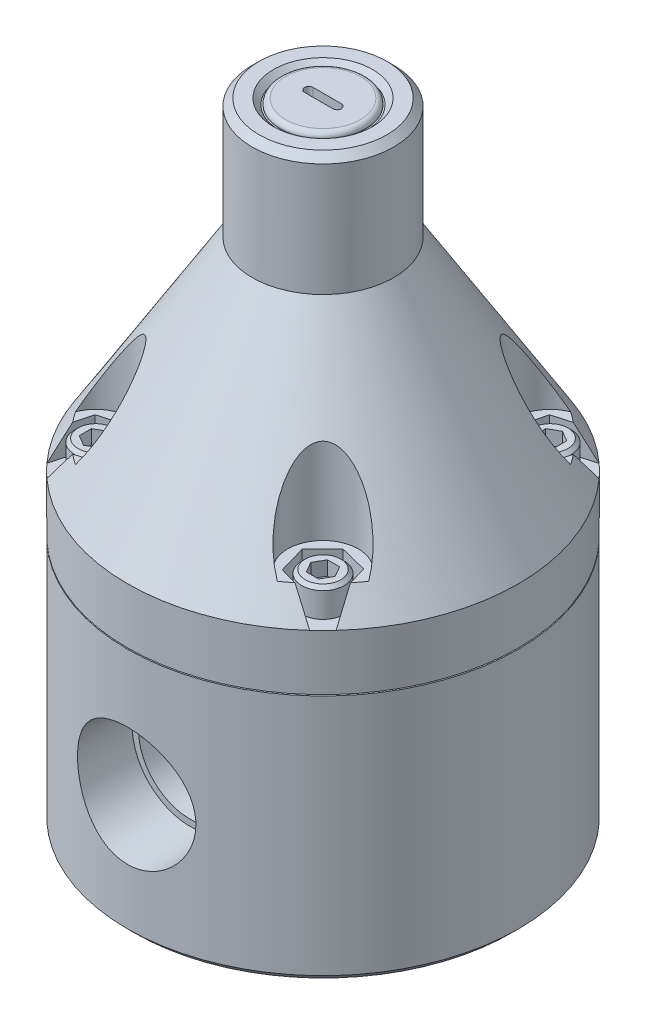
ISO-10303-21;
HEADER;
FILE_DESCRIPTION(('STEP AP214'),'2;1');
FILE_NAME('part.step','',(''),(''),'','','');
FILE_SCHEMA(('AUTOMOTIVE_DESIGN { 1 0 10303 214 1 1 1 1 }'));
ENDSEC;
DATA;
#1=APPLICATION_CONTEXT('core data for automotive mechanical design processes');
#2=APPLICATION_PROTOCOL_DEFINITION('international standard','automotive_design',2000,#1);
#3=PRODUCT_CONTEXT('',#1,'mechanical');
#4=PRODUCT('Part','Part','',(#3));
#5=PRODUCT_RELATED_PRODUCT_CATEGORY('part','',(#4));
#6=PRODUCT_DEFINITION_FORMATION('','',#4);
#7=PRODUCT_DEFINITION_CONTEXT('part definition',#1,'design');
#8=PRODUCT_DEFINITION('design','',#6,#7);
#9=PRODUCT_DEFINITION_SHAPE('','',#8);
#10=(LENGTH_UNIT() NAMED_UNIT(*) SI_UNIT(.MILLI.,.METRE.));
#11=(NAMED_UNIT(*) PLANE_ANGLE_UNIT() SI_UNIT($,.RADIAN.));
#12=(NAMED_UNIT(*) SI_UNIT($,.STERADIAN.) SOLID_ANGLE_UNIT());
#13=UNCERTAINTY_MEASURE_WITH_UNIT(LENGTH_MEASURE(1.E-05),#10,'distance_accuracy_value','');
#14=(GEOMETRIC_REPRESENTATION_CONTEXT(3) GLOBAL_UNCERTAINTY_ASSIGNED_CONTEXT((#13)) GLOBAL_UNIT_ASSIGNED_CONTEXT((#10,
#11,#12)) REPRESENTATION_CONTEXT('',''));
#15=CARTESIAN_POINT('',(0.,0.,0.));
#16=DIRECTION('',(0.,0.,1.));
#17=DIRECTION('',(1.,0.,0.));
#18=AXIS2_PLACEMENT_3D('',#15,#16,#17);
#19=CARTESIAN_POINT('',(0.,68.58,0.));
#20=DIRECTION('',(0.,-1.,0.));
#21=DIRECTION('',(0.,0.,-1.));
#22=AXIS2_PLACEMENT_3D('',#19,#20,#21);
#23=CONICAL_SURFACE('',#22,43.815,0.551031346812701);
#24=CARTESIAN_POINT('',(31.1854504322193,74.9302,-24.909570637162));
#25=CARTESIAN_POINT('',(31.2917993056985,74.4052604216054,-25.2932994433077));
#26=CARTESIAN_POINT('',(31.3977224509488,73.8791142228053,-25.6754921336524));
#27=CARTESIAN_POINT('',(31.6087824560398,72.8246364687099,-26.4370404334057));
#28=CARTESIAN_POINT('',(31.713919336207,72.2963049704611,-26.8163961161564));
#29=CARTESIAN_POINT('',(31.9234771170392,71.2376591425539,-27.5725240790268));
#30=CARTESIAN_POINT('',(32.0278980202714,70.7073448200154,-27.9492963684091));
#31=CARTESIAN_POINT('',(32.2360838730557,69.6448927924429,-28.7004741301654));
#32=CARTESIAN_POINT('',(32.3398488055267,69.1127550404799,-29.0748795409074));
#33=CARTESIAN_POINT('',(32.443312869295,68.5798,-29.4481993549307));
#34=B_SPLINE_CURVE_WITH_KNOTS('',3,(#24,#25,#26,#27,#28,#29,#30,#31,#32,#33),.UNSPECIFIED.,.F.,
.F.,(4,2,2,2,4),(0.,1.97662629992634,3.95320132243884,5.9297692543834,7.90638844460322),.UNSPECIFIED.);
#35=CARTESIAN_POINT('',(31.1854909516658,74.93,-24.9097168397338));
#36=VERTEX_POINT('',#35);
#37=CARTESIAN_POINT('',(32.4432740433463,68.58,-29.4480592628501));
#38=VERTEX_POINT('',#37);
#39=EDGE_CURVE('E761',#36,#38,#34,.T.);
#40=ORIENTED_EDGE('',*,*,#39,.F.);
#41=CARTESIAN_POINT('',(0.,74.93,0.));
#42=DIRECTION('',(0.,1.,0.));
#43=DIRECTION('',(0.,0.,1.));
#44=AXIS2_PLACEMENT_3D('',#41,#42,#43);
#45=CIRCLE('',#44,39.9127653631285);
#46=CARTESIAN_POINT('',(32.8759602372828,74.93,-22.6318376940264));
#47=VERTEX_POINT('',#46);
#48=EDGE_CURVE('E1564',#36,#47,#45,.F.);
#49=ORIENTED_EDGE('',*,*,#48,.T.);
#50=CARTESIAN_POINT('',(32.8760134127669,74.9298,-22.6319772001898));
#51=CARTESIAN_POINT('',(32.8078201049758,75.1861952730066,-22.4531520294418));
#52=CARTESIAN_POINT('',(32.7341907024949,75.4445704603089,-22.2793275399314));
#53=CARTESIAN_POINT('',(32.5770087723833,75.9645959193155,-21.9414911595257));
#54=CARTESIAN_POINT('',(32.4934589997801,76.2262452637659,-21.7774765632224));
#55=CARTESIAN_POINT('',(32.3174500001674,76.7519681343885,-21.4591594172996));
#56=CARTESIAN_POINT('',(32.2250013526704,77.0160384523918,-21.3048456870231));
#57=CARTESIAN_POINT('',(32.0318436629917,77.5464258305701,-21.0055220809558));
#58=CARTESIAN_POINT('',(31.9311339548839,77.8127430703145,-20.8605129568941));
#59=CARTESIAN_POINT('',(31.6173532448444,78.6150033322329,-20.4388792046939));
#60=CARTESIAN_POINT('',(31.3928032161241,79.1537454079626,-20.1759549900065));
#61=CARTESIAN_POINT('',(30.9170512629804,80.2357477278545,-19.6857657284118));
#62=CARTESIAN_POINT('',(30.6658395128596,80.7790095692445,-19.458513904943));
#63=CARTESIAN_POINT('',(30.118158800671,81.9115352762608,-19.022517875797));
#64=CARTESIAN_POINT('',(29.8196739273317,82.5009764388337,-18.8167433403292));
#65=CARTESIAN_POINT('',(29.3524342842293,83.3846139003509,-18.5396319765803));
#66=CARTESIAN_POINT('',(29.1934054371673,83.6791250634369,-18.452507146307));
#67=CARTESIAN_POINT('',(28.8689346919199,84.2675878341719,-18.2889878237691));
#68=CARTESIAN_POINT('',(28.7034932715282,84.5615394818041,-18.2125925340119));
#69=CARTESIAN_POINT('',(28.3660149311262,85.1488284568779,-18.0707333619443));
#70=CARTESIAN_POINT('',(28.1939696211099,85.442164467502,-18.0052839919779));
#71=CARTESIAN_POINT('',(27.8434345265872,86.0273145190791,-17.885863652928));
#72=CARTESIAN_POINT('',(27.6649449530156,86.3191286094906,-17.8318923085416));
#73=CARTESIAN_POINT('',(27.3014619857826,86.9004622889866,-17.7360312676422));
#74=CARTESIAN_POINT('',(27.1164723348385,87.1899830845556,-17.6941347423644));
#75=CARTESIAN_POINT('',(26.7396312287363,87.7661102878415,-17.6231649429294));
#76=CARTESIAN_POINT('',(26.5477800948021,88.0527168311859,-17.5940910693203));
#77=CARTESIAN_POINT('',(26.1388486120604,88.6481794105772,-17.5477736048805));
#78=CARTESIAN_POINT('',(25.9210687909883,88.9566632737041,-17.531860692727));
#79=CARTESIAN_POINT('',(25.4761618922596,89.5671217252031,-17.5184250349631));
#80=CARTESIAN_POINT('',(25.2490377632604,89.8690983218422,-17.5208965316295));
#81=CARTESIAN_POINT('',(24.7853264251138,90.462861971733,-17.546770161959));
#82=CARTESIAN_POINT('',(24.5487844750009,90.7546875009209,-17.5700815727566));
#83=CARTESIAN_POINT('',(24.1854004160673,91.182662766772,-17.6234209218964));
#84=CARTESIAN_POINT('',(24.0628808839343,91.3236542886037,-17.6442539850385));
#85=CARTESIAN_POINT('',(23.8147710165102,91.6017141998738,-17.6926688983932));
#86=CARTESIAN_POINT('',(23.6891808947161,91.7387828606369,-17.7202502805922));
#87=CARTESIAN_POINT('',(23.3476505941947,92.1003741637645,-17.8043004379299));
#88=CARTESIAN_POINT('',(23.1286985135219,92.320550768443,-17.8676208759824));
#89=CARTESIAN_POINT('',(22.6802930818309,92.7420139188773,-18.0200246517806));
#90=CARTESIAN_POINT('',(22.450819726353,92.9432620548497,-18.1091589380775));
#91=CARTESIAN_POINT('',(22.0978320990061,93.2244666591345,-18.2671443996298));
#92=CARTESIAN_POINT('',(21.9777912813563,93.315346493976,-18.3243659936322));
#93=CARTESIAN_POINT('',(21.7355133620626,93.4877899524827,-18.4477596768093));
#94=CARTESIAN_POINT('',(21.6132758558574,93.5693518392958,-18.5139334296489));
#95=CARTESIAN_POINT('',(21.3676920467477,93.7206957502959,-18.6557254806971));
#96=CARTESIAN_POINT('',(21.2443516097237,93.7905207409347,-18.7313074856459));
#97=CARTESIAN_POINT('',(20.997270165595,93.9162293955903,-18.8925662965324));
#98=CARTESIAN_POINT('',(20.8735295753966,93.9721245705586,-18.9782346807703));
#99=CARTESIAN_POINT('',(20.596353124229,94.0793061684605,-19.1825009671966));
#100=CARTESIAN_POINT('',(20.4431915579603,94.1259831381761,-19.303987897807));
#101=CARTESIAN_POINT('',(20.1429486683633,94.1891665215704,-19.561379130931));
#102=CARTESIAN_POINT('',(19.995862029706,94.2056998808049,-19.6972704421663));
#103=CARTESIAN_POINT('',(19.7121854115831,94.2068511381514,-19.9801670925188));
#104=CARTESIAN_POINT('',(19.5756118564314,94.1914201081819,-20.1271891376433));
#105=CARTESIAN_POINT('',(19.3168358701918,94.130256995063,-20.4274436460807));
#106=CARTESIAN_POINT('',(19.1946462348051,94.0844981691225,-20.5806814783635));
#107=CARTESIAN_POINT('',(18.9333227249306,93.9499537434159,-20.9335168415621));
#108=CARTESIAN_POINT('',(18.7994959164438,93.8525556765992,-21.1337148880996));
#109=CARTESIAN_POINT('',(18.5575341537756,93.6253225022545,-21.5311982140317));
#110=CARTESIAN_POINT('',(18.4494578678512,93.4954146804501,-21.7284758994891));
#111=CARTESIAN_POINT('',(18.2734255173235,93.2378861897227,-22.0822323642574));
#112=CARTESIAN_POINT('',(18.2017503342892,93.114033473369,-22.2396830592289));
#113=CARTESIAN_POINT('',(18.0717731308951,92.8543658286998,-22.5502860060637));
#114=CARTESIAN_POINT('',(18.0134803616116,92.7185427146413,-22.7034352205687));
#115=CARTESIAN_POINT('',(17.9085459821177,92.4375711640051,-23.0055063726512));
#116=CARTESIAN_POINT('',(17.8619238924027,92.2924076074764,-23.1544208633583));
#117=CARTESIAN_POINT('',(17.7789950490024,91.9949331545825,-23.4479825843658));
#118=CARTESIAN_POINT('',(17.7426923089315,91.842619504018,-23.5926281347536));
#119=CARTESIAN_POINT('',(17.6793668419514,91.5330276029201,-23.877261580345));
#120=CARTESIAN_POINT('',(17.6523073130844,91.3757718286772,-24.0172658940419));
#121=CARTESIAN_POINT('',(17.6063247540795,91.0568516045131,-24.2934532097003));
#122=CARTESIAN_POINT('',(17.5874006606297,90.8951877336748,-24.4296367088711));
#123=CARTESIAN_POINT('',(17.5416007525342,90.4045581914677,-24.8331155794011));
#124=CARTESIAN_POINT('',(17.5257415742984,90.0701857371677,-25.0951300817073));
#125=CARTESIAN_POINT('',(17.5187750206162,89.3910127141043,-25.6073018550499));
#126=CARTESIAN_POINT('',(17.5277362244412,89.0461858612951,-25.8574243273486));
#127=CARTESIAN_POINT('',(17.5674604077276,88.3499543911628,-26.346266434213));
#128=CARTESIAN_POINT('',(17.5982177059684,87.9985515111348,-26.5849890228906));
#129=CARTESIAN_POINT('',(17.6752315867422,87.3273950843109,-27.0279886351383));
#130=CARTESIAN_POINT('',(17.7195760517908,87.0080899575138,-27.2332880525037));
#131=CARTESIAN_POINT('',(17.8230232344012,86.366765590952,-27.6358491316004));
#132=CARTESIAN_POINT('',(17.8821279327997,86.0447459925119,-27.8331097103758));
#133=CARTESIAN_POINT('',(18.0143479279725,85.3986613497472,-28.2199078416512));
#134=CARTESIAN_POINT('',(18.0874725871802,85.0745950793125,-28.4094401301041));
#135=CARTESIAN_POINT('',(18.247146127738,84.4253288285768,-28.7807004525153));
#136=CARTESIAN_POINT('',(18.3336943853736,84.100128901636,-28.9624288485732));
#137=CARTESIAN_POINT('',(18.5196821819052,83.4497138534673,-29.3177238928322));
#138=CARTESIAN_POINT('',(18.6190998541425,83.1244996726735,-29.4913037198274));
#139=CARTESIAN_POINT('',(18.8307065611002,82.4740292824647,-29.830436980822));
#140=CARTESIAN_POINT('',(18.9428959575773,82.1487730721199,-29.9959901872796));
#141=CARTESIAN_POINT('',(19.1798765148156,81.4988617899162,-30.3186806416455));
#142=CARTESIAN_POINT('',(19.3046623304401,81.1742065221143,-30.4758214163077));
#143=CARTESIAN_POINT('',(19.566846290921,80.5258852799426,-30.7813029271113));
#144=CARTESIAN_POINT('',(19.7042435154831,80.2022192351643,-30.929644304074));
#145=CARTESIAN_POINT('',(20.0356080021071,79.4577845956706,-31.2608218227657));
#146=CARTESIAN_POINT('',(20.2340425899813,79.0375277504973,-31.4403688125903));
#147=CARTESIAN_POINT('',(20.6528330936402,78.2009180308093,-31.7817933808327));
#148=CARTESIAN_POINT('',(20.8731810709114,77.7845638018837,-31.943677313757));
#149=CARTESIAN_POINT('',(21.2204706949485,77.1642648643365,-32.1715277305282));
#150=CARTESIAN_POINT('',(21.3389735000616,76.9582923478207,-32.244953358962));
#151=CARTESIAN_POINT('',(21.5816967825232,76.5479021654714,-32.3865049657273));
#152=CARTESIAN_POINT('',(21.7059169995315,76.3434844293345,-32.454631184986));
#153=CARTESIAN_POINT('',(21.9602864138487,75.936277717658,-32.5852592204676));
#154=CARTESIAN_POINT('',(22.0904406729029,75.7334903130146,-32.647756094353));
#155=CARTESIAN_POINT('',(22.3567119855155,75.3299985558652,-32.7666088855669));
#156=CARTESIAN_POINT('',(22.4928299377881,75.1292945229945,-32.8229638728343));
#157=CARTESIAN_POINT('',(22.6319772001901,74.9298,-32.8760134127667));
#158=B_SPLINE_CURVE_WITH_KNOTS('',3,(#50,#51,#52,#53,#54,#55,#56,#57,#58,#59,#60,#61,#62,#63,
#64,#65,#66,#67,#68,#69,#70,#71,#72,#73,#74,#75,#76,#77,#78,#79,#80,#81,#82,#83,#84,#85,#86,#87,
#88,#89,#90,#91,#92,#93,#94,#95,#96,#97,#98,#99,#100,#101,#102,#103,#104,#105,#106,#107,#108,
#109,#110,#111,#112,#113,#114,#115,#116,#117,#118,#119,#120,#121,#122,#123,#124,#125,#126,#127,
#128,#129,#130,#131,#132,#133,#134,#135,#136,#137,#138,#139,#140,#141,#142,#143,#144,#145,#146,
#147,#148,#149,#150,#151,#152,#153,#154,#155,#156,#157),.UNSPECIFIED.,.F.,.F.,(4,2,2,2,2,2,2,2,
2,2,2,2,2,2,2,2,2,2,2,2,2,2,2,2,2,2,2,2,2,2,2,2,2,2,2,2,2,2,2,2,2,2,2,2,2,2,2,2,2,2,2,2,2,4),
(0.,0.959681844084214,1.9190977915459,2.87738689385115,3.83575332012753,5.75433905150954,
7.67363431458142,9.74768208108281,10.7850777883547,11.8223963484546,12.8610794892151,
13.8997286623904,14.9377892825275,15.9758013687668,17.1090815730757,18.2420068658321,
19.3700240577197,19.9337037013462,20.4973442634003,21.4467185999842,22.3979796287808,
22.8807596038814,23.363629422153,23.8446911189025,24.3253539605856,24.9256472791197,
25.5254037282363,26.1260789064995,26.7272844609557,27.5022221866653,28.2789089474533,
28.9163059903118,29.5541423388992,30.193038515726,30.8321828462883,31.4687519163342,
32.1052377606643,33.3791509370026,34.6565874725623,35.9336911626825,37.0798743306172,
38.2262114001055,39.3733166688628,40.520368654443,41.665496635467,42.8106570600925,
43.9553335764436,45.0999266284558,46.5938371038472,48.0872083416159,48.8332472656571,
49.5792522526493,50.325905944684,51.0726725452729),.UNSPECIFIED.);
#159=CARTESIAN_POINT('',(22.6318376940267,74.93,-32.8759602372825));
#160=VERTEX_POINT('',#159);
#161=EDGE_CURVE('E912',#47,#160,#158,.T.);
#162=ORIENTED_EDGE('',*,*,#161,.T.);
#163=CARTESIAN_POINT('',(24.9752922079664,74.93,-31.1329988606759));
#164=VERTEX_POINT('',#163);
#165=EDGE_CURVE('E920',#160,#164,#45,.F.);
#166=ORIENTED_EDGE('',*,*,#165,.T.);
#167=CARTESIAN_POINT('',(29.4766640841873,68.5798,-32.4174531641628));
#168=CARTESIAN_POINT('',(29.1062316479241,69.1125841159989,-32.3117512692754));
#169=CARTESIAN_POINT('',(28.7347583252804,69.6445870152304,-32.2057523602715));
#170=CARTESIAN_POINT('',(27.9895431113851,70.7068520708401,-31.9931072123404));
#171=CARTESIAN_POINT('',(27.6158012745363,71.2371142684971,-31.8864609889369));
#172=CARTESIAN_POINT('',(26.8658433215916,72.2957468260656,-31.6724625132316));
#173=CARTESIAN_POINT('',(26.4896271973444,72.8241171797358,-31.5651102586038));
#174=CARTESIAN_POINT('',(25.7344797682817,73.8787747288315,-31.3496309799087));
#175=CARTESIAN_POINT('',(25.3555483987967,74.4050618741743,-31.2415039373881));
#176=CARTESIAN_POINT('',(24.9751473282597,74.9302,-31.132957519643));
#177=B_SPLINE_CURVE_WITH_KNOTS('',3,(#167,#168,#169,#170,#171,#172,#173,#174,#175,#176),
.UNSPECIFIED.,.F.,.F.,(4,2,2,2,4),(0.,1.97237650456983,3.9447058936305,5.91704178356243,
7.88942480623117),.UNSPECIFIED.);
#178=CARTESIAN_POINT('',(29.4765250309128,68.58,-32.4174134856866));
#179=VERTEX_POINT('',#178);
#180=EDGE_CURVE('E744',#179,#164,#177,.T.);
#181=ORIENTED_EDGE('',*,*,#180,.F.);
#182=CARTESIAN_POINT('',(0.,68.58,0.));
#183=DIRECTION('',(0.,-1.,0.));
#184=DIRECTION('',(0.,0.,-1.));
#185=AXIS2_PLACEMENT_3D('',#182,#183,#184);
#186=CIRCLE('',#185,43.815);
#187=CARTESIAN_POINT('',(-29.4480592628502,68.58,-32.4432740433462));
#188=VERTEX_POINT('',#187);
#189=EDGE_CURVE('E1328',#188,#179,#186,.T.);
#190=ORIENTED_EDGE('',*,*,#189,.F.);
#191=CARTESIAN_POINT('',(-24.9095706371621,74.9302,-31.1854504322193));
#192=CARTESIAN_POINT('',(-25.2932994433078,74.4052604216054,-31.2917993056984));
#193=CARTESIAN_POINT('',(-25.6754921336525,73.8791142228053,-31.3977224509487));
#194=CARTESIAN_POINT('',(-26.4370404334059,72.8246364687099,-31.6087824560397));
#195=CARTESIAN_POINT('',(-26.8163961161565,72.2963049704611,-31.7139193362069));
#196=CARTESIAN_POINT('',(-27.5725240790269,71.2376591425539,-31.9234771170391));
#197=CARTESIAN_POINT('',(-27.9492963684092,70.7073448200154,-32.0278980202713));
#198=CARTESIAN_POINT('',(-28.7004741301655,69.6448927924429,-32.2360838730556));
#199=CARTESIAN_POINT('',(-29.0748795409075,69.1127550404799,-32.3398488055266));
#200=CARTESIAN_POINT('',(-29.4481993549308,68.5798,-32.4433128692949));
#201=B_SPLINE_CURVE_WITH_KNOTS('',3,(#191,#192,#193,#194,#195,#196,#197,#198,#199,#200),
.UNSPECIFIED.,.F.,.F.,(4,2,2,2,4),(0.,1.97662629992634,3.95320132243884,5.9297692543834,
7.90638844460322),.UNSPECIFIED.);
#202=CARTESIAN_POINT('',(-24.9097168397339,74.93,-31.1854909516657));
#203=VERTEX_POINT('',#202);
#204=EDGE_CURVE('E818',#203,#188,#201,.T.);
#205=ORIENTED_EDGE('',*,*,#204,.F.);
#206=CARTESIAN_POINT('',(0.,74.93,0.));
#207=DIRECTION('',(0.,1.,0.));
#208=DIRECTION('',(0.,0.,1.));
#209=AXIS2_PLACEMENT_3D('',#206,#207,#208);
#210=CIRCLE('',#209,39.9127653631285);
#211=CARTESIAN_POINT('',(-22.6318376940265,74.93,-32.8759602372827));
#212=VERTEX_POINT('',#211);
#213=EDGE_CURVE('E1626',#203,#212,#210,.F.);
#214=ORIENTED_EDGE('',*,*,#213,.T.);
#215=CARTESIAN_POINT('',(-22.6319772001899,74.9298,-32.8760134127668));
#216=CARTESIAN_POINT('',(-22.4531520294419,75.1861952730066,-32.8078201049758));
#217=CARTESIAN_POINT('',(-22.2793275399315,75.4445704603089,-32.7341907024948));
#218=CARTESIAN_POINT('',(-21.9414911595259,75.9645959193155,-32.5770087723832));
#219=CARTESIAN_POINT('',(-21.7774765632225,76.2262452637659,-32.49345899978));
#220=CARTESIAN_POINT('',(-21.4591594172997,76.7519681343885,-32.3174500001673));
#221=CARTESIAN_POINT('',(-21.3048456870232,77.0160384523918,-32.2250013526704));
#222=CARTESIAN_POINT('',(-21.0055220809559,77.5464258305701,-32.0318436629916));
#223=CARTESIAN_POINT('',(-20.8605129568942,77.8127430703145,-31.9311339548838));
#224=CARTESIAN_POINT('',(-20.438879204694,78.6150033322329,-31.6173532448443));
#225=CARTESIAN_POINT('',(-20.1759549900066,79.1537454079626,-31.392803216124));
#226=CARTESIAN_POINT('',(-19.6857657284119,80.2357477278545,-30.9170512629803));
#227=CARTESIAN_POINT('',(-19.4585139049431,80.7790095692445,-30.6658395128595));
#228=CARTESIAN_POINT('',(-19.0225178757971,81.9115352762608,-30.1181588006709));
#229=CARTESIAN_POINT('',(-18.8167433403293,82.5009764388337,-29.8196739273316));
#230=CARTESIAN_POINT('',(-18.5396319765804,83.3846139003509,-29.3524342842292));
#231=CARTESIAN_POINT('',(-18.4525071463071,83.6791250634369,-29.1934054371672));
#232=CARTESIAN_POINT('',(-18.2889878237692,84.2675878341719,-28.8689346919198));
#233=CARTESIAN_POINT('',(-18.212592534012,84.5615394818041,-28.7034932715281));
#234=CARTESIAN_POINT('',(-18.0707333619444,85.148828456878,-28.3660149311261));
#235=CARTESIAN_POINT('',(-18.005283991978,85.4421644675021,-28.1939696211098));
#236=CARTESIAN_POINT('',(-17.8858636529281,86.0273145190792,-27.8434345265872));
#237=CARTESIAN_POINT('',(-17.8318923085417,86.3191286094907,-27.6649449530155));
#238=CARTESIAN_POINT('',(-17.7360312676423,86.9004622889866,-27.3014619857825));
#239=CARTESIAN_POINT('',(-17.6941347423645,87.1899830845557,-27.1164723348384));
#240=CARTESIAN_POINT('',(-17.6231649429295,87.7661102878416,-26.7396312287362));
#241=CARTESIAN_POINT('',(-17.5940910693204,88.052716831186,-26.547780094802));
#242=CARTESIAN_POINT('',(-17.5477736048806,88.6481794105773,-26.1388486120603));
#243=CARTESIAN_POINT('',(-17.5318606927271,88.9566632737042,-25.9210687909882));
#244=CARTESIAN_POINT('',(-17.5184250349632,89.5671217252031,-25.4761618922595));
#245=CARTESIAN_POINT('',(-17.5208965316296,89.8690983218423,-25.2490377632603));
#246=CARTESIAN_POINT('',(-17.5467701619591,90.462861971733,-24.7853264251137));
#247=CARTESIAN_POINT('',(-17.5700815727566,90.754687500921,-24.5487844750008));
#248=CARTESIAN_POINT('',(-17.6234209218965,91.1826627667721,-24.1854004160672));
#249=CARTESIAN_POINT('',(-17.6442539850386,91.3236542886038,-24.0628808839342));
#250=CARTESIAN_POINT('',(-17.6926688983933,91.6017141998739,-23.8147710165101));
#251=CARTESIAN_POINT('',(-17.7202502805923,91.7387828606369,-23.6891808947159));
#252=CARTESIAN_POINT('',(-17.80430043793,92.1003741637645,-23.3476505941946));
#253=CARTESIAN_POINT('',(-17.8676208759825,92.320550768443,-23.1286985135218));
#254=CARTESIAN_POINT('',(-18.0200246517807,92.7420139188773,-22.6802930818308));
#255=CARTESIAN_POINT('',(-18.1091589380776,92.9432620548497,-22.4508197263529));
#256=CARTESIAN_POINT('',(-18.2671443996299,93.2244666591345,-22.097832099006));
#257=CARTESIAN_POINT('',(-18.3243659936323,93.3153464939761,-21.9777912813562));
#258=CARTESIAN_POINT('',(-18.4477596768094,93.4877899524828,-21.7355133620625));
#259=CARTESIAN_POINT('',(-18.513933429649,93.5693518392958,-21.6132758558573));
#260=CARTESIAN_POINT('',(-18.6557254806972,93.7206957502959,-21.3676920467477));
#261=CARTESIAN_POINT('',(-18.731307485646,93.7905207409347,-21.2443516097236));
#262=CARTESIAN_POINT('',(-18.8925662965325,93.9162293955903,-20.9972701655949));
#263=CARTESIAN_POINT('',(-18.9782346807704,93.9721245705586,-20.8735295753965));
#264=CARTESIAN_POINT('',(-19.1825009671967,94.0793061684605,-20.5963531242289));
#265=CARTESIAN_POINT('',(-19.3039878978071,94.1259831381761,-20.4431915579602));
#266=CARTESIAN_POINT('',(-19.5613791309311,94.1891665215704,-20.1429486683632));
#267=CARTESIAN_POINT('',(-19.6972704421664,94.2056998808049,-19.9958620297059));
#268=CARTESIAN_POINT('',(-19.9801670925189,94.2068511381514,-19.7121854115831));
#269=CARTESIAN_POINT('',(-20.1271891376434,94.1914201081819,-19.5756118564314));
#270=CARTESIAN_POINT('',(-20.4274436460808,94.130256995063,-19.3168358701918));
#271=CARTESIAN_POINT('',(-20.5806814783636,94.0844981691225,-19.194646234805));
#272=CARTESIAN_POINT('',(-20.9335168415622,93.9499537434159,-18.9333227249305));
#273=CARTESIAN_POINT('',(-21.1337148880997,93.8525556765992,-18.7994959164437));
#274=CARTESIAN_POINT('',(-21.5311982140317,93.6253225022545,-18.5575341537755));
#275=CARTESIAN_POINT('',(-21.7284758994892,93.4954146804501,-18.4494578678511));
#276=CARTESIAN_POINT('',(-22.0822323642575,93.2378861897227,-18.2734255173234));
#277=CARTESIAN_POINT('',(-22.239683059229,93.114033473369,-18.2017503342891));
#278=CARTESIAN_POINT('',(-22.5502860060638,92.8543658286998,-18.071773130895));
#279=CARTESIAN_POINT('',(-22.7034352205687,92.7185427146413,-18.0134803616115));
#280=CARTESIAN_POINT('',(-23.0055063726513,92.437571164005,-17.9085459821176));
#281=CARTESIAN_POINT('',(-23.1544208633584,92.2924076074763,-17.8619238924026));
#282=CARTESIAN_POINT('',(-23.4479825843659,91.9949331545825,-17.7789950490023));
#283=CARTESIAN_POINT('',(-23.5926281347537,91.842619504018,-17.7426923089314));
#284=CARTESIAN_POINT('',(-23.8772615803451,91.5330276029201,-17.6793668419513));
#285=CARTESIAN_POINT('',(-24.017265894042,91.3757718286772,-17.6523073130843));
#286=CARTESIAN_POINT('',(-24.2934532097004,91.0568516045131,-17.6063247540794));
#287=CARTESIAN_POINT('',(-24.4296367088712,90.8951877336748,-17.5874006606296));
#288=CARTESIAN_POINT('',(-24.8331155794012,90.4045581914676,-17.5416007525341));
#289=CARTESIAN_POINT('',(-25.0951300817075,90.0701857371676,-17.5257415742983));
#290=CARTESIAN_POINT('',(-25.60730185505,89.3910127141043,-17.5187750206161));
#291=CARTESIAN_POINT('',(-25.8574243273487,89.046185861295,-17.5277362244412));
#292=CARTESIAN_POINT('',(-26.3462664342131,88.3499543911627,-17.5674604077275));
#293=CARTESIAN_POINT('',(-26.5849890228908,87.9985515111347,-17.5982177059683));
#294=CARTESIAN_POINT('',(-27.0279886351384,87.3273950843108,-17.6752315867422));
#295=CARTESIAN_POINT('',(-27.2332880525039,87.0080899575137,-17.7195760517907));
#296=CARTESIAN_POINT('',(-27.6358491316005,86.366765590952,-17.8230232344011));
#297=CARTESIAN_POINT('',(-27.8331097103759,86.0447459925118,-17.8821279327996));
#298=CARTESIAN_POINT('',(-28.2199078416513,85.3986613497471,-18.0143479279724));
#299=CARTESIAN_POINT('',(-28.4094401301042,85.0745950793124,-18.0874725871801));
#300=CARTESIAN_POINT('',(-28.7807004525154,84.4253288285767,-18.2471461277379));
#301=CARTESIAN_POINT('',(-28.9624288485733,84.1001289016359,-18.3336943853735));
#302=CARTESIAN_POINT('',(-29.3177238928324,83.4497138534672,-18.5196821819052));
#303=CARTESIAN_POINT('',(-29.4913037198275,83.1244996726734,-18.6190998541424));
#304=CARTESIAN_POINT('',(-29.8304369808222,82.4740292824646,-18.8307065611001));
#305=CARTESIAN_POINT('',(-29.9959901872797,82.1487730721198,-18.9428959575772));
#306=CARTESIAN_POINT('',(-30.3186806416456,81.498861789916,-19.1798765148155));
#307=CARTESIAN_POINT('',(-30.4758214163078,81.1742065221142,-19.3046623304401));
#308=CARTESIAN_POINT('',(-30.7813029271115,80.5258852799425,-19.5668462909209));
#309=CARTESIAN_POINT('',(-30.9296443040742,80.2022192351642,-19.7042435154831));
#310=CARTESIAN_POINT('',(-31.2608218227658,79.4577845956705,-20.0356080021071));
#311=CARTESIAN_POINT('',(-31.4403688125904,79.0375277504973,-20.2340425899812));
#312=CARTESIAN_POINT('',(-31.7817933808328,78.2009180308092,-20.6528330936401));
#313=CARTESIAN_POINT('',(-31.9436773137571,77.7845638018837,-20.8731810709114));
#314=CARTESIAN_POINT('',(-32.1715277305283,77.1642648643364,-21.2204706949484));
#315=CARTESIAN_POINT('',(-32.2449533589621,76.9582923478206,-21.3389735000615));
#316=CARTESIAN_POINT('',(-32.3865049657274,76.5479021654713,-21.5816967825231));
#317=CARTESIAN_POINT('',(-32.4546311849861,76.3434844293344,-21.7059169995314));
#318=CARTESIAN_POINT('',(-32.5852592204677,75.9362777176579,-21.9602864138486));
#319=CARTESIAN_POINT('',(-32.6477560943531,75.7334903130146,-22.0904406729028));
#320=CARTESIAN_POINT('',(-32.766608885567,75.3299985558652,-22.3567119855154));
#321=CARTESIAN_POINT('',(-32.8229638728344,75.1292945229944,-22.492829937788));
#322=CARTESIAN_POINT('',(-32.8760134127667,74.9298,-22.63197720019));
#323=B_SPLINE_CURVE_WITH_KNOTS('',3,(#215,#216,#217,#218,#219,#220,#221,#222,#223,#224,#225,
#226,#227,#228,#229,#230,#231,#232,#233,#234,#235,#236,#237,#238,#239,#240,#241,#242,#243,#244,
#245,#246,#247,#248,#249,#250,#251,#252,#253,#254,#255,#256,#257,#258,#259,#260,#261,#262,#263,
#264,#265,#266,#267,#268,#269,#270,#271,#272,#273,#274,#275,#276,#277,#278,#279,#280,#281,#282,
#283,#284,#285,#286,#287,#288,#289,#290,#291,#292,#293,#294,#295,#296,#297,#298,#299,#300,#301,
#302,#303,#304,#305,#306,#307,#308,#309,#310,#311,#312,#313,#314,#315,#316,#317,#318,#319,#320,
#321,#322),.UNSPECIFIED.,.F.,.F.,(4,2,2,2,2,2,2,2,2,2,2,2,2,2,2,2,2,2,2,2,2,2,2,2,2,2,2,2,2,2,2,
2,2,2,2,2,2,2,2,2,2,2,2,2,2,2,2,2,2,2,2,2,2,4),(0.,0.959681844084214,1.9190977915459,
2.87738689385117,3.83575332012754,5.75433905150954,7.67363431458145,9.74768208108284,
10.7850777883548,11.8223963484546,12.8610794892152,13.8997286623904,14.9377892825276,
15.9758013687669,17.1090815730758,18.2420068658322,19.3700240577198,19.9337037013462,
20.4973442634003,21.4467185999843,22.3979796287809,22.8807596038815,23.3636294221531,
23.8446911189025,24.3253539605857,24.9256472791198,25.5254037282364,26.1260789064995,
26.7272844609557,27.5022221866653,28.2789089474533,28.9163059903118,29.5541423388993,
30.193038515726,30.8321828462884,31.4687519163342,32.1052377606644,33.3791509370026,
34.6565874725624,35.9336911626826,37.0798743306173,38.2262114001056,39.373316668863,
40.5203686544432,41.6654966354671,42.8106570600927,43.9553335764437,45.0999266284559,
46.5938371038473,48.0872083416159,48.8332472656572,49.5792522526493,50.3259059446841,
51.0726725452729),.UNSPECIFIED.);
#324=CARTESIAN_POINT('',(-32.8759602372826,74.93,-22.6318376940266));
#325=VERTEX_POINT('',#324);
#326=EDGE_CURVE('E1565',#212,#325,#323,.T.);
#327=ORIENTED_EDGE('',*,*,#326,.T.);
#328=CARTESIAN_POINT('',(-31.132998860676,74.93,-24.9752922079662));
#329=VERTEX_POINT('',#328);
#330=EDGE_CURVE('E1378',#325,#329,#210,.F.);
#331=ORIENTED_EDGE('',*,*,#330,.T.);
#332=CARTESIAN_POINT('',(-32.4174531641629,68.5798,-29.4766640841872));
#333=CARTESIAN_POINT('',(-32.3117512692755,69.1125841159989,-29.106231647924));
#334=CARTESIAN_POINT('',(-32.2057523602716,69.6445870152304,-28.7347583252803));
#335=CARTESIAN_POINT('',(-31.9931072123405,70.7068520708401,-27.989543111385));
#336=CARTESIAN_POINT('',(-31.886460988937,71.2371142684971,-27.6158012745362));
#337=CARTESIAN_POINT('',(-31.6724625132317,72.2957468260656,-26.8658433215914));
#338=CARTESIAN_POINT('',(-31.5651102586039,72.8241171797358,-26.4896271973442));
#339=CARTESIAN_POINT('',(-31.3496309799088,73.8787747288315,-25.7344797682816));
#340=CARTESIAN_POINT('',(-31.2415039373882,74.4050618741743,-25.3555483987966));
#341=CARTESIAN_POINT('',(-31.1329575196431,74.9302,-24.9751473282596));
#342=B_SPLINE_CURVE_WITH_KNOTS('',3,(#332,#333,#334,#335,#336,#337,#338,#339,#340,#341),
.UNSPECIFIED.,.F.,.F.,(4,2,2,2,4),(0.,1.9723765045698,3.94470589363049,5.91704178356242,
7.88942480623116),.UNSPECIFIED.);
#343=CARTESIAN_POINT('',(-32.4174134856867,68.58,-29.4765250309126));
#344=VERTEX_POINT('',#343);
#345=EDGE_CURVE('E811',#344,#329,#342,.T.);
#346=ORIENTED_EDGE('',*,*,#345,.F.);
#347=CARTESIAN_POINT('',(-32.4432740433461,68.58,29.4480592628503));
#348=VERTEX_POINT('',#347);
#349=EDGE_CURVE('E1335',#348,#344,#186,.T.);
#350=ORIENTED_EDGE('',*,*,#349,.F.);
#351=CARTESIAN_POINT('',(-31.1854504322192,74.9302,24.9095706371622));
#352=CARTESIAN_POINT('',(-31.2917993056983,74.4052604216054,25.2932994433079));
#353=CARTESIAN_POINT('',(-31.3977224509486,73.8791142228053,25.6754921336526));
#354=CARTESIAN_POINT('',(-31.6087824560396,72.8246364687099,26.437040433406));
#355=CARTESIAN_POINT('',(-31.7139193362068,72.2963049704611,26.8163961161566));
#356=CARTESIAN_POINT('',(-31.9234771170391,71.2376591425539,27.572524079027));
#357=CARTESIAN_POINT('',(-32.0278980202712,70.7073448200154,27.9492963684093));
#358=CARTESIAN_POINT('',(-32.2360838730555,69.6448927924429,28.7004741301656));
#359=CARTESIAN_POINT('',(-32.3398488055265,69.1127550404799,29.0748795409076));
#360=CARTESIAN_POINT('',(-32.4433128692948,68.5798,29.4481993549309));
#361=B_SPLINE_CURVE_WITH_KNOTS('',3,(#351,#352,#353,#354,#355,#356,#357,#358,#359,#360),
.UNSPECIFIED.,.F.,.F.,(4,2,2,2,4),(0.,1.97662629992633,3.95320132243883,5.9297692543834,
7.90638844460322),.UNSPECIFIED.);
#362=CARTESIAN_POINT('',(-31.1854909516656,74.93,24.9097168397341));
#363=VERTEX_POINT('',#362);
#364=EDGE_CURVE('E881',#363,#348,#361,.T.);
#365=ORIENTED_EDGE('',*,*,#364,.F.);
#366=CARTESIAN_POINT('',(0.,74.93,0.));
#367=DIRECTION('',(0.,1.,0.));
#368=DIRECTION('',(0.,0.,1.));
#369=AXIS2_PLACEMENT_3D('',#366,#367,#368);
#370=CIRCLE('',#369,39.9127653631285);
#371=CARTESIAN_POINT('',(-32.8759602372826,74.93,22.6318376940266));
#372=VERTEX_POINT('',#371);
#373=EDGE_CURVE('E1614',#363,#372,#370,.F.);
#374=ORIENTED_EDGE('',*,*,#373,.T.);
#375=CARTESIAN_POINT('',(-32.8760134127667,74.9298,22.63197720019));
#376=CARTESIAN_POINT('',(-32.8078201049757,75.1861952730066,22.453152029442));
#377=CARTESIAN_POINT('',(-32.7341907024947,75.4445704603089,22.2793275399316));
#378=CARTESIAN_POINT('',(-32.5770087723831,75.9645959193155,21.941491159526));
#379=CARTESIAN_POINT('',(-32.4934589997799,76.2262452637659,21.7774765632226));
#380=CARTESIAN_POINT('',(-32.3174500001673,76.7519681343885,21.4591594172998));
#381=CARTESIAN_POINT('',(-32.2250013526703,77.0160384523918,21.3048456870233));
#382=CARTESIAN_POINT('',(-32.0318436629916,77.5464258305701,21.005522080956));
#383=CARTESIAN_POINT('',(-31.9311339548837,77.8127430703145,20.8605129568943));
#384=CARTESIAN_POINT('',(-31.6173532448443,78.6150033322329,20.4388792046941));
#385=CARTESIAN_POINT('',(-31.3928032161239,79.1537454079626,20.1759549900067));
#386=CARTESIAN_POINT('',(-30.9170512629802,80.2357477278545,19.685765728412));
#387=CARTESIAN_POINT('',(-30.6658395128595,80.7790095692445,19.4585139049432));
#388=CARTESIAN_POINT('',(-30.1181588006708,81.9115352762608,19.0225178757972));
#389=CARTESIAN_POINT('',(-29.8196739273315,82.5009764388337,18.8167433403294));
#390=CARTESIAN_POINT('',(-29.3524342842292,83.3846139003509,18.5396319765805));
#391=CARTESIAN_POINT('',(-29.1934054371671,83.6791250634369,18.4525071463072));
#392=CARTESIAN_POINT('',(-28.8689346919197,84.2675878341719,18.2889878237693));
#393=CARTESIAN_POINT('',(-28.703493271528,84.5615394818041,18.2125925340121));
#394=CARTESIAN_POINT('',(-28.3660149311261,85.1488284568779,18.0707333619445));
#395=CARTESIAN_POINT('',(-28.1939696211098,85.442164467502,18.0052839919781));
#396=CARTESIAN_POINT('',(-27.8434345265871,86.0273145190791,17.8858636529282));
#397=CARTESIAN_POINT('',(-27.6649449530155,86.3191286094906,17.8318923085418));
#398=CARTESIAN_POINT('',(-27.3014619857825,86.9004622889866,17.7360312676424));
#399=CARTESIAN_POINT('',(-27.1164723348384,87.1899830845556,17.6941347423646));
#400=CARTESIAN_POINT('',(-26.7396312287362,87.7661102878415,17.6231649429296));
#401=CARTESIAN_POINT('',(-26.5477800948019,88.0527168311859,17.5940910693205));
#402=CARTESIAN_POINT('',(-26.1388486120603,88.6481794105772,17.5477736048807));
#403=CARTESIAN_POINT('',(-25.9210687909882,88.9566632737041,17.5318606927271));
#404=CARTESIAN_POINT('',(-25.4761618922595,89.5671217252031,17.5184250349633));
#405=CARTESIAN_POINT('',(-25.2490377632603,89.8690983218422,17.5208965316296));
#406=CARTESIAN_POINT('',(-24.7853264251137,90.462861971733,17.5467701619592));
#407=CARTESIAN_POINT('',(-24.5487844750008,90.7546875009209,17.5700815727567));
#408=CARTESIAN_POINT('',(-24.1854004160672,91.1826627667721,17.6234209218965));
#409=CARTESIAN_POINT('',(-24.0628808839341,91.3236542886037,17.6442539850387));
#410=CARTESIAN_POINT('',(-23.8147710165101,91.6017141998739,17.6926688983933));
#411=CARTESIAN_POINT('',(-23.6891808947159,91.7387828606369,17.7202502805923));
#412=CARTESIAN_POINT('',(-23.3476505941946,92.1003741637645,17.80430043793));
#413=CARTESIAN_POINT('',(-23.1286985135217,92.320550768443,17.8676208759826));
#414=CARTESIAN_POINT('',(-22.6802930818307,92.7420139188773,18.0200246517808));
#415=CARTESIAN_POINT('',(-22.4508197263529,92.9432620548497,18.1091589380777));
#416=CARTESIAN_POINT('',(-22.0978320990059,93.2244666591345,18.2671443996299));
#417=CARTESIAN_POINT('',(-21.9777912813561,93.315346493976,18.3243659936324));
#418=CARTESIAN_POINT('',(-21.7355133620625,93.4877899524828,18.4477596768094));
#419=CARTESIAN_POINT('',(-21.6132758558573,93.5693518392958,18.5139334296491));
#420=CARTESIAN_POINT('',(-21.3676920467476,93.7206957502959,18.6557254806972));
#421=CARTESIAN_POINT('',(-21.2443516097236,93.7905207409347,18.7313074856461));
#422=CARTESIAN_POINT('',(-20.9972701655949,93.9162293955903,18.8925662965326));
#423=CARTESIAN_POINT('',(-20.8735295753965,93.9721245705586,18.9782346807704));
#424=CARTESIAN_POINT('',(-20.5963531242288,94.0793061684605,19.1825009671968));
#425=CARTESIAN_POINT('',(-20.4431915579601,94.1259831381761,19.3039878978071));
#426=CARTESIAN_POINT('',(-20.1429486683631,94.1891665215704,19.5613791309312));
#427=CARTESIAN_POINT('',(-19.9958620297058,94.2056998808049,19.6972704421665));
#428=CARTESIAN_POINT('',(-19.712185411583,94.2068511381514,19.980167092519));
#429=CARTESIAN_POINT('',(-19.5756118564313,94.1914201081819,20.1271891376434));
#430=CARTESIAN_POINT('',(-19.3168358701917,94.130256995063,20.4274436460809));
#431=CARTESIAN_POINT('',(-19.194646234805,94.0844981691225,20.5806814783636));
#432=CARTESIAN_POINT('',(-18.9333227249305,93.9499537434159,20.9335168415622));
#433=CARTESIAN_POINT('',(-18.7994959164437,93.8525556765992,21.1337148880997));
#434=CARTESIAN_POINT('',(-18.5575341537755,93.6253225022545,21.5311982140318));
#435=CARTESIAN_POINT('',(-18.449457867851,93.4954146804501,21.7284758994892));
#436=CARTESIAN_POINT('',(-18.2734255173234,93.2378861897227,22.0822323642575));
#437=CARTESIAN_POINT('',(-18.201750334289,93.114033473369,22.239683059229));
#438=CARTESIAN_POINT('',(-18.0717731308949,92.8543658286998,22.5502860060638));
#439=CARTESIAN_POINT('',(-18.0134803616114,92.7185427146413,22.7034352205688));
#440=CARTESIAN_POINT('',(-17.9085459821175,92.4375711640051,23.0055063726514));
#441=CARTESIAN_POINT('',(-17.8619238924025,92.2924076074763,23.1544208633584));
#442=CARTESIAN_POINT('',(-17.7789950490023,91.9949331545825,23.447982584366));
#443=CARTESIAN_POINT('',(-17.7426923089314,91.842619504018,23.5926281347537));
#444=CARTESIAN_POINT('',(-17.6793668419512,91.5330276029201,23.8772615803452));
#445=CARTESIAN_POINT('',(-17.6523073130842,91.3757718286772,24.017265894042));
#446=CARTESIAN_POINT('',(-17.6063247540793,91.0568516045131,24.2934532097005));
#447=CARTESIAN_POINT('',(-17.5874006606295,90.8951877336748,24.4296367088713));
#448=CARTESIAN_POINT('',(-17.541600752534,90.4045581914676,24.8331155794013));
#449=CARTESIAN_POINT('',(-17.5257415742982,90.0701857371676,25.0951300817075));
#450=CARTESIAN_POINT('',(-17.518775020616,89.3910127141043,25.6073018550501));
#451=CARTESIAN_POINT('',(-17.5277362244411,89.046185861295,25.8574243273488));
#452=CARTESIAN_POINT('',(-17.5674604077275,88.3499543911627,26.3462664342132));
#453=CARTESIAN_POINT('',(-17.5982177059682,87.9985515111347,26.5849890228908));
#454=CARTESIAN_POINT('',(-17.6752315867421,87.3273950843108,27.0279886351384));
#455=CARTESIAN_POINT('',(-17.7195760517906,87.0080899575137,27.2332880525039));
#456=CARTESIAN_POINT('',(-17.823023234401,86.366765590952,27.6358491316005));
#457=CARTESIAN_POINT('',(-17.8821279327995,86.0447459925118,27.833109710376));
#458=CARTESIAN_POINT('',(-18.0143479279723,85.3986613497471,28.2199078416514));
#459=CARTESIAN_POINT('',(-18.08747258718,85.0745950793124,28.4094401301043));
#460=CARTESIAN_POINT('',(-18.2471461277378,84.4253288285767,28.7807004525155));
#461=CARTESIAN_POINT('',(-18.3336943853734,84.1001289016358,28.9624288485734));
#462=CARTESIAN_POINT('',(-18.5196821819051,83.4497138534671,29.3177238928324));
#463=CARTESIAN_POINT('',(-18.6190998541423,83.1244996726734,29.4913037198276));
#464=CARTESIAN_POINT('',(-18.8307065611,82.4740292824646,29.8304369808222));
#465=CARTESIAN_POINT('',(-18.9428959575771,82.1487730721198,29.9959901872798));
#466=CARTESIAN_POINT('',(-19.1798765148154,81.498861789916,30.3186806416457));
#467=CARTESIAN_POINT('',(-19.30466233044,81.1742065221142,30.4758214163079));
#468=CARTESIAN_POINT('',(-19.5668462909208,80.5258852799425,30.7813029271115));
#469=CARTESIAN_POINT('',(-19.704243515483,80.2022192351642,30.9296443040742));
#470=CARTESIAN_POINT('',(-20.035608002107,79.4577845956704,31.2608218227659));
#471=CARTESIAN_POINT('',(-20.2340425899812,79.0375277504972,31.4403688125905));
#472=CARTESIAN_POINT('',(-20.65283309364,78.2009180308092,31.7817933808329));
#473=CARTESIAN_POINT('',(-20.8731810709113,77.7845638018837,31.9436773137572));
#474=CARTESIAN_POINT('',(-21.2204706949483,77.1642648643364,32.1715277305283));
#475=CARTESIAN_POINT('',(-21.3389735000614,76.9582923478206,32.2449533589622));
#476=CARTESIAN_POINT('',(-21.581696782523,76.5479021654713,32.3865049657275));
#477=CARTESIAN_POINT('',(-21.7059169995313,76.3434844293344,32.4546311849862));
#478=CARTESIAN_POINT('',(-21.9602864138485,75.9362777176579,32.5852592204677));
#479=CARTESIAN_POINT('',(-22.0904406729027,75.7334903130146,32.6477560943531));
#480=CARTESIAN_POINT('',(-22.3567119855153,75.3299985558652,32.7666088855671));
#481=CARTESIAN_POINT('',(-22.4928299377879,75.1292945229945,32.8229638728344));
#482=CARTESIAN_POINT('',(-22.6319772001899,74.9298,32.8760134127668));
#483=B_SPLINE_CURVE_WITH_KNOTS('',3,(#375,#376,#377,#378,#379,#380,#381,#382,#383,#384,#385,
#386,#387,#388,#389,#390,#391,#392,#393,#394,#395,#396,#397,#398,#399,#400,#401,#402,#403,#404,
#405,#406,#407,#408,#409,#410,#411,#412,#413,#414,#415,#416,#417,#418,#419,#420,#421,#422,#423,
#424,#425,#426,#427,#428,#429,#430,#431,#432,#433,#434,#435,#436,#437,#438,#439,#440,#441,#442,
#443,#444,#445,#446,#447,#448,#449,#450,#451,#452,#453,#454,#455,#456,#457,#458,#459,#460,#461,
#462,#463,#464,#465,#466,#467,#468,#469,#470,#471,#472,#473,#474,#475,#476,#477,#478,#479,#480,
#481,#482),.UNSPECIFIED.,.F.,.F.,(4,2,2,2,2,2,2,2,2,2,2,2,2,2,2,2,2,2,2,2,2,2,2,2,2,2,2,2,2,2,2,
2,2,2,2,2,2,2,2,2,2,2,2,2,2,2,2,2,2,2,2,2,2,4),(0.,0.959681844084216,1.9190977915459,
2.87738689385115,3.83575332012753,5.75433905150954,7.67363431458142,9.74768208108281,
10.7850777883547,11.8223963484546,12.8610794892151,13.8997286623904,14.9377892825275,
15.9758013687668,17.1090815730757,18.2420068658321,19.3700240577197,19.9337037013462,
20.4973442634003,21.4467185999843,22.3979796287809,22.8807596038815,23.3636294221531,
23.8446911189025,24.3253539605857,24.9256472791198,25.5254037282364,26.1260789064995,
26.7272844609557,27.5022221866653,28.2789089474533,28.9163059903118,29.5541423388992,
30.193038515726,30.8321828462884,31.4687519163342,32.1052377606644,33.3791509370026,
34.6565874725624,35.9336911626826,37.0798743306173,38.2262114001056,39.373316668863,
40.5203686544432,41.6654966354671,42.8106570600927,43.9553335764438,45.099926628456,
46.5938371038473,48.087208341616,48.8332472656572,49.5792522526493,50.325905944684,
51.0726725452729),.UNSPECIFIED.);
#484=CARTESIAN_POINT('',(-22.6318376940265,74.93,32.8759602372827));
#485=VERTEX_POINT('',#484);
#486=EDGE_CURVE('E1617',#372,#485,#483,.T.);
#487=ORIENTED_EDGE('',*,*,#486,.T.);
#488=CARTESIAN_POINT('',(-24.9752922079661,74.93,31.132998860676));
#489=VERTEX_POINT('',#488);
#490=EDGE_CURVE('E1355',#485,#489,#370,.F.);
#491=ORIENTED_EDGE('',*,*,#490,.T.);
#492=CARTESIAN_POINT('',(-29.476664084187,68.5798,32.417453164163));
#493=CARTESIAN_POINT('',(-29.1062316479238,69.1125841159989,32.3117512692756));
#494=CARTESIAN_POINT('',(-28.7347583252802,69.6445870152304,32.2057523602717));
#495=CARTESIAN_POINT('',(-27.9895431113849,70.7068520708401,31.9931072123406));
#496=CARTESIAN_POINT('',(-27.6158012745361,71.2371142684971,31.8864609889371));
#497=CARTESIAN_POINT('',(-26.8658433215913,72.2957468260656,31.6724625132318));
#498=CARTESIAN_POINT('',(-26.4896271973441,72.8241171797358,31.565110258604));
#499=CARTESIAN_POINT('',(-25.7344797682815,73.8787747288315,31.3496309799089));
#500=CARTESIAN_POINT('',(-25.3555483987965,74.4050618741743,31.2415039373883));
#501=CARTESIAN_POINT('',(-24.9751473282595,74.9302,31.1329575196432));
#502=B_SPLINE_CURVE_WITH_KNOTS('',3,(#492,#493,#494,#495,#496,#497,#498,#499,#500,#501),
.UNSPECIFIED.,.F.,.F.,(4,2,2,2,4),(0.,1.97237650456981,3.9447058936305,5.91704178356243,
7.88942480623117),.UNSPECIFIED.);
#503=CARTESIAN_POINT('',(-29.4765250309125,68.58,32.4174134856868));
#504=VERTEX_POINT('',#503);
#505=EDGE_CURVE('E865',#504,#489,#502,.T.);
#506=ORIENTED_EDGE('',*,*,#505,.F.);
#507=CARTESIAN_POINT('',(29.4480592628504,68.58,32.443274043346));
#508=VERTEX_POINT('',#507);
#509=EDGE_CURVE('E1187',#508,#504,#186,.T.);
#510=ORIENTED_EDGE('',*,*,#509,.F.);
#511=CARTESIAN_POINT('',(24.9095706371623,74.9302,31.1854504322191));
#512=CARTESIAN_POINT('',(25.2932994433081,74.4052604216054,31.2917993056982));
#513=CARTESIAN_POINT('',(25.6754921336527,73.8791142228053,31.3977224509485));
#514=CARTESIAN_POINT('',(26.4370404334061,72.8246364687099,31.6087824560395));
#515=CARTESIAN_POINT('',(26.8163961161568,72.2963049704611,31.7139193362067));
#516=CARTESIAN_POINT('',(27.5725240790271,71.2376591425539,31.923477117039));
#517=CARTESIAN_POINT('',(27.9492963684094,70.7073448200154,32.0278980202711));
#518=CARTESIAN_POINT('',(28.7004741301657,69.6448927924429,32.2360838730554));
#519=CARTESIAN_POINT('',(29.0748795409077,69.1127550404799,32.3398488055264));
#520=CARTESIAN_POINT('',(29.448199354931,68.5798,32.4433128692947));
#521=B_SPLINE_CURVE_WITH_KNOTS('',3,(#511,#512,#513,#514,#515,#516,#517,#518,#519,#520),
.UNSPECIFIED.,.F.,.F.,(4,2,2,2,4),(0.,1.97662629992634,3.95320132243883,5.9297692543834,
7.90638844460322),.UNSPECIFIED.);
#522=CARTESIAN_POINT('',(24.9097168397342,74.93,31.1854909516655));
#523=VERTEX_POINT('',#522);
#524=EDGE_CURVE('E1351',#523,#508,#521,.T.);
#525=ORIENTED_EDGE('',*,*,#524,.F.);
#526=CARTESIAN_POINT('',(0.,74.93,0.));
#527=DIRECTION('',(0.,1.,0.));
#528=DIRECTION('',(0.,0.,1.));
#529=AXIS2_PLACEMENT_3D('',#526,#527,#528);
#530=CIRCLE('',#529,39.9127653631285);
#531=CARTESIAN_POINT('',(22.6318376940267,74.93,32.8759602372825));
#532=VERTEX_POINT('',#531);
#533=EDGE_CURVE('E1227',#523,#532,#530,.F.);
#534=ORIENTED_EDGE('',*,*,#533,.T.);
#535=CARTESIAN_POINT('',(22.6319772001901,74.9298,32.8760134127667));
#536=CARTESIAN_POINT('',(22.4531520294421,75.1861952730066,32.8078201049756));
#537=CARTESIAN_POINT('',(22.2793275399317,75.4445704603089,32.7341907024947));
#538=CARTESIAN_POINT('',(21.9414911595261,75.9645959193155,32.5770087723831));
#539=CARTESIAN_POINT('',(21.7774765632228,76.2262452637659,32.4934589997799));
#540=CARTESIAN_POINT('',(21.4591594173,76.7519681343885,32.3174500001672));
#541=CARTESIAN_POINT('',(21.3048456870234,77.0160384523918,32.2250013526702));
#542=CARTESIAN_POINT('',(21.0055220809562,77.5464258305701,32.0318436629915));
#543=CARTESIAN_POINT('',(20.8605129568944,77.8127430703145,31.9311339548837));
#544=CARTESIAN_POINT('',(20.4388792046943,78.6150033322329,31.6173532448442));
#545=CARTESIAN_POINT('',(20.1759549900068,79.1537454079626,31.3928032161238));
#546=CARTESIAN_POINT('',(19.6857657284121,80.2357477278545,30.9170512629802));
#547=CARTESIAN_POINT('',(19.4585139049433,80.7790095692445,30.6658395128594));
#548=CARTESIAN_POINT('',(19.0225178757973,81.9115352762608,30.1181588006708));
#549=CARTESIAN_POINT('',(18.8167433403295,82.5009764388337,29.8196739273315));
#550=CARTESIAN_POINT('',(18.5396319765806,83.3846139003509,29.3524342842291));
#551=CARTESIAN_POINT('',(18.4525071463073,83.6791250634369,29.1934054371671));
#552=CARTESIAN_POINT('',(18.2889878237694,84.2675878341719,28.8689346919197));
#553=CARTESIAN_POINT('',(18.2125925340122,84.5615394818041,28.703493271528));
#554=CARTESIAN_POINT('',(18.0707333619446,85.1488284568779,28.366014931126));
#555=CARTESIAN_POINT('',(18.0052839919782,85.442164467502,28.1939696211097));
#556=CARTESIAN_POINT('',(17.8858636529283,86.0273145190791,27.8434345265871));
#557=CARTESIAN_POINT('',(17.8318923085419,86.3191286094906,27.6649449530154));
#558=CARTESIAN_POINT('',(17.7360312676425,86.9004622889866,27.3014619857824));
#559=CARTESIAN_POINT('',(17.6941347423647,87.1899830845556,27.1164723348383));
#560=CARTESIAN_POINT('',(17.6231649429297,87.7661102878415,26.7396312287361));
#561=CARTESIAN_POINT('',(17.5940910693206,88.0527168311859,26.5477800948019));
#562=CARTESIAN_POINT('',(17.5477736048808,88.6481794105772,26.1388486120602));
#563=CARTESIAN_POINT('',(17.5318606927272,88.9566632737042,25.9210687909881));
#564=CARTESIAN_POINT('',(17.5184250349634,89.5671217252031,25.4761618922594));
#565=CARTESIAN_POINT('',(17.5208965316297,89.8690983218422,25.2490377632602));
#566=CARTESIAN_POINT('',(17.5467701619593,90.462861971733,24.7853264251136));
#567=CARTESIAN_POINT('',(17.5700815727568,90.7546875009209,24.5487844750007));
#568=CARTESIAN_POINT('',(17.6234209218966,91.182662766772,24.1854004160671));
#569=CARTESIAN_POINT('',(17.6442539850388,91.3236542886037,24.0628808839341));
#570=CARTESIAN_POINT('',(17.6926688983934,91.6017141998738,23.81477101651));
#571=CARTESIAN_POINT('',(17.7202502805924,91.7387828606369,23.6891808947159));
#572=CARTESIAN_POINT('',(17.8043004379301,92.1003741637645,23.3476505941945));
#573=CARTESIAN_POINT('',(17.8676208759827,92.320550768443,23.1286985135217));
#574=CARTESIAN_POINT('',(18.0200246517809,92.7420139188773,22.6802930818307));
#575=CARTESIAN_POINT('',(18.1091589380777,92.9432620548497,22.4508197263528));
#576=CARTESIAN_POINT('',(18.26714439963,93.2244666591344,22.0978320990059));
#577=CARTESIAN_POINT('',(18.3243659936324,93.315346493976,21.9777912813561));
#578=CARTESIAN_POINT('',(18.4477596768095,93.4877899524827,21.7355133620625));
#579=CARTESIAN_POINT('',(18.5139334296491,93.5693518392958,21.6132758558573));
#580=CARTESIAN_POINT('',(18.6557254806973,93.7206957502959,21.3676920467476));
#581=CARTESIAN_POINT('',(18.7313074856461,93.7905207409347,21.2443516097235));
#582=CARTESIAN_POINT('',(18.8925662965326,93.9162293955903,20.9972701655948));
#583=CARTESIAN_POINT('',(18.9782346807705,93.9721245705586,20.8735295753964));
#584=CARTESIAN_POINT('',(19.1825009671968,94.0793061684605,20.5963531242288));
#585=CARTESIAN_POINT('',(19.3039878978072,94.1259831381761,20.4431915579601));
#586=CARTESIAN_POINT('',(19.5613791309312,94.1891665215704,20.1429486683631));
#587=CARTESIAN_POINT('',(19.6972704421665,94.2056998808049,19.9958620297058));
#588=CARTESIAN_POINT('',(19.980167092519,94.2068511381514,19.712185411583));
#589=CARTESIAN_POINT('',(20.1271891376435,94.1914201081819,19.5756118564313));
#590=CARTESIAN_POINT('',(20.4274436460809,94.130256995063,19.3168358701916));
#591=CARTESIAN_POINT('',(20.5806814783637,94.0844981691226,19.1946462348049));
#592=CARTESIAN_POINT('',(20.9335168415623,93.9499537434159,18.9333227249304));
#593=CARTESIAN_POINT('',(21.1337148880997,93.8525556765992,18.7994959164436));
#594=CARTESIAN_POINT('',(21.5311982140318,93.6253225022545,18.5575341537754));
#595=CARTESIAN_POINT('',(21.7284758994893,93.4954146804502,18.4494578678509));
#596=CARTESIAN_POINT('',(22.0822323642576,93.2378861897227,18.2734255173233));
#597=CARTESIAN_POINT('',(22.2396830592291,93.114033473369,18.2017503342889));
#598=CARTESIAN_POINT('',(22.5502860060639,92.8543658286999,18.0717731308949));
#599=CARTESIAN_POINT('',(22.7034352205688,92.7185427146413,18.0134803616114));
#600=CARTESIAN_POINT('',(23.0055063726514,92.4375711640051,17.9085459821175));
#601=CARTESIAN_POINT('',(23.1544208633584,92.2924076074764,17.8619238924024));
#602=CARTESIAN_POINT('',(23.447982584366,91.9949331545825,17.7789950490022));
#603=CARTESIAN_POINT('',(23.5926281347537,91.842619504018,17.7426923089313));
#604=CARTESIAN_POINT('',(23.8772615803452,91.5330276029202,17.6793668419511));
#605=CARTESIAN_POINT('',(24.017265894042,91.3757718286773,17.6523073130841));
#606=CARTESIAN_POINT('',(24.2934532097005,91.0568516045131,17.6063247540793));
#607=CARTESIAN_POINT('',(24.4296367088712,90.8951877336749,17.5874006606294));
#608=CARTESIAN_POINT('',(24.8331155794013,90.4045581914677,17.5416007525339));
#609=CARTESIAN_POINT('',(25.0951300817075,90.0701857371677,17.5257415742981));
#610=CARTESIAN_POINT('',(25.6073018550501,89.3910127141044,17.5187750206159));
#611=CARTESIAN_POINT('',(25.8574243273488,89.0461858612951,17.527736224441));
#612=CARTESIAN_POINT('',(26.3462664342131,88.3499543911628,17.5674604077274));
#613=CARTESIAN_POINT('',(26.5849890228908,87.9985515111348,17.5982177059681));
#614=CARTESIAN_POINT('',(27.0279886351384,87.327395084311,17.6752315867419));
#615=CARTESIAN_POINT('',(27.2332880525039,87.0080899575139,17.7195760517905));
#616=CARTESIAN_POINT('',(27.6358491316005,86.3667655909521,17.8230232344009));
#617=CARTESIAN_POINT('',(27.833109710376,86.044745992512,17.8821279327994));
#618=CARTESIAN_POINT('',(28.2199078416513,85.3986613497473,18.0143479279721));
#619=CARTESIAN_POINT('',(28.4094401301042,85.0745950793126,18.0874725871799));
#620=CARTESIAN_POINT('',(28.7807004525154,84.4253288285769,18.2471461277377));
#621=CARTESIAN_POINT('',(28.9624288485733,84.100128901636,18.3336943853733));
#622=CARTESIAN_POINT('',(29.3177238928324,83.4497138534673,18.5196821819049));
#623=CARTESIAN_POINT('',(29.4913037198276,83.1244996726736,18.6190998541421));
#624=CARTESIAN_POINT('',(29.8304369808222,82.4740292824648,18.8307065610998));
#625=CARTESIAN_POINT('',(29.9959901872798,82.1487730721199,18.9428959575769));
#626=CARTESIAN_POINT('',(30.3186806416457,81.4988617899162,19.1798765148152));
#627=CARTESIAN_POINT('',(30.4758214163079,81.1742065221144,19.3046623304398));
#628=CARTESIAN_POINT('',(30.7813029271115,80.5258852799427,19.5668462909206));
#629=CARTESIAN_POINT('',(30.9296443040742,80.2022192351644,19.7042435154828));
#630=CARTESIAN_POINT('',(31.2608218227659,79.4577845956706,20.0356080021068));
#631=CARTESIAN_POINT('',(31.4403688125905,79.0375277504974,20.234042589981));
#632=CARTESIAN_POINT('',(31.7817933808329,78.2009180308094,20.6528330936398));
#633=CARTESIAN_POINT('',(31.9436773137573,77.7845638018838,20.8731810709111));
#634=CARTESIAN_POINT('',(32.1715277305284,77.1642648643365,21.2204706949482));
#635=CARTESIAN_POINT('',(32.2449533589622,76.9582923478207,21.3389735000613));
#636=CARTESIAN_POINT('',(32.3865049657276,76.5479021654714,21.5816967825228));
#637=CARTESIAN_POINT('',(32.4546311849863,76.3434844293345,21.7059169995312));
#638=CARTESIAN_POINT('',(32.5852592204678,75.936277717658,21.9602864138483));
#639=CARTESIAN_POINT('',(32.6477560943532,75.7334903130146,22.0904406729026));
#640=CARTESIAN_POINT('',(32.7666088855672,75.3299985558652,22.3567119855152));
#641=CARTESIAN_POINT('',(32.8229638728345,75.1292945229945,22.4928299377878));
#642=CARTESIAN_POINT('',(32.8760134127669,74.9298,22.6319772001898));
#643=B_SPLINE_CURVE_WITH_KNOTS('',3,(#535,#536,#537,#538,#539,#540,#541,#542,#543,#544,#545,
#546,#547,#548,#549,#550,#551,#552,#553,#554,#555,#556,#557,#558,#559,#560,#561,#562,#563,#564,
#565,#566,#567,#568,#569,#570,#571,#572,#573,#574,#575,#576,#577,#578,#579,#580,#581,#582,#583,
#584,#585,#586,#587,#588,#589,#590,#591,#592,#593,#594,#595,#596,#597,#598,#599,#600,#601,#602,
#603,#604,#605,#606,#607,#608,#609,#610,#611,#612,#613,#614,#615,#616,#617,#618,#619,#620,#621,
#622,#623,#624,#625,#626,#627,#628,#629,#630,#631,#632,#633,#634,#635,#636,#637,#638,#639,#640,
#641,#642),.UNSPECIFIED.,.F.,.F.,(4,2,2,2,2,2,2,2,2,2,2,2,2,2,2,2,2,2,2,2,2,2,2,2,2,2,2,2,2,2,2,
2,2,2,2,2,2,2,2,2,2,2,2,2,2,2,2,2,2,2,2,2,2,4),(0.,0.959681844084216,1.9190977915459,
2.87738689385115,3.83575332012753,5.75433905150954,7.67363431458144,9.74768208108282,
10.7850777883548,11.8223963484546,12.8610794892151,13.8997286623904,14.9377892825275,
15.9758013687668,17.1090815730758,18.2420068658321,19.3700240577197,19.9337037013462,
20.4973442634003,21.4467185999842,22.3979796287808,22.8807596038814,23.363629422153,
23.8446911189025,24.3253539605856,24.9256472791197,25.5254037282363,26.1260789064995,
26.7272844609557,27.5022221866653,28.2789089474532,28.9163059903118,29.5541423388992,
30.193038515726,30.8321828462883,31.4687519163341,32.1052377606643,33.3791509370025,
34.6565874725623,35.9336911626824,37.0798743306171,38.2262114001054,39.3733166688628,
40.520368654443,41.6654966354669,42.8106570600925,43.9553335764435,45.0999266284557,
46.5938371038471,48.0872083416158,48.8332472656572,49.5792522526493,50.325905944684,
51.0726725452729),.UNSPECIFIED.);
#644=CARTESIAN_POINT('',(32.8759602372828,74.93,22.6318376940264));
#645=VERTEX_POINT('',#644);
#646=EDGE_CURVE('E1232',#532,#645,#643,.T.);
#647=ORIENTED_EDGE('',*,*,#646,.T.);
#648=CARTESIAN_POINT('',(31.1329988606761,74.93,24.975292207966));
#649=VERTEX_POINT('',#648);
#650=EDGE_CURVE('E1228',#645,#649,#530,.F.);
#651=ORIENTED_EDGE('',*,*,#650,.T.);
#652=CARTESIAN_POINT('',(32.4174531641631,68.5798,29.4766640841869));
#653=CARTESIAN_POINT('',(32.3117512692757,69.1125841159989,29.1062316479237));
#654=CARTESIAN_POINT('',(32.2057523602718,69.6445870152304,28.7347583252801));
#655=CARTESIAN_POINT('',(31.9931072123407,70.7068520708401,27.9895431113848));
#656=CARTESIAN_POINT('',(31.8864609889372,71.2371142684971,27.615801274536));
#657=CARTESIAN_POINT('',(31.6724625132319,72.2957468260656,26.8658433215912));
#658=CARTESIAN_POINT('',(31.5651102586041,72.8241171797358,26.489627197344));
#659=CARTESIAN_POINT('',(31.349630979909,73.8787747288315,25.7344797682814));
#660=CARTESIAN_POINT('',(31.2415039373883,74.4050618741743,25.3555483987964));
#661=CARTESIAN_POINT('',(31.1329575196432,74.9302,24.9751473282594));
#662=B_SPLINE_CURVE_WITH_KNOTS('',3,(#652,#653,#654,#655,#656,#657,#658,#659,#660,#661),
.UNSPECIFIED.,.F.,.F.,(4,2,2,2,4),(0.,1.97237650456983,3.9447058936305,5.91704178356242,
7.88942480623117),.UNSPECIFIED.);
#663=CARTESIAN_POINT('',(32.4174134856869,68.58,29.4765250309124));
#664=VERTEX_POINT('',#663);
#665=EDGE_CURVE('E1458',#664,#649,#662,.T.);
#666=ORIENTED_EDGE('',*,*,#665,.F.);
#667=EDGE_CURVE('E1189',#38,#664,#186,.T.);
#668=ORIENTED_EDGE('',*,*,#667,.F.);
#669=EDGE_LOOP('',(#40,#49,#162,#166,#181,#190,#205,#214,#327,#331,#346,#350,#365,#374,#487,
#491,#506,#510,#525,#534,#647,#651,#666,#668));
#670=FACE_BOUND('',#669,.T.);
#671=CARTESIAN_POINT('',(0.,114.046,0.));
#672=DIRECTION('',(0.,-1.,0.));
#673=DIRECTION('',(0.,0.,-1.));
#674=AXIS2_PLACEMENT_3D('',#671,#672,#673);
#675=CIRCLE('',#674,15.875);
#676=CARTESIAN_POINT('',(0.,114.046,-15.875));
#677=VERTEX_POINT('',#676);
#678=EDGE_CURVE('E1175',#677,#677,#675,.T.);
#679=ORIENTED_EDGE('',*,*,#678,.T.);
#680=EDGE_LOOP('',(#679));
#681=FACE_BOUND('',#680,.T.);
#682=ADVANCED_FACE('F37',(#670,#681),#23,.T.);
#683=CARTESIAN_POINT('',(0.,140.97,0.));
#684=DIRECTION('',(0.,-1.,0.));
#685=DIRECTION('',(0.,0.,-1.));
#686=AXIS2_PLACEMENT_3D('',#683,#684,#685);
#687=CYLINDRICAL_SURFACE('',#686,43.815);
#688=CARTESIAN_POINT('',(-9.69382568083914,18.326008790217,-42.7291934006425));
#689=CARTESIAN_POINT('',(-9.44070818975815,18.0540409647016,-42.7866170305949));
#690=CARTESIAN_POINT('',(-9.17620908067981,17.7926926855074,-42.8442566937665));
#691=CARTESIAN_POINT('',(-8.62610260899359,17.2929479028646,-42.9583924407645));
#692=CARTESIAN_POINT('',(-8.34049419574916,17.0545525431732,-43.0148884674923));
#693=CARTESIAN_POINT('',(-7.74989154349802,16.6022997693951,-43.1252089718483));
#694=CARTESIAN_POINT('',(-7.44489382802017,16.3884467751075,-43.1790329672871));
#695=CARTESIAN_POINT('',(-6.81749238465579,15.986878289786,-43.2825263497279));
#696=CARTESIAN_POINT('',(-6.49508937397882,15.7991617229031,-43.3321959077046));
#697=CARTESIAN_POINT('',(-5.83442621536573,15.4510188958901,-43.4260886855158));
#698=CARTESIAN_POINT('',(-5.49614138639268,15.2906370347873,-43.4703030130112));
#699=CARTESIAN_POINT('',(-4.80649142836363,14.9988573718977,-43.5519507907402));
#700=CARTESIAN_POINT('',(-4.45512622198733,14.8674597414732,-43.5893842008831));
#701=CARTESIAN_POINT('',(-3.74190491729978,14.6348375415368,-43.6563926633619));
#702=CARTESIAN_POINT('',(-3.38005144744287,14.5336054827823,-43.6859696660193));
#703=CARTESIAN_POINT('',(-2.64846342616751,14.3622177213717,-43.7364182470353));
#704=CARTESIAN_POINT('',(-2.27872912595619,14.292061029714,-43.7572901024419));
#705=CARTESIAN_POINT('',(-1.54582969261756,14.1851954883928,-43.789210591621));
#706=CARTESIAN_POINT('',(-1.18281880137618,14.1475126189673,-43.8005450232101));
#707=CARTESIAN_POINT('',(-0.454756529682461,14.1023073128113,-43.8141526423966));
#708=CARTESIAN_POINT('',(-0.0897051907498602,14.0947842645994,-43.8164260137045));
#709=CARTESIAN_POINT('',(0.639671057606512,14.1099687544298,-43.8118481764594));
#710=CARTESIAN_POINT('',(1.00399603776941,14.1326731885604,-43.8049979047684));
#711=CARTESIAN_POINT('',(1.72924211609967,14.2080917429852,-43.7823659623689));
#712=CARTESIAN_POINT('',(2.09016324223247,14.2608056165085,-43.7665843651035));
#713=CARTESIAN_POINT('',(2.7975686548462,14.3941690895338,-43.7269985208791));
#714=CARTESIAN_POINT('',(3.14419309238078,14.4741355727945,-43.7033908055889));
#715=CARTESIAN_POINT('',(3.82931971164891,14.6615319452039,-43.64869571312));
#716=CARTESIAN_POINT('',(4.16782205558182,14.7689612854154,-43.6176084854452));
#717=CARTESIAN_POINT('',(4.83452641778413,15.0104167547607,-43.5487532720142));
#718=CARTESIAN_POINT('',(5.16272758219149,15.1444450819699,-43.5109847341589));
#719=CARTESIAN_POINT('',(5.80675350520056,15.4380610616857,-43.4297271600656));
#720=CARTESIAN_POINT('',(6.12257794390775,15.5976493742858,-43.3862379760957));
#721=CARTESIAN_POINT('',(6.74771891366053,15.9455525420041,-43.2934737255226));
#722=CARTESIAN_POINT('',(7.05667207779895,16.134488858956,-43.2440806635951));
#723=CARTESIAN_POINT('',(7.65770043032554,16.5366615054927,-43.1417060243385));
#724=CARTESIAN_POINT('',(7.94977540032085,16.7498981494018,-43.088724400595));
#725=CARTESIAN_POINT('',(8.51538531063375,17.1992943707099,-42.9805232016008));
#726=CARTESIAN_POINT('',(8.78891607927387,17.4354590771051,-42.9253031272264));
#727=CARTESIAN_POINT('',(9.31576937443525,17.9291738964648,-42.8140534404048));
#728=CARTESIAN_POINT('',(9.56909142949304,18.1867245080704,-42.7580238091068));
#729=CARTESIAN_POINT('',(10.0637641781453,18.7323786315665,-42.6443648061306));
#730=CARTESIAN_POINT('',(10.3042269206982,19.0212933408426,-42.5867614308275));
#731=CARTESIAN_POINT('',(10.7600903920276,19.6186986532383,-42.4738724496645));
#732=CARTESIAN_POINT('',(10.9754904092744,19.9271898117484,-42.4185869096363));
#733=CARTESIAN_POINT('',(11.3797413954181,20.5617620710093,-42.3119300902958));
#734=CARTESIAN_POINT('',(11.5685918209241,20.8878435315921,-42.2605588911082));
#735=CARTESIAN_POINT('',(11.9183464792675,21.5554449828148,-42.1632566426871));
#736=CARTESIAN_POINT('',(12.0792510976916,21.8969647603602,-42.1173255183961));
#737=CARTESIAN_POINT('',(12.3717713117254,22.5929463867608,-42.0323292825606));
#738=CARTESIAN_POINT('',(12.503402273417,22.9474013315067,-41.9932605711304));
#739=CARTESIAN_POINT('',(12.7363704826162,23.6669187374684,-41.9231905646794));
#740=CARTESIAN_POINT('',(12.8377076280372,24.0319812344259,-41.8921892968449));
#741=CARTESIAN_POINT('',(13.0091513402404,24.7699153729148,-41.839267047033));
#742=CARTESIAN_POINT('',(13.0792663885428,25.1427848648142,-41.8173435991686));
#743=CARTESIAN_POINT('',(13.1876394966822,25.8935640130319,-41.783293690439));
#744=CARTESIAN_POINT('',(13.225898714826,26.2714734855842,-41.7711668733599));
#745=CARTESIAN_POINT('',(13.2693270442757,27.0145789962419,-41.757390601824));
#746=CARTESIAN_POINT('',(13.2757279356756,27.3796963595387,-41.7553511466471));
#747=CARTESIAN_POINT('',(13.2587111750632,28.1091585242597,-41.7607577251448));
#748=CARTESIAN_POINT('',(13.2352943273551,28.4735033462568,-41.7682035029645));
#749=CARTESIAN_POINT('',(13.1588581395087,29.1987443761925,-41.7923470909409));
#750=CARTESIAN_POINT('',(13.105840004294,29.5596407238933,-41.8090445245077));
#751=CARTESIAN_POINT('',(12.9706739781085,30.2754143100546,-41.8511749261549));
#752=CARTESIAN_POINT('',(12.8885259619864,30.6302915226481,-41.8766079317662));
#753=CARTESIAN_POINT('',(12.6969608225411,31.3273439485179,-41.9350843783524));
#754=CARTESIAN_POINT('',(12.5878828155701,31.6696204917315,-41.9680328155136));
#755=CARTESIAN_POINT('',(12.3428416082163,32.3436502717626,-42.0407517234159));
#756=CARTESIAN_POINT('',(12.2068787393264,32.6754036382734,-42.080522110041));
#757=CARTESIAN_POINT('',(11.9090754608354,33.3263107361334,-42.1657695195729));
#758=CARTESIAN_POINT('',(11.7472352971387,33.6454645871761,-42.2112464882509));
#759=CARTESIAN_POINT('',(11.3987373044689,34.2693609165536,-42.3066856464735));
#760=CARTESIAN_POINT('',(11.2120706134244,34.5740981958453,-42.3566494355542));
#761=CARTESIAN_POINT('',(10.8082819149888,35.1775520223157,-42.4615150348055));
#762=CARTESIAN_POINT('',(10.5903279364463,35.4756928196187,-42.5165280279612));
#763=CARTESIAN_POINT('',(10.1306190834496,36.0526546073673,-42.6284028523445));
#764=CARTESIAN_POINT('',(9.88886366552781,36.3314751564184,-42.6852647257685));
#765=CARTESIAN_POINT('',(9.38298229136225,36.8681459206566,-42.7993119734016));
#766=CARTESIAN_POINT('',(9.11884848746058,37.1259887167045,-42.8564974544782));
#767=CARTESIAN_POINT('',(8.5700006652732,37.618851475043,-42.9696146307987));
#768=CARTESIAN_POINT('',(8.28529372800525,37.8538792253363,-43.0255467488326));
#769=CARTESIAN_POINT('',(7.68944638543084,38.3053244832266,-43.1360725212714));
#770=CARTESIAN_POINT('',(7.37781708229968,38.5211146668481,-43.1905956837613));
#771=CARTESIAN_POINT('',(6.73668311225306,38.9255277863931,-43.2952284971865));
#772=CARTESIAN_POINT('',(6.40717806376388,39.1141501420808,-43.3453380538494));
#773=CARTESIAN_POINT('',(5.73256782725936,39.4626875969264,-43.439703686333));
#774=CARTESIAN_POINT('',(5.38746491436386,39.622606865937,-43.4839606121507));
#775=CARTESIAN_POINT('',(4.68405153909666,39.9123941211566,-43.5653441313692));
#776=CARTESIAN_POINT('',(4.32574151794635,40.0422631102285,-43.6024709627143));
#777=CARTESIAN_POINT('',(3.60783472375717,40.2678488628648,-43.6676576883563));
#778=CARTESIAN_POINT('',(3.24850396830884,40.3643523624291,-43.6959247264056));
#779=CARTESIAN_POINT('',(2.52243249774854,40.5268110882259,-43.7438442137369));
#780=CARTESIAN_POINT('',(2.15569188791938,40.5927667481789,-43.7634967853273));
#781=CARTESIAN_POINT('',(1.41766167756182,40.6934858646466,-43.7936162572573));
#782=CARTESIAN_POINT('',(1.0463731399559,40.7282564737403,-43.80408526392));
#783=CARTESIAN_POINT('',(0.302043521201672,40.7662875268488,-43.8155396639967));
#784=CARTESIAN_POINT('',(-0.0709975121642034,40.7695488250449,-43.8165253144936));
#785=CARTESIAN_POINT('',(-0.801357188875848,40.7450223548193,-43.8091336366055));
#786=CARTESIAN_POINT('',(-1.15872076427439,40.7184424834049,-43.8011205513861));
#787=CARTESIAN_POINT('',(-1.86980962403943,40.6364065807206,-43.7765301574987));
#788=CARTESIAN_POINT('',(-2.22353501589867,40.5809514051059,-43.7599531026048));
#789=CARTESIAN_POINT('',(-2.9248626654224,40.4416607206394,-43.7186780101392));
#790=CARTESIAN_POINT('',(-3.27246493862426,40.3578252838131,-43.6939799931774));
#791=CARTESIAN_POINT('',(-3.9591804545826,40.1624950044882,-43.6371152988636));
#792=CARTESIAN_POINT('',(-4.29829357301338,40.0509997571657,-43.6049485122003));
#793=CARTESIAN_POINT('',(-4.9667484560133,39.8009092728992,-43.5338826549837));
#794=CARTESIAN_POINT('',(-5.29605970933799,39.6622379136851,-43.4949647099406));
#795=CARTESIAN_POINT('',(-5.94181698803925,39.3590774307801,-43.4114621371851));
#796=CARTESIAN_POINT('',(-6.25826305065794,39.1945883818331,-43.3668775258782));
#797=CARTESIAN_POINT('',(-6.87637861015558,38.8409892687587,-43.2731714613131));
#798=CARTESIAN_POINT('',(-7.17804794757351,38.6518789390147,-43.2240499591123));
#799=CARTESIAN_POINT('',(-7.76494618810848,38.2502623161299,-43.1224834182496));
#800=CARTESIAN_POINT('',(-8.05016917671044,38.0377476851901,-43.0700371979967));
#801=CARTESIAN_POINT('',(-8.61355527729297,37.581739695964,-42.960988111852));
#802=CARTESIAN_POINT('',(-8.89097243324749,37.3373438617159,-42.904302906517));
#803=CARTESIAN_POINT('',(-9.42443657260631,36.8263818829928,-42.7902867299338));
#804=CARTESIAN_POINT('',(-9.68048306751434,36.5598152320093,-42.7329557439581));
#805=CARTESIAN_POINT('',(-10.1697054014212,36.0061086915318,-42.6191790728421));
#806=CARTESIAN_POINT('',(-10.4028730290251,35.7189614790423,-42.562733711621));
#807=CARTESIAN_POINT('',(-10.8446618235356,35.1260770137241,-42.4523188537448));
#808=CARTESIAN_POINT('',(-11.0532914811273,34.8203462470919,-42.3983485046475));
#809=CARTESIAN_POINT('',(-11.4493368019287,34.1846608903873,-42.2931424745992));
#810=CARTESIAN_POINT('',(-11.6361327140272,33.8543039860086,-42.242001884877));
#811=CARTESIAN_POINT('',(-11.9812265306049,33.1782122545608,-42.1454215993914));
#812=CARTESIAN_POINT('',(-12.1395238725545,32.8324771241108,-42.0999820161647));
#813=CARTESIAN_POINT('',(-12.4263111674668,32.1280950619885,-42.0162271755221));
#814=CARTESIAN_POINT('',(-12.5548070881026,31.7694507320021,-41.9779104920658));
#815=CARTESIAN_POINT('',(-12.7809159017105,31.0417817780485,-41.909621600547));
#816=CARTESIAN_POINT('',(-12.8785298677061,30.6727575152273,-41.8796491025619));
#817=CARTESIAN_POINT('',(-13.0397589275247,29.9372430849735,-41.8297243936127));
#818=CARTESIAN_POINT('',(-13.1042258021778,29.5709565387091,-41.8095220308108));
#819=CARTESIAN_POINT('',(-13.2024981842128,28.8338948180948,-41.7785941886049));
#820=CARTESIAN_POINT('',(-13.2363041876,28.4631197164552,-41.7678685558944));
#821=CARTESIAN_POINT('',(-13.2729336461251,27.7199449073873,-41.756242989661));
#822=CARTESIAN_POINT('',(-13.2757618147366,27.3475454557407,-41.7553415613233));
#823=CARTESIAN_POINT('',(-13.250420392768,26.6039147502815,-41.7633902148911));
#824=CARTESIAN_POINT('',(-13.2222514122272,26.2326834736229,-41.7723401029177));
#825=CARTESIAN_POINT('',(-13.1365986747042,25.5061897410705,-41.7993532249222));
#826=CARTESIAN_POINT('',(-13.0800950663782,25.1507998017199,-41.8171115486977));
#827=CARTESIAN_POINT('',(-12.9388105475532,24.4462247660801,-41.8610424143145));
#828=CARTESIAN_POINT('',(-12.8540301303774,24.0970395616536,-41.8872148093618));
#829=CARTESIAN_POINT('',(-12.6568970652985,23.4072386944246,-41.9472023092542));
#830=CARTESIAN_POINT('',(-12.5445454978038,23.066622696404,-41.9810171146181));
#831=CARTESIAN_POINT('',(-12.2931457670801,22.3961494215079,-42.0553202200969));
#832=CARTESIAN_POINT('',(-12.1540977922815,22.0662920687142,-42.0958084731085));
#833=CARTESIAN_POINT('',(-11.8551900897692,21.4297437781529,-42.1809440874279));
#834=CARTESIAN_POINT('',(-11.6961386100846,21.1226492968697,-42.2254169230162));
#835=CARTESIAN_POINT('',(-11.3549333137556,20.5220677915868,-42.3184473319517));
#836=CARTESIAN_POINT('',(-11.172770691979,20.228586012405,-42.3670064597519));
#837=CARTESIAN_POINT('',(-10.7865006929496,19.6569793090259,-42.4669920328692));
#838=CARTESIAN_POINT('',(-10.5823944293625,19.3788536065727,-42.5184183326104));
#839=CARTESIAN_POINT('',(-10.1533956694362,18.8394449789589,-42.6228989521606));
#840=CARTESIAN_POINT('',(-9.92850249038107,18.5781626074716,-42.6759533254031));
#841=CARTESIAN_POINT('',(-9.69382568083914,18.326008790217,-42.7291934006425));
#842=B_SPLINE_CURVE_WITH_KNOTS('',3,(#688,#689,#690,#691,#692,#693,#694,#695,#696,#697,#698,
#699,#700,#701,#702,#703,#704,#705,#706,#707,#708,#709,#710,#711,#712,#713,#714,#715,#716,#717,
#718,#719,#720,#721,#722,#723,#724,#725,#726,#727,#728,#729,#730,#731,#732,#733,#734,#735,#736,
#737,#738,#739,#740,#741,#742,#743,#744,#745,#746,#747,#748,#749,#750,#751,#752,#753,#754,#755,
#756,#757,#758,#759,#760,#761,#762,#763,#764,#765,#766,#767,#768,#769,#770,#771,#772,#773,#774,
#775,#776,#777,#778,#779,#780,#781,#782,#783,#784,#785,#786,#787,#788,#789,#790,#791,#792,#793,
#794,#795,#796,#797,#798,#799,#800,#801,#802,#803,#804,#805,#806,#807,#808,#809,#810,#811,#812,
#813,#814,#815,#816,#817,#818,#819,#820,#821,#822,#823,#824,#825,#826,#827,#828,#829,#830,#831,
#832,#833,#834,#835,#836,#837,#838,#839,#840,#841),.UNSPECIFIED.,.T.,.F.,(4,2,2,2,2,2,2,2,2,2,2,
2,2,2,2,2,2,2,2,2,2,2,2,2,2,2,2,2,2,2,2,2,2,2,2,2,2,2,2,2,2,2,2,2,2,2,2,2,2,2,2,2,2,2,2,2,2,2,2,
2,2,2,2,2,2,2,2,2,2,2,2,2,2,2,2,2,4),(0.,1.12752726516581,2.25511068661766,3.38289685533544,
4.51063658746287,5.64019097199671,6.76975203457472,7.89903242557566,9.02827687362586,
10.1223378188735,11.216376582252,12.3103030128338,13.4042204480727,14.4725202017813,
15.5407986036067,16.6091653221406,17.6775596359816,18.7728205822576,19.8680956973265,
20.9636163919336,22.0591626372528,23.1986591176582,24.338187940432,25.4777400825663,
26.6172765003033,27.7562133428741,28.8951540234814,30.0337851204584,31.1723748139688,
32.266579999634,33.3607556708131,34.4548868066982,35.5490226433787,36.6300266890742,
37.711017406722,38.7919978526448,39.8733652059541,40.9922520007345,42.1111643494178,
43.2304707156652,44.3493936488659,45.496846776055,46.6443244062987,47.7916352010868,
48.9389077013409,50.0569121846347,51.1749007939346,52.2926329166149,53.4103347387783,
54.4843756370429,55.5583847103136,56.632391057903,57.7064131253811,58.7834877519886,
59.8605592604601,60.9376423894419,62.0151104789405,63.1359364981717,64.2567881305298,
65.3780405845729,66.4989039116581,67.6463242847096,68.7937673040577,69.9409803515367,
71.0881535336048,72.2041543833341,73.3201371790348,74.4359501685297,75.5517411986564,
76.6313526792,77.7109453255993,78.790495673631,79.8700384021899,80.915039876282,
81.9604406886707,83.0057884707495,84.0511705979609),.UNSPECIFIED.);
#843=CARTESIAN_POINT('',(-9.69382568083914,18.326008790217,-42.7291934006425));
#844=VERTEX_POINT('',#843);
#845=EDGE_CURVE('E11',#844,#844,#842,.T.);
#846=ORIENTED_EDGE('',*,*,#845,.T.);
#847=EDGE_LOOP('',(#846));
#848=FACE_BOUND('',#847,.T.);
#849=CARTESIAN_POINT('',(-9.69382568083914,18.326008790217,42.7291934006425));
#850=CARTESIAN_POINT('',(-9.94712212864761,18.5981705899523,42.6717289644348));
#851=CARTESIAN_POINT('',(-10.1890395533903,18.8809871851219,42.6144767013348));
#852=CARTESIAN_POINT('',(-10.6485529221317,19.4661267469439,42.5019825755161));
#853=CARTESIAN_POINT('',(-10.8661475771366,19.7684507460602,42.4467408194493));
#854=CARTESIAN_POINT('',(-11.2755847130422,20.3907443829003,42.3398182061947));
#855=CARTESIAN_POINT('',(-11.4674226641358,20.7107171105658,42.288137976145));
#856=CARTESIAN_POINT('',(-11.8239251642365,21.366193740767,42.1898474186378));
#857=CARTESIAN_POINT('',(-11.9885908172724,21.7016970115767,42.1432368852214));
#858=CARTESIAN_POINT('',(-12.2897368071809,22.3865648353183,42.0564050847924));
#859=CARTESIAN_POINT('',(-12.4261727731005,22.7359501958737,42.0161938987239));
#860=CARTESIAN_POINT('',(-12.6694152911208,23.4456795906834,41.9434890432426));
#861=CARTESIAN_POINT('',(-12.7762217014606,23.8060236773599,41.9109954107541));
#862=CARTESIAN_POINT('',(-12.9592433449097,24.5349714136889,41.8547657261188));
#863=CARTESIAN_POINT('',(-13.0354668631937,24.9035727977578,41.8310273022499));
#864=CARTESIAN_POINT('',(-13.1566575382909,25.6463609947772,41.7930692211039));
#865=CARTESIAN_POINT('',(-13.201625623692,26.0205476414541,41.7788492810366));
#866=CARTESIAN_POINT('',(-13.2590111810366,26.7604402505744,41.7606719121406));
#867=CARTESIAN_POINT('',(-13.2723574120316,27.1260672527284,41.7564217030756));
#868=CARTESIAN_POINT('',(-13.2691033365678,27.8571703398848,41.7574559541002));
#869=CARTESIAN_POINT('',(-13.2525036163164,28.2226464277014,41.7627402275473));
#870=CARTESIAN_POINT('',(-13.1895119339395,28.9507472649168,41.7826768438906));
#871=CARTESIAN_POINT('',(-13.1431209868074,29.3133721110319,41.7973288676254));
#872=CARTESIAN_POINT('',(-13.0209653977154,30.0331587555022,41.8355443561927));
#873=CARTESIAN_POINT('',(-12.945200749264,30.39032055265,41.8591078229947));
#874=CARTESIAN_POINT('',(-12.7662885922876,31.0914437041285,41.9140156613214));
#875=CARTESIAN_POINT('',(-12.6635621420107,31.4355221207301,41.9452399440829));
#876=CARTESIAN_POINT('',(-12.4310587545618,32.1136695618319,42.0147320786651));
#877=CARTESIAN_POINT('',(-12.3012821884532,32.4477387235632,42.0529998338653));
#878=CARTESIAN_POINT('',(-12.0156550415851,33.1037570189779,42.1354997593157));
#879=CARTESIAN_POINT('',(-11.8598050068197,33.4257064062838,42.1797318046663));
#880=CARTESIAN_POINT('',(-11.5230652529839,34.0556497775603,42.2729666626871));
#881=CARTESIAN_POINT('',(-11.342166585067,34.3636387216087,42.3219711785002));
#882=CARTESIAN_POINT('',(-10.9501676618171,34.9736726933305,42.4251159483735));
#883=CARTESIAN_POINT('',(-10.7382655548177,35.2751830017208,42.4793725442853));
#884=CARTESIAN_POINT('',(-10.2904444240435,35.8593819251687,42.5900711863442));
#885=CARTESIAN_POINT('',(-10.0545248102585,36.142070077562,42.646513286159));
#886=CARTESIAN_POINT('',(-9.56006866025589,36.6869664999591,42.7600709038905));
#887=CARTESIAN_POINT('',(-9.30152406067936,36.9491674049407,42.8171866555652));
#888=CARTESIAN_POINT('',(-8.76356850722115,37.4512264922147,42.9305207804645));
#889=CARTESIAN_POINT('',(-8.48416463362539,37.6910921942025,42.9867394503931));
#890=CARTESIAN_POINT('',(-7.89806298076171,38.1533423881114,43.0983323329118));
#891=CARTESIAN_POINT('',(-7.59082234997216,38.3750554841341,43.1536396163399));
#892=CARTESIAN_POINT('',(-6.95799258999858,38.7916803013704,43.2601838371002));
#893=CARTESIAN_POINT('',(-6.63240304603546,38.9865914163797,43.3114206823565));
#894=CARTESIAN_POINT('',(-5.96509766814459,39.3480492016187,43.4083571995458));
#895=CARTESIAN_POINT('',(-5.62338386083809,39.5145994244,43.4540575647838));
#896=CARTESIAN_POINT('',(-4.92617980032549,39.8179530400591,43.5386065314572));
#897=CARTESIAN_POINT('',(-4.57068998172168,39.9547573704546,43.5774553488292));
#898=CARTESIAN_POINT('',(-3.85680900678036,40.1946054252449,43.6463615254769));
#899=CARTESIAN_POINT('',(-3.49867129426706,40.2983513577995,43.6766000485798));
#900=CARTESIAN_POINT('',(-2.77432262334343,40.4753241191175,43.7285854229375));
#901=CARTESIAN_POINT('',(-2.40811176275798,40.5485513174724,43.7503323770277));
#902=CARTESIAN_POINT('',(-1.67047206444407,40.6637729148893,43.7847009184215));
#903=CARTESIAN_POINT('',(-1.29904449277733,40.7057747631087,43.7973246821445));
#904=CARTESIAN_POINT('',(-0.55376948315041,40.7581588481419,43.8130855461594));
#905=CARTESIAN_POINT('',(-0.179922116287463,40.7685420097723,43.8162229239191));
#906=CARTESIAN_POINT('',(0.552265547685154,40.7578095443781,43.8129872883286));
#907=CARTESIAN_POINT('',(0.910626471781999,40.7379404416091,43.8069906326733));
#908=CARTESIAN_POINT('',(1.6242888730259,40.66916254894,43.7863373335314));
#909=CARTESIAN_POINT('',(1.979590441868,40.6202546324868,43.7716809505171));
#910=CARTESIAN_POINT('',(2.68461285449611,40.4938414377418,43.7341023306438));
#911=CARTESIAN_POINT('',(3.03433377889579,40.4163365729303,43.7111802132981));
#912=CARTESIAN_POINT('',(3.72579281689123,40.2334043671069,43.6576791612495));
#913=CARTESIAN_POINT('',(4.06753082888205,40.1279766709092,43.6271001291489));
#914=CARTESIAN_POINT('',(4.74070496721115,39.8900918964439,43.5590907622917));
#915=CARTESIAN_POINT('',(5.07214239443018,39.7576382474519,43.5216612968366));
#916=CARTESIAN_POINT('',(5.72264900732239,39.4667357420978,43.440913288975));
#917=CARTESIAN_POINT('',(6.04171825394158,39.3082870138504,43.3975947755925));
#918=CARTESIAN_POINT('',(6.66554653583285,38.9665623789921,43.306167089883));
#919=CARTESIAN_POINT('',(6.97030554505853,38.783286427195,43.2580579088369));
#920=CARTESIAN_POINT('',(7.56382791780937,38.3931079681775,43.158236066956));
#921=CARTESIAN_POINT('',(7.85258552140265,38.1861970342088,43.106522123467));
#922=CARTESIAN_POINT('',(8.42335981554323,37.7415595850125,42.9987078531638));
#923=CARTESIAN_POINT('',(8.70466453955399,37.5029410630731,42.9425150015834));
#924=CARTESIAN_POINT('',(9.2463780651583,37.0032707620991,42.8291409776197));
#925=CARTESIAN_POINT('',(9.50678634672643,36.7422184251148,42.7719597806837));
#926=CARTESIAN_POINT('',(10.0051977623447,36.1992461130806,42.6581249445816));
#927=CARTESIAN_POINT('',(10.2431926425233,35.9173185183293,42.6014715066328));
#928=CARTESIAN_POINT('',(10.6950868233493,35.3345394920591,42.4902751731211));
#929=CARTESIAN_POINT('',(10.9089943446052,35.0336945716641,42.4357315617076));
#930=CARTESIAN_POINT('',(11.3166674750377,34.4067483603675,42.3288653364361));
#931=CARTESIAN_POINT('',(11.5097591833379,34.0801920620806,42.2766382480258));
#932=CARTESIAN_POINT('',(11.8677524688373,33.4111832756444,42.1775437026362));
#933=CARTESIAN_POINT('',(12.032653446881,33.0687304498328,42.1306763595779));
#934=CARTESIAN_POINT('',(12.3329260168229,32.3703424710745,42.043758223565));
#935=CARTESIAN_POINT('',(12.4683028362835,32.0144097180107,42.0037062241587));
#936=CARTESIAN_POINT('',(12.708406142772,31.2915564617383,41.9316869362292));
#937=CARTESIAN_POINT('',(12.8131336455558,30.9246363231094,41.8997193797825));
#938=CARTESIAN_POINT('',(12.9887866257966,30.1917430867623,41.8455958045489));
#939=CARTESIAN_POINT('',(13.0604853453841,29.825971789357,41.8232163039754));
#940=CARTESIAN_POINT('',(13.1731805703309,29.0892774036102,41.7878575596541));
#941=CARTESIAN_POINT('',(13.2141775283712,28.71835439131,41.7748781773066));
#942=CARTESIAN_POINT('',(13.2650780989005,27.9742403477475,41.7587433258));
#943=CARTESIAN_POINT('',(13.2749878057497,27.6010497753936,41.7555859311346));
#944=CARTESIAN_POINT('',(13.2636354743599,26.8551955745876,41.759193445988));
#945=CARTESIAN_POINT('',(13.2423740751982,26.4825319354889,41.7659581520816));
#946=CARTESIAN_POINT('',(13.1701429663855,25.7532707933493,41.7887894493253));
#947=CARTESIAN_POINT('',(13.1202133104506,25.3965594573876,41.8045302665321));
#948=CARTESIAN_POINT('',(12.991906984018,24.6887913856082,41.8445825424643));
#949=CARTESIAN_POINT('',(12.9135310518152,24.3377345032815,41.8688937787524));
#950=CARTESIAN_POINT('',(12.7289812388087,23.6436329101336,41.9253689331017));
#951=CARTESIAN_POINT('',(12.6228053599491,23.300588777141,41.9575334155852));
#952=CARTESIAN_POINT('',(12.3834992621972,22.6247772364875,42.028784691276));
#953=CARTESIAN_POINT('',(12.2503684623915,22.2920100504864,42.0678716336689));
#954=CARTESIAN_POINT('',(11.9561330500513,21.6343520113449,42.1524476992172));
#955=CARTESIAN_POINT('',(11.7946687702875,21.309632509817,42.1980175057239));
#956=CARTESIAN_POINT('',(11.4462144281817,20.6749267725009,42.2938652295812));
#957=CARTESIAN_POINT('',(11.2592242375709,20.364940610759,42.3441431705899));
#958=CARTESIAN_POINT('',(10.8609621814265,19.7615596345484,42.4480395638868));
#959=CARTESIAN_POINT('',(10.6496894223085,19.4681654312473,42.5016581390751));
#960=CARTESIAN_POINT('',(10.2041267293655,18.8996286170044,42.6108277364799));
#961=CARTESIAN_POINT('',(9.96982866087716,18.6244925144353,42.6663794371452));
#962=CARTESIAN_POINT('',(9.47014475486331,18.0839015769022,42.7801209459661));
#963=CARTESIAN_POINT('',(9.20390392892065,17.8192402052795,42.8383292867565));
#964=CARTESIAN_POINT('',(8.64986349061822,17.3132683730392,42.9536277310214));
#965=CARTESIAN_POINT('',(8.36206381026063,17.0719579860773,43.0107178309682));
#966=CARTESIAN_POINT('',(7.76664669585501,16.6142966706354,43.1222119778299));
#967=CARTESIAN_POINT('',(7.45902436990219,16.3979519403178,43.1766153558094));
#968=CARTESIAN_POINT('',(6.82612040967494,15.9919561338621,43.2811867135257));
#969=CARTESIAN_POINT('',(6.50084558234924,15.8022948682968,43.3313563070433));
#970=CARTESIAN_POINT('',(5.83411358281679,15.4507549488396,43.4261545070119));
#971=CARTESIAN_POINT('',(5.49262993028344,15.2889239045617,43.4707735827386));
#972=CARTESIAN_POINT('',(4.79635194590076,14.9947995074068,43.5530952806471));
#973=CARTESIAN_POINT('',(4.44155753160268,14.8625063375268,43.5907978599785));
#974=CARTESIAN_POINT('',(3.72132549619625,14.6286787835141,43.6581805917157));
#975=CARTESIAN_POINT('',(3.35589064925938,14.5271364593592,43.6878628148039));
#976=CARTESIAN_POINT('',(2.61706479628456,14.3557340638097,43.7383386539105));
#977=CARTESIAN_POINT('',(2.24367410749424,14.2858727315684,43.7591326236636));
#978=CARTESIAN_POINT('',(1.50700808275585,14.1806829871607,43.7905647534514));
#979=CARTESIAN_POINT('',(1.14393061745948,14.1440776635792,43.8015780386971));
#980=CARTESIAN_POINT('',(0.415834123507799,14.1010261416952,43.814539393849));
#981=CARTESIAN_POINT('',(0.0508151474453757,14.0945791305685,43.8164877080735));
#982=CARTESIAN_POINT('',(-0.678402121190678,14.11190384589,43.8112649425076));
#983=CARTESIAN_POINT('',(-1.04260048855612,14.1356726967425,43.8040947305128));
#984=CARTESIAN_POINT('',(-1.76749948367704,14.2131987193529,43.7808368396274));
#985=CARTESIAN_POINT('',(-2.12820013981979,14.2669556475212,43.7647492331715));
#986=CARTESIAN_POINT('',(-2.83515885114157,14.4023655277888,43.7245760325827));
#987=CARTESIAN_POINT('',(-3.18155782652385,14.4833422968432,43.7006846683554));
#988=CARTESIAN_POINT('',(-3.86615259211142,14.6727358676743,43.645446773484));
#989=CARTESIAN_POINT('',(-4.20434848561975,14.7811523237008,43.614100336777));
#990=CARTESIAN_POINT('',(-4.87032009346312,15.0245365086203,43.544762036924));
#991=CARTESIAN_POINT('',(-5.1980961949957,15.1595032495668,43.5067704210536));
#992=CARTESIAN_POINT('',(-5.84119541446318,15.4549524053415,43.4251048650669));
#993=CARTESIAN_POINT('',(-6.15651858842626,15.6154347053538,43.3814309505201));
#994=CARTESIAN_POINT('',(-6.76507352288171,15.9564110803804,43.2906488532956));
#995=CARTESIAN_POINT('',(-7.05866131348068,16.1363008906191,43.2436545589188));
#996=CARTESIAN_POINT('',(-7.63071008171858,16.5181406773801,43.1463869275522));
#997=CARTESIAN_POINT('',(-7.90916523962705,16.720099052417,43.0961123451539));
#998=CARTESIAN_POINT('',(-8.44932990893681,17.144788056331,42.9934720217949));
#999=CARTESIAN_POINT('',(-8.71103988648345,17.3675181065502,42.9411063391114));
#1000=CARTESIAN_POINT('',(-9.2163429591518,17.8324730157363,42.8354979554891));
#1001=CARTESIAN_POINT('',(-9.45993542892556,18.0746985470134,42.7822552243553));
#1002=CARTESIAN_POINT('',(-9.69382568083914,18.326008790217,42.7291934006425));
#1003=B_SPLINE_CURVE_WITH_KNOTS('',3,(#849,#850,#851,#852,#853,#854,#855,#856,#857,#858,#859,
#860,#861,#862,#863,#864,#865,#866,#867,#868,#869,#870,#871,#872,#873,#874,#875,#876,#877,#878,
#879,#880,#881,#882,#883,#884,#885,#886,#887,#888,#889,#890,#891,#892,#893,#894,#895,#896,#897,
#898,#899,#900,#901,#902,#903,#904,#905,#906,#907,#908,#909,#910,#911,#912,#913,#914,#915,#916,
#917,#918,#919,#920,#921,#922,#923,#924,#925,#926,#927,#928,#929,#930,#931,#932,#933,#934,#935,
#936,#937,#938,#939,#940,#941,#942,#943,#944,#945,#946,#947,#948,#949,#950,#951,#952,#953,#954,
#955,#956,#957,#958,#959,#960,#961,#962,#963,#964,#965,#966,#967,#968,#969,#970,#971,#972,#973,
#974,#975,#976,#977,#978,#979,#980,#981,#982,#983,#984,#985,#986,#987,#988,#989,#990,#991,#992,
#993,#994,#995,#996,#997,#998,#999,#1000,#1001,#1002),.UNSPECIFIED.,.T.,.F.,(4,2,2,2,2,2,2,2,2,
2,2,2,2,2,2,2,2,2,2,2,2,2,2,2,2,2,2,2,2,2,2,2,2,2,2,2,2,2,2,2,2,2,2,2,2,2,2,2,2,2,2,2,2,2,2,2,2,
2,2,2,2,2,2,2,2,2,2,2,2,2,2,2,2,2,2,2,4),(0.,1.12832901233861,2.256717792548,3.38530476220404,
4.51384586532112,5.64414753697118,6.77445461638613,7.90445527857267,9.03442236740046,
10.130766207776,11.2270885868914,12.3233736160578,13.4196588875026,14.4997488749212,
15.5798240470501,16.6598766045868,17.7403160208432,18.8565401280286,19.9727916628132,
21.0894426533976,22.2057163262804,23.3530238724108,24.500357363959,25.6475470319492,
26.794700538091,27.9155495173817,29.0363849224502,30.1569528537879,31.2774880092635,
32.3530853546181,33.4286503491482,34.5041997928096,35.5797629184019,36.6551896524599,
37.7306110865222,38.8060344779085,39.8818425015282,40.9999687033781,42.1181227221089,
43.2366869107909,44.354868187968,45.5023225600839,46.6498013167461,47.7970767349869,
48.9443141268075,50.0631255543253,51.1819204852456,52.3004960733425,53.4190487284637,
54.4993769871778,55.5796772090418,56.6600550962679,57.7404562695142,58.8357217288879,
59.9309926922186,61.0263039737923,62.1220036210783,63.2603444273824,64.3986888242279,
65.5373152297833,66.6755056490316,67.8156242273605,68.9557498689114,70.0955808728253,
71.2353665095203,72.329270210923,73.4231444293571,74.5169145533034,75.6106757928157,
76.6790595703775,77.7474298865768,78.815760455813,79.8840862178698,80.9255641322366,
81.9674397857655,83.0092864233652,84.0511690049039),.UNSPECIFIED.);
#1004=CARTESIAN_POINT('',(-9.69382568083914,18.326008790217,42.7291934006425));
#1005=VERTEX_POINT('',#1004);
#1006=EDGE_CURVE('E50',#1005,#1005,#1003,.T.);
#1007=ORIENTED_EDGE('',*,*,#1006,.T.);
#1008=EDGE_LOOP('',(#1007));
#1009=FACE_BOUND('',#1008,.T.);
#1010=CARTESIAN_POINT('',(0.,1.57479999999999,0.));
#1011=DIRECTION('',(0.,1.,0.));
#1012=DIRECTION('',(0.,0.,1.));
#1013=AXIS2_PLACEMENT_3D('',#1010,#1011,#1012);
#1014=CIRCLE('',#1013,43.815);
#1015=CARTESIAN_POINT('',(0.,1.57479999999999,43.815));
#1016=VERTEX_POINT('',#1015);
#1017=EDGE_CURVE('E1199',#1016,#1016,#1014,.T.);
#1018=ORIENTED_EDGE('',*,*,#1017,.T.);
#1019=EDGE_LOOP('',(#1018));
#1020=FACE_BOUND('',#1019,.T.);
#1021=CARTESIAN_POINT('',(0.,55.88,0.));
#1022=DIRECTION('',(0.,1.,0.));
#1023=DIRECTION('',(0.,0.,1.));
#1024=AXIS2_PLACEMENT_3D('',#1021,#1022,#1023);
#1025=CIRCLE('',#1024,43.815);
#1026=CARTESIAN_POINT('',(0.,55.88,43.815));
#1027=VERTEX_POINT('',#1026);
#1028=EDGE_CURVE('E1195',#1027,#1027,#1025,.T.);
#1029=ORIENTED_EDGE('',*,*,#1028,.F.);
#1030=EDGE_LOOP('',(#1029));
#1031=FACE_BOUND('',#1030,.T.);
#1032=ADVANCED_FACE('F1162',(#848,#1009,#1020,#1031),#687,.T.);
#1033=CARTESIAN_POINT('',(0.,0.,0.));
#1034=DIRECTION('',(0.,1.,0.));
#1035=DIRECTION('',(0.,0.,1.));
#1036=AXIS2_PLACEMENT_3D('',#1033,#1034,#1035);
#1037=PLANE('',#1036);
#1038=CARTESIAN_POINT('',(0.,0.,0.));
#1039=DIRECTION('',(0.,-1.,0.));
#1040=DIRECTION('',(0.,0.,-1.));
#1041=AXIS2_PLACEMENT_3D('',#1038,#1039,#1040);
#1042=CIRCLE('',#1041,13.3324854);
#1043=CARTESIAN_POINT('',(0.,0.,-13.3324854));
#1044=VERTEX_POINT('',#1043);
#1045=EDGE_CURVE('E2435',#1044,#1044,#1042,.T.);
#1046=ORIENTED_EDGE('',*,*,#1045,.F.);
#1047=EDGE_LOOP('',(#1046));
#1048=FACE_BOUND('',#1047,.T.);
#1049=CARTESIAN_POINT('',(0.,0.,0.));
#1050=DIRECTION('',(0.,1.,0.));
#1051=DIRECTION('',(0.,0.,1.));
#1052=AXIS2_PLACEMENT_3D('',#1049,#1050,#1051);
#1053=CIRCLE('',#1052,42.2402);
#1054=CARTESIAN_POINT('',(0.,0.,42.2402));
#1055=VERTEX_POINT('',#1054);
#1056=EDGE_CURVE('E1203',#1055,#1055,#1053,.F.);
#1057=ORIENTED_EDGE('',*,*,#1056,.T.);
#1058=EDGE_LOOP('',(#1057));
#1059=FACE_BOUND('',#1058,.T.);
#1060=ADVANCED_FACE('F1167',(#1048,#1059),#1037,.F.);
#1061=CARTESIAN_POINT('',(-30.226,55.88,0.));
#1062=DIRECTION('',(0.,1.,0.));
#1063=DIRECTION('',(0.,0.,1.));
#1064=AXIS2_PLACEMENT_3D('',#1061,#1062,#1063);
#1065=PLANE('',#1064);
#1066=CARTESIAN_POINT('',(0.,55.88,0.));
#1067=DIRECTION('',(0.,-1.,0.));
#1068=DIRECTION('',(0.,0.,-1.));
#1069=AXIS2_PLACEMENT_3D('',#1066,#1067,#1068);
#1070=CIRCLE('',#1069,30.226);
#1071=CARTESIAN_POINT('',(0.,55.88,-30.226));
#1072=VERTEX_POINT('',#1071);
#1073=EDGE_CURVE('E1178',#1072,#1072,#1070,.T.);
#1074=ORIENTED_EDGE('',*,*,#1073,.T.);
#1075=EDGE_LOOP('',(#1074));
#1076=FACE_BOUND('',#1075,.T.);
#1077=ORIENTED_EDGE('',*,*,#1028,.T.);
#1078=EDGE_LOOP('',(#1077));
#1079=FACE_BOUND('',#1078,.T.);
#1080=ADVANCED_FACE('F2374',(#1076,#1079),#1065,.T.);
#1081=CARTESIAN_POINT('',(-43.815,56.134,0.));
#1082=DIRECTION('',(0.,-1.,0.));
#1083=DIRECTION('',(0.,0.,-1.));
#1084=AXIS2_PLACEMENT_3D('',#1081,#1082,#1083);
#1085=PLANE('',#1084);
#1086=CARTESIAN_POINT('',(0.,56.134,0.));
#1087=DIRECTION('',(0.,-1.,0.));
#1088=DIRECTION('',(0.,0.,-1.));
#1089=AXIS2_PLACEMENT_3D('',#1086,#1087,#1088);
#1090=CIRCLE('',#1089,43.815);
#1091=CARTESIAN_POINT('',(0.,56.134,-43.815));
#1092=VERTEX_POINT('',#1091);
#1093=EDGE_CURVE('E1308',#1092,#1092,#1090,.T.);
#1094=ORIENTED_EDGE('',*,*,#1093,.T.);
#1095=EDGE_LOOP('',(#1094));
#1096=FACE_BOUND('',#1095,.T.);
#1097=CARTESIAN_POINT('',(0.,56.134,0.));
#1098=DIRECTION('',(0.,-1.,0.));
#1099=DIRECTION('',(0.,0.,-1.));
#1100=AXIS2_PLACEMENT_3D('',#1097,#1098,#1099);
#1101=CIRCLE('',#1100,30.226);
#1102=CARTESIAN_POINT('',(0.,56.134,-30.226));
#1103=VERTEX_POINT('',#1102);
#1104=EDGE_CURVE('E1184',#1103,#1103,#1101,.T.);
#1105=ORIENTED_EDGE('',*,*,#1104,.F.);
#1106=EDGE_LOOP('',(#1105));
#1107=FACE_BOUND('',#1106,.T.);
#1108=ADVANCED_FACE('F2364',(#1096,#1107),#1085,.T.);
#1109=CARTESIAN_POINT('',(0.,0.,0.));
#1110=DIRECTION('',(0.,-1.,0.));
#1111=DIRECTION('',(0.,0.,-1.));
#1112=AXIS2_PLACEMENT_3D('',#1109,#1110,#1111);
#1113=CYLINDRICAL_SURFACE('',#1112,30.226);
#1114=ORIENTED_EDGE('',*,*,#1104,.T.);
#1115=EDGE_LOOP('',(#1114));
#1116=FACE_BOUND('',#1115,.T.);
#1117=ORIENTED_EDGE('',*,*,#1073,.F.);
#1118=EDGE_LOOP('',(#1117));
#1119=FACE_BOUND('',#1118,.T.);
#1120=ADVANCED_FACE('F2359',(#1116,#1119),#1113,.T.);
#1121=EDGE_CURVE('E1179',#664,#508,#186,.T.);
#1122=ORIENTED_EDGE('',*,*,#1121,.T.);
#1123=ORIENTED_EDGE('',*,*,#509,.T.);
#1124=EDGE_CURVE('E1339',#504,#348,#186,.T.);
#1125=ORIENTED_EDGE('',*,*,#1124,.T.);
#1126=ORIENTED_EDGE('',*,*,#349,.T.);
#1127=EDGE_CURVE('E1331',#344,#188,#186,.T.);
#1128=ORIENTED_EDGE('',*,*,#1127,.T.);
#1129=ORIENTED_EDGE('',*,*,#189,.T.);
#1130=EDGE_CURVE('E1323',#179,#38,#186,.T.);
#1131=ORIENTED_EDGE('',*,*,#1130,.T.);
#1132=ORIENTED_EDGE('',*,*,#667,.T.);
#1133=EDGE_LOOP('',(#1122,#1123,#1125,#1126,#1128,#1129,#1131,#1132));
#1134=FACE_BOUND('',#1133,.T.);
#1135=ORIENTED_EDGE('',*,*,#1093,.F.);
#1136=EDGE_LOOP('',(#1135));
#1137=FACE_BOUND('',#1136,.T.);
#1138=ADVANCED_FACE('F982',(#1134,#1137),#687,.T.);
#1139=CARTESIAN_POINT('',(0.,0.,0.));
#1140=DIRECTION('',(0.,-1.,0.));
#1141=DIRECTION('',(0.,0.,-1.));
#1142=AXIS2_PLACEMENT_3D('',#1139,#1140,#1141);
#1143=CYLINDRICAL_SURFACE('',#1142,15.875);
#1144=CARTESIAN_POINT('',(0.,139.3952,0.));
#1145=DIRECTION('',(0.,1.,0.));
#1146=DIRECTION('',(0.,0.,1.));
#1147=AXIS2_PLACEMENT_3D('',#1144,#1145,#1146);
#1148=CIRCLE('',#1147,15.875);
#1149=CARTESIAN_POINT('',(0.,139.3952,15.875));
#1150=VERTEX_POINT('',#1149);
#1151=EDGE_CURVE('E1211',#1150,#1150,#1148,.F.);
#1152=ORIENTED_EDGE('',*,*,#1151,.T.);
#1153=EDGE_LOOP('',(#1152));
#1154=FACE_BOUND('',#1153,.T.);
#1155=ORIENTED_EDGE('',*,*,#678,.F.);
#1156=EDGE_LOOP('',(#1155));
#1157=FACE_BOUND('',#1156,.T.);
#1158=ADVANCED_FACE('F1291',(#1154,#1157),#1143,.T.);
#1159=CARTESIAN_POINT('',(0.,140.97,0.));
#1160=DIRECTION('',(0.,1.,0.));
#1161=DIRECTION('',(0.,0.,1.));
#1162=AXIS2_PLACEMENT_3D('',#1159,#1160,#1161);
#1163=PLANE('',#1162);
#1164=CARTESIAN_POINT('',(0.,140.97,0.));
#1165=DIRECTION('',(0.,1.,0.));
#1166=DIRECTION('',(0.,0.,1.));
#1167=AXIS2_PLACEMENT_3D('',#1164,#1165,#1166);
#1168=CIRCLE('',#1167,14.3002);
#1169=CARTESIAN_POINT('',(0.,140.97,14.3002));
#1170=VERTEX_POINT('',#1169);
#1171=EDGE_CURVE('E1207',#1170,#1170,#1168,.T.);
#1172=ORIENTED_EDGE('',*,*,#1171,.T.);
#1173=EDGE_LOOP('',(#1172));
#1174=FACE_BOUND('',#1173,.T.);
#1175=CARTESIAN_POINT('',(0.,140.97,0.));
#1176=DIRECTION('',(0.,1.,0.));
#1177=DIRECTION('',(0.,0.,1.));
#1178=AXIS2_PLACEMENT_3D('',#1175,#1176,#1177);
#1179=CIRCLE('',#1178,11.1125);
#1180=CARTESIAN_POINT('',(0.,140.97,11.1125));
#1181=VERTEX_POINT('',#1180);
#1182=EDGE_CURVE('E1300',#1181,#1181,#1179,.T.);
#1183=ORIENTED_EDGE('',*,*,#1182,.F.);
#1184=EDGE_LOOP('',(#1183));
#1185=FACE_BOUND('',#1184,.T.);
#1186=ADVANCED_FACE('F1286',(#1174,#1185),#1163,.T.);
#1187=CARTESIAN_POINT('',(0.,140.97,0.));
#1188=DIRECTION('',(0.,1.,0.));
#1189=DIRECTION('',(0.,0.,1.));
#1190=AXIS2_PLACEMENT_3D('',#1187,#1188,#1189);
#1191=CONICAL_SURFACE('',#1190,11.1125,0.78539816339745);
#1192=CARTESIAN_POINT('',(0.,139.7,0.));
#1193=DIRECTION('',(0.,1.,0.));
#1194=DIRECTION('',(0.,0.,1.));
#1195=AXIS2_PLACEMENT_3D('',#1192,#1193,#1194);
#1196=CIRCLE('',#1195,9.8425);
#1197=CARTESIAN_POINT('',(0.,139.7,9.8425));
#1198=VERTEX_POINT('',#1197);
#1199=EDGE_CURVE('E1297',#1198,#1198,#1196,.T.);
#1200=ORIENTED_EDGE('',*,*,#1199,.F.);
#1201=EDGE_LOOP('',(#1200));
#1202=FACE_BOUND('',#1201,.T.);
#1203=ORIENTED_EDGE('',*,*,#1182,.T.);
#1204=EDGE_LOOP('',(#1203));
#1205=FACE_BOUND('',#1204,.T.);
#1206=ADVANCED_FACE('F1283',(#1202,#1205),#1191,.F.);
#1207=CARTESIAN_POINT('',(0.,139.7,0.));
#1208=DIRECTION('',(0.,1.,0.));
#1209=DIRECTION('',(0.,0.,1.));
#1210=AXIS2_PLACEMENT_3D('',#1207,#1208,#1209);
#1211=PLANE('',#1210);
#1212=CARTESIAN_POINT('',(0.,139.7,0.));
#1213=DIRECTION('',(0.,1.,0.));
#1214=DIRECTION('',(0.,0.,1.));
#1215=AXIS2_PLACEMENT_3D('',#1212,#1213,#1214);
#1216=CIRCLE('',#1215,9.525);
#1217=CARTESIAN_POINT('',(0.,139.7,9.525));
#1218=VERTEX_POINT('',#1217);
#1219=EDGE_CURVE('E1215',#1218,#1218,#1216,.T.);
#1220=ORIENTED_EDGE('',*,*,#1219,.F.);
#1221=EDGE_LOOP('',(#1220));
#1222=FACE_BOUND('',#1221,.T.);
#1223=ORIENTED_EDGE('',*,*,#1199,.T.);
#1224=EDGE_LOOP('',(#1223));
#1225=FACE_BOUND('',#1224,.T.);
#1226=ADVANCED_FACE('F1280',(#1222,#1225),#1211,.T.);
#1227=CARTESIAN_POINT('',(0.,1.57479999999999,0.));
#1228=DIRECTION('',(0.,1.,0.));
#1229=DIRECTION('',(0.,0.,1.));
#1230=AXIS2_PLACEMENT_3D('',#1227,#1228,#1229);
#1231=CONICAL_SURFACE('',#1230,43.815,0.78539816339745);
#1232=ORIENTED_EDGE('',*,*,#1056,.F.);
#1233=EDGE_LOOP('',(#1232));
#1234=FACE_BOUND('',#1233,.T.);
#1235=ORIENTED_EDGE('',*,*,#1017,.F.);
#1236=EDGE_LOOP('',(#1235));
#1237=FACE_BOUND('',#1236,.T.);
#1238=ADVANCED_FACE('F1282',(#1234,#1237),#1231,.T.);
#1239=CARTESIAN_POINT('',(0.,140.97,0.));
#1240=DIRECTION('',(0.,-1.,0.));
#1241=DIRECTION('',(0.,0.,-1.));
#1242=AXIS2_PLACEMENT_3D('',#1239,#1240,#1241);
#1243=CONICAL_SURFACE('',#1242,14.3002,0.785398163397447);
#1244=ORIENTED_EDGE('',*,*,#1151,.F.);
#1245=EDGE_LOOP('',(#1244));
#1246=FACE_BOUND('',#1245,.T.);
#1247=ORIENTED_EDGE('',*,*,#1171,.F.);
#1248=EDGE_LOOP('',(#1247));
#1249=FACE_BOUND('',#1248,.T.);
#1250=ADVANCED_FACE('F1278',(#1246,#1249),#1243,.T.);
#1251=CARTESIAN_POINT('',(0.,112.759231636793,0.));
#1252=DIRECTION('',(0.,1.,0.));
#1253=DIRECTION('',(0.,0.,1.));
#1254=AXIS2_PLACEMENT_3D('',#1251,#1252,#1253);
#1255=CYLINDRICAL_SURFACE('',#1254,9.525);
#1256=CARTESIAN_POINT('',(0.,139.827,0.));
#1257=DIRECTION('',(0.,1.,0.));
#1258=DIRECTION('',(0.,0.,1.));
#1259=AXIS2_PLACEMENT_3D('',#1256,#1257,#1258);
#1260=CIRCLE('',#1259,9.525);
#1261=CARTESIAN_POINT('',(0.,139.827,9.525));
#1262=VERTEX_POINT('',#1261);
#1263=EDGE_CURVE('E1223',#1262,#1262,#1260,.F.);
#1264=ORIENTED_EDGE('',*,*,#1263,.T.);
#1265=EDGE_LOOP('',(#1264));
#1266=FACE_BOUND('',#1265,.T.);
#1267=ORIENTED_EDGE('',*,*,#1219,.T.);
#1268=EDGE_LOOP('',(#1267));
#1269=FACE_BOUND('',#1268,.T.);
#1270=ADVANCED_FACE('F1274',(#1266,#1269),#1255,.T.);
#1271=CARTESIAN_POINT('',(0.,140.97,0.));
#1272=DIRECTION('',(0.,1.,0.));
#1273=DIRECTION('',(0.,0.,1.));
#1274=AXIS2_PLACEMENT_3D('',#1271,#1272,#1273);
#1275=PLANE('',#1274);
#1276=CARTESIAN_POINT('',(-3.175,140.97,0.));
#1277=DIRECTION('',(0.,1.,0.));
#1278=DIRECTION('',(0.,0.,1.));
#1279=AXIS2_PLACEMENT_3D('',#1276,#1277,#1278);
#1280=CIRCLE('',#1279,0.9652);
#1281=CARTESIAN_POINT('',(-3.175,140.97,-0.9652));
#1282=VERTEX_POINT('',#1281);
#1283=CARTESIAN_POINT('',(-3.175,140.97,0.9652));
#1284=VERTEX_POINT('',#1283);
#1285=EDGE_CURVE('E1604',#1282,#1284,#1280,.T.);
#1286=ORIENTED_EDGE('',*,*,#1285,.F.);
#1287=DIRECTION('',(-1.,0.,0.));
#1288=VECTOR('',#1287,1.);
#1289=CARTESIAN_POINT('',(3.175,140.97,-0.9652));
#1290=LINE('',#1289,#1288);
#1291=CARTESIAN_POINT('',(3.175,140.97,-0.9652));
#1292=VERTEX_POINT('',#1291);
#1293=EDGE_CURVE('E1567',#1292,#1282,#1290,.T.);
#1294=ORIENTED_EDGE('',*,*,#1293,.F.);
#1295=CARTESIAN_POINT('',(3.175,140.97,0.));
#1296=DIRECTION('',(0.,1.,0.));
#1297=DIRECTION('',(0.,0.,1.));
#1298=AXIS2_PLACEMENT_3D('',#1295,#1296,#1297);
#1299=CIRCLE('',#1298,0.9652);
#1300=CARTESIAN_POINT('',(3.175,140.97,0.965199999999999));
#1301=VERTEX_POINT('',#1300);
#1302=EDGE_CURVE('E1570',#1301,#1292,#1299,.T.);
#1303=ORIENTED_EDGE('',*,*,#1302,.F.);
#1304=DIRECTION('',(1.,0.,0.));
#1305=VECTOR('',#1304,1.);
#1306=CARTESIAN_POINT('',(-3.175,140.97,0.9652));
#1307=LINE('',#1306,#1305);
#1308=EDGE_CURVE('E1579',#1284,#1301,#1307,.T.);
#1309=ORIENTED_EDGE('',*,*,#1308,.F.);
#1310=EDGE_LOOP('',(#1286,#1294,#1303,#1309));
#1311=FACE_BOUND('',#1310,.T.);
#1312=CARTESIAN_POINT('',(0.,140.97,0.));
#1313=DIRECTION('',(0.,1.,0.));
#1314=DIRECTION('',(0.,0.,1.));
#1315=AXIS2_PLACEMENT_3D('',#1312,#1313,#1314);
#1316=CIRCLE('',#1315,8.382);
#1317=CARTESIAN_POINT('',(0.,140.97,8.382));
#1318=VERTEX_POINT('',#1317);
#1319=EDGE_CURVE('E1219',#1318,#1318,#1316,.T.);
#1320=ORIENTED_EDGE('',*,*,#1319,.T.);
#1321=EDGE_LOOP('',(#1320));
#1322=FACE_BOUND('',#1321,.T.);
#1323=ADVANCED_FACE('F1271',(#1311,#1322),#1275,.T.);
#1324=CARTESIAN_POINT('',(0.,139.827,0.));
#1325=DIRECTION('',(0.,1.,0.));
#1326=DIRECTION('',(0.,0.,1.));
#1327=AXIS2_PLACEMENT_3D('',#1324,#1325,#1326);
#1328=TOROIDAL_SURFACE('',#1327,8.382,1.143);
#1329=ORIENTED_EDGE('',*,*,#1263,.F.);
#1330=EDGE_LOOP('',(#1329));
#1331=FACE_BOUND('',#1330,.T.);
#1332=ORIENTED_EDGE('',*,*,#1319,.F.);
#1333=EDGE_LOOP('',(#1332));
#1334=FACE_BOUND('',#1333,.T.);
#1335=ADVANCED_FACE('F1259',(#1331,#1334),#1328,.T.);
#1336=CARTESIAN_POINT('',(-3.175,140.97,0.));
#1337=DIRECTION('',(0.,1.,0.));
#1338=DIRECTION('',(0.,0.,1.));
#1339=AXIS2_PLACEMENT_3D('',#1336,#1337,#1338);
#1340=CONICAL_SURFACE('',#1339,0.9652,0.0174532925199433);
#1341=ORIENTED_EDGE('',*,*,#1285,.T.);
#1342=DIRECTION('',(0.,0.999847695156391,0.0174524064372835));
#1343=VECTOR('',#1342,1.);
#1344=CARTESIAN_POINT('',(-3.175,140.97,0.9652));
#1345=LINE('',#1344,#1343);
#1346=CARTESIAN_POINT('',(-3.175,137.668,0.907563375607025));
#1347=VERTEX_POINT('',#1346);
#1348=EDGE_CURVE('E1583',#1347,#1284,#1345,.T.);
#1349=ORIENTED_EDGE('',*,*,#1348,.F.);
#1350=CARTESIAN_POINT('',(-3.175,137.668,0.));
#1351=DIRECTION('',(0.,1.,0.));
#1352=DIRECTION('',(0.,0.,1.));
#1353=AXIS2_PLACEMENT_3D('',#1350,#1351,#1352);
#1354=CIRCLE('',#1353,0.907563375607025);
#1355=CARTESIAN_POINT('',(-3.175,137.668,-0.907563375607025));
#1356=VERTEX_POINT('',#1355);
#1357=EDGE_CURVE('E1569',#1356,#1347,#1354,.T.);
#1358=ORIENTED_EDGE('',*,*,#1357,.F.);
#1359=DIRECTION('',(0.,0.999847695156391,-0.0174524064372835));
#1360=VECTOR('',#1359,1.);
#1361=CARTESIAN_POINT('',(-3.175,140.97,-0.9652));
#1362=LINE('',#1361,#1360);
#1363=EDGE_CURVE('E1303',#1356,#1282,#1362,.T.);
#1364=ORIENTED_EDGE('',*,*,#1363,.T.);
#1365=EDGE_LOOP('',(#1341,#1349,#1358,#1364));
#1366=FACE_BOUND('',#1365,.T.);
#1367=ADVANCED_FACE('F1255',(#1366),#1340,.F.);
#1368=CARTESIAN_POINT('',(3.175,140.97,-0.9652));
#1369=DIRECTION('',(0.,-0.0174524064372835,-0.999847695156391));
#1370=DIRECTION('',(0.,0.999847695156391,-0.0174524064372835));
#1371=AXIS2_PLACEMENT_3D('',#1368,#1369,#1370);
#1372=PLANE('',#1371);
#1373=ORIENTED_EDGE('',*,*,#1293,.T.);
#1374=ORIENTED_EDGE('',*,*,#1363,.F.);
#1375=DIRECTION('',(-1.,0.,0.));
#1376=VECTOR('',#1375,1.);
#1377=CARTESIAN_POINT('',(-3.175,137.668,-0.907563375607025));
#1378=LINE('',#1377,#1376);
#1379=CARTESIAN_POINT('',(3.175,137.668,-0.907563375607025));
#1380=VERTEX_POINT('',#1379);
#1381=EDGE_CURVE('E1587',#1380,#1356,#1378,.T.);
#1382=ORIENTED_EDGE('',*,*,#1381,.F.);
#1383=DIRECTION('',(0.,0.999847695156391,-0.0174524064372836));
#1384=VECTOR('',#1383,1.);
#1385=CARTESIAN_POINT('',(3.175,140.97,-0.9652));
#1386=LINE('',#1385,#1384);
#1387=EDGE_CURVE('E1311',#1380,#1292,#1386,.T.);
#1388=ORIENTED_EDGE('',*,*,#1387,.T.);
#1389=EDGE_LOOP('',(#1373,#1374,#1382,#1388));
#1390=FACE_BOUND('',#1389,.T.);
#1391=ADVANCED_FACE('F1258',(#1390),#1372,.F.);
#1392=CARTESIAN_POINT('',(3.175,140.97,0.));
#1393=DIRECTION('',(0.,1.,0.));
#1394=DIRECTION('',(0.,0.,1.));
#1395=AXIS2_PLACEMENT_3D('',#1392,#1393,#1394);
#1396=CONICAL_SURFACE('',#1395,0.9652,0.0174532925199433);
#1397=ORIENTED_EDGE('',*,*,#1302,.T.);
#1398=ORIENTED_EDGE('',*,*,#1387,.F.);
#1399=CARTESIAN_POINT('',(3.175,137.668,0.));
#1400=DIRECTION('',(0.,1.,0.));
#1401=DIRECTION('',(0.,0.,1.));
#1402=AXIS2_PLACEMENT_3D('',#1399,#1400,#1401);
#1403=CIRCLE('',#1402,0.907563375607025);
#1404=CARTESIAN_POINT('',(3.175,137.668,0.907563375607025));
#1405=VERTEX_POINT('',#1404);
#1406=EDGE_CURVE('E1592',#1405,#1380,#1403,.T.);
#1407=ORIENTED_EDGE('',*,*,#1406,.F.);
#1408=DIRECTION('',(0.,0.999847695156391,0.0174524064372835));
#1409=VECTOR('',#1408,1.);
#1410=CARTESIAN_POINT('',(3.175,140.97,0.965199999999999));
#1411=LINE('',#1410,#1409);
#1412=EDGE_CURVE('E1586',#1405,#1301,#1411,.T.);
#1413=ORIENTED_EDGE('',*,*,#1412,.T.);
#1414=EDGE_LOOP('',(#1397,#1398,#1407,#1413));
#1415=FACE_BOUND('',#1414,.T.);
#1416=ADVANCED_FACE('F1263',(#1415),#1396,.F.);
#1417=CARTESIAN_POINT('',(-3.175,140.97,0.9652));
#1418=DIRECTION('',(0.,-0.0174524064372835,0.999847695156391));
#1419=DIRECTION('',(0.,-0.999847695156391,-0.0174524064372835));
#1420=AXIS2_PLACEMENT_3D('',#1417,#1418,#1419);
#1421=PLANE('',#1420);
#1422=ORIENTED_EDGE('',*,*,#1308,.T.);
#1423=ORIENTED_EDGE('',*,*,#1412,.F.);
#1424=DIRECTION('',(1.,0.,0.));
#1425=VECTOR('',#1424,1.);
#1426=CARTESIAN_POINT('',(-3.175,137.668,0.907563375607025));
#1427=LINE('',#1426,#1425);
#1428=EDGE_CURVE('E1314',#1347,#1405,#1427,.T.);
#1429=ORIENTED_EDGE('',*,*,#1428,.F.);
#1430=ORIENTED_EDGE('',*,*,#1348,.T.);
#1431=EDGE_LOOP('',(#1422,#1423,#1429,#1430));
#1432=FACE_BOUND('',#1431,.T.);
#1433=ADVANCED_FACE('F1253',(#1432),#1421,.F.);
#1434=CARTESIAN_POINT('',(-3.175,137.668,0.));
#1435=DIRECTION('',(0.,1.,0.));
#1436=DIRECTION('',(0.,0.,1.));
#1437=AXIS2_PLACEMENT_3D('',#1434,#1435,#1436);
#1438=PLANE('',#1437);
#1439=ORIENTED_EDGE('',*,*,#1357,.T.);
#1440=ORIENTED_EDGE('',*,*,#1428,.T.);
#1441=ORIENTED_EDGE('',*,*,#1406,.T.);
#1442=ORIENTED_EDGE('',*,*,#1381,.T.);
#1443=EDGE_LOOP('',(#1439,#1440,#1441,#1442));
#1444=FACE_BOUND('',#1443,.T.);
#1445=ADVANCED_FACE('F1248',(#1444),#1438,.T.);
#1446=CARTESIAN_POINT('',(25.4590261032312,97.79,25.4590261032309));
#1447=DIRECTION('',(0.,-1.,0.));
#1448=DIRECTION('',(0.,0.,-1.));
#1449=AXIS2_PLACEMENT_3D('',#1446,#1447,#1448);
#1450=CYLINDRICAL_SURFACE('',#1449,7.9375);
#1451=CARTESIAN_POINT('',(25.4590261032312,74.93,25.4590261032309));
#1452=DIRECTION('',(0.,1.,0.));
#1453=DIRECTION('',(0.,0.,1.));
#1454=AXIS2_PLACEMENT_3D('',#1451,#1452,#1453);
#1455=CIRCLE('',#1454,7.9375);
#1456=EDGE_CURVE('E1466',#645,#532,#1455,.T.);
#1457=ORIENTED_EDGE('',*,*,#1456,.F.);
#1458=ORIENTED_EDGE('',*,*,#646,.F.);
#1459=EDGE_LOOP('',(#1457,#1458));
#1460=FACE_BOUND('',#1459,.T.);
#1461=ADVANCED_FACE('F1242',(#1460),#1450,.F.);
#1462=CARTESIAN_POINT('',(25.4590261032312,74.93,25.4590261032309));
#1463=DIRECTION('',(0.,1.,0.));
#1464=DIRECTION('',(0.,0.,1.));
#1465=AXIS2_PLACEMENT_3D('',#1462,#1463,#1464);
#1466=PLANE('',#1465);
#1467=DIRECTION('',(0.963674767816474,0.,0.267078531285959));
#1468=VECTOR('',#1467,1.);
#1469=CARTESIAN_POINT('',(33.591654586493,74.93,33.5916545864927));
#1470=LINE('',#1469,#1468);
#1471=CARTESIAN_POINT('',(20.9694445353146,74.93,30.0934605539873));
#1472=VERTEX_POINT('',#1471);
#1473=EDGE_CURVE('E1509',#1472,#523,#1470,.T.);
#1474=ORIENTED_EDGE('',*,*,#1473,.F.);
#1475=DIRECTION('',(0.274119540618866,0.,0.96169562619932));
#1476=VECTOR('',#1475,1.);
#1477=CARTESIAN_POINT('',(19.2006973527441,74.93,23.888151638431));
#1478=LINE('',#1477,#1476);
#1479=CARTESIAN_POINT('',(19.2006973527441,74.93,23.888151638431));
#1480=VERTEX_POINT('',#1479);
#1481=EDGE_CURVE('E1516',#1480,#1472,#1478,.T.);
#1482=ORIENTED_EDGE('',*,*,#1481,.F.);
#1483=DIRECTION('',(-0.695793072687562,0.,0.718242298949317));
#1484=VECTOR('',#1483,1.);
#1485=CARTESIAN_POINT('',(23.6902789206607,74.93,19.2537171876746));
#1486=LINE('',#1485,#1484);
#1487=CARTESIAN_POINT('',(23.6902789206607,74.93,19.2537171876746));
#1488=VERTEX_POINT('',#1487);
#1489=EDGE_CURVE('E1524',#1488,#1480,#1486,.T.);
#1490=ORIENTED_EDGE('',*,*,#1489,.F.);
#1491=DIRECTION('',(-0.969912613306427,0.,-0.243453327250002));
#1492=VECTOR('',#1491,1.);
#1493=CARTESIAN_POINT('',(29.9486076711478,74.93,20.8245916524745));
#1494=LINE('',#1493,#1492);
#1495=CARTESIAN_POINT('',(29.9486076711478,74.93,20.8245916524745));
#1496=VERTEX_POINT('',#1495);
#1497=EDGE_CURVE('E1539',#1496,#1488,#1494,.T.);
#1498=ORIENTED_EDGE('',*,*,#1497,.F.);
#1499=DIRECTION('',(-0.274394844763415,0.,-0.961617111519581));
#1500=VECTOR('',#1499,1.);
#1501=CARTESIAN_POINT('',(30.8334304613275,74.93,23.9254543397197));
#1502=LINE('',#1501,#1500);
#1503=EDGE_CURVE('E1240',#649,#1496,#1502,.T.);
#1504=ORIENTED_EDGE('',*,*,#1503,.F.);
#1505=ORIENTED_EDGE('',*,*,#650,.F.);
#1506=ORIENTED_EDGE('',*,*,#1456,.T.);
#1507=ORIENTED_EDGE('',*,*,#533,.F.);
#1508=EDGE_LOOP('',(#1474,#1482,#1490,#1498,#1504,#1505,#1506,#1507));
#1509=FACE_BOUND('',#1508,.T.);
#1510=ADVANCED_FACE('F1247',(#1509),#1466,.T.);
#1511=CARTESIAN_POINT('',(14.8360543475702,68.58,28.3936164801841));
#1512=DIRECTION('',(0.,1.,0.));
#1513=DIRECTION('',(0.,0.,1.));
#1514=AXIS2_PLACEMENT_3D('',#1511,#1512,#1513);
#1515=PLANE('',#1514);
#1516=CARTESIAN_POINT('',(25.4590261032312,68.58,25.4590261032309));
#1517=DIRECTION('',(0.,1.,0.));
#1518=DIRECTION('',(0.,0.,1.));
#1519=AXIS2_PLACEMENT_3D('',#1516,#1517,#1518);
#1520=CIRCLE('',#1519,4.7625);
#1521=CARTESIAN_POINT('',(25.4590261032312,68.58,30.2215261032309));
#1522=VERTEX_POINT('',#1521);
#1523=EDGE_CURVE('E930',#1522,#1522,#1520,.T.);
#1524=ORIENTED_EDGE('',*,*,#1523,.F.);
#1525=EDGE_LOOP('',(#1524));
#1526=FACE_BOUND('',#1525,.T.);
#1527=ORIENTED_EDGE('',*,*,#1121,.F.);
#1528=DIRECTION('',(-0.274394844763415,0.,-0.961617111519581));
#1529=VECTOR('',#1528,1.);
#1530=CARTESIAN_POINT('',(29.9486076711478,68.58,20.8245916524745));
#1531=LINE('',#1530,#1529);
#1532=CARTESIAN_POINT('',(29.9486076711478,68.58,20.8245916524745));
#1533=VERTEX_POINT('',#1532);
#1534=EDGE_CURVE('E1515',#664,#1533,#1531,.T.);
#1535=ORIENTED_EDGE('',*,*,#1534,.T.);
#1536=DIRECTION('',(-0.969912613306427,0.,-0.243453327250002));
#1537=VECTOR('',#1536,1.);
#1538=CARTESIAN_POINT('',(29.9486076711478,68.58,20.8245916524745));
#1539=LINE('',#1538,#1537);
#1540=CARTESIAN_POINT('',(23.6902789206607,68.58,19.2537171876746));
#1541=VERTEX_POINT('',#1540);
#1542=EDGE_CURVE('E1521',#1533,#1541,#1539,.T.);
#1543=ORIENTED_EDGE('',*,*,#1542,.T.);
#1544=DIRECTION('',(-0.695793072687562,0.,0.718242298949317));
#1545=VECTOR('',#1544,1.);
#1546=CARTESIAN_POINT('',(23.6902789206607,68.58,19.2537171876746));
#1547=LINE('',#1546,#1545);
#1548=CARTESIAN_POINT('',(19.2006973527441,68.58,23.888151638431));
#1549=VERTEX_POINT('',#1548);
#1550=EDGE_CURVE('E1533',#1541,#1549,#1547,.T.);
#1551=ORIENTED_EDGE('',*,*,#1550,.T.);
#1552=DIRECTION('',(0.274119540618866,0.,0.96169562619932));
#1553=VECTOR('',#1552,1.);
#1554=CARTESIAN_POINT('',(19.2006973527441,68.58,23.888151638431));
#1555=LINE('',#1554,#1553);
#1556=CARTESIAN_POINT('',(20.9694445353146,68.58,30.0934605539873));
#1557=VERTEX_POINT('',#1556);
#1558=EDGE_CURVE('E1513',#1549,#1557,#1555,.T.);
#1559=ORIENTED_EDGE('',*,*,#1558,.T.);
#1560=DIRECTION('',(0.963674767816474,0.,0.267078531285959));
#1561=VECTOR('',#1560,1.);
#1562=CARTESIAN_POINT('',(33.591654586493,68.58,33.5916545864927));
#1563=LINE('',#1562,#1561);
#1564=EDGE_CURVE('E1506',#1557,#508,#1563,.T.);
#1565=ORIENTED_EDGE('',*,*,#1564,.T.);
#1566=EDGE_LOOP('',(#1527,#1535,#1543,#1551,#1559,#1565));
#1567=FACE_BOUND('',#1566,.T.);
#1568=ADVANCED_FACE('F1493',(#1526,#1567),#1515,.T.);
#1569=CARTESIAN_POINT('',(33.591654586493,68.58,33.5916545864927));
#1570=DIRECTION('',(-0.267078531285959,0.,0.963674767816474));
#1571=DIRECTION('',(0.963674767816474,0.,0.267078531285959));
#1572=AXIS2_PLACEMENT_3D('',#1569,#1570,#1571);
#1573=PLANE('',#1572);
#1574=ORIENTED_EDGE('',*,*,#524,.T.);
#1575=ORIENTED_EDGE('',*,*,#1564,.F.);
#1576=DIRECTION('',(0.,1.,0.));
#1577=VECTOR('',#1576,1.);
#1578=CARTESIAN_POINT('',(20.9694445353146,68.58,30.0934605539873));
#1579=LINE('',#1578,#1577);
#1580=EDGE_CURVE('E1463',#1557,#1472,#1579,.T.);
#1581=ORIENTED_EDGE('',*,*,#1580,.T.);
#1582=ORIENTED_EDGE('',*,*,#1473,.T.);
#1583=EDGE_LOOP('',(#1574,#1575,#1581,#1582));
#1584=FACE_BOUND('',#1583,.T.);
#1585=ADVANCED_FACE('F1489',(#1584),#1573,.F.);
#1586=CARTESIAN_POINT('',(19.2006973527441,68.58,23.888151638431));
#1587=DIRECTION('',(-0.96169562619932,0.,0.274119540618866));
#1588=DIRECTION('',(0.274119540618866,0.,0.96169562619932));
#1589=AXIS2_PLACEMENT_3D('',#1586,#1587,#1588);
#1590=PLANE('',#1589);
#1591=ORIENTED_EDGE('',*,*,#1481,.T.);
#1592=ORIENTED_EDGE('',*,*,#1580,.F.);
#1593=ORIENTED_EDGE('',*,*,#1558,.F.);
#1594=DIRECTION('',(0.,1.,0.));
#1595=VECTOR('',#1594,1.);
#1596=CARTESIAN_POINT('',(19.2006973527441,68.58,23.888151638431));
#1597=LINE('',#1596,#1595);
#1598=EDGE_CURVE('E1469',#1549,#1480,#1597,.T.);
#1599=ORIENTED_EDGE('',*,*,#1598,.T.);
#1600=EDGE_LOOP('',(#1591,#1592,#1593,#1599));
#1601=FACE_BOUND('',#1600,.T.);
#1602=ADVANCED_FACE('F1492',(#1601),#1590,.F.);
#1603=CARTESIAN_POINT('',(23.6902789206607,68.58,19.2537171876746));
#1604=DIRECTION('',(-0.718242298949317,0.,-0.695793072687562));
#1605=DIRECTION('',(-0.695793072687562,0.,0.718242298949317));
#1606=AXIS2_PLACEMENT_3D('',#1603,#1604,#1605);
#1607=PLANE('',#1606);
#1608=ORIENTED_EDGE('',*,*,#1489,.T.);
#1609=ORIENTED_EDGE('',*,*,#1598,.F.);
#1610=ORIENTED_EDGE('',*,*,#1550,.F.);
#1611=DIRECTION('',(0.,1.,0.));
#1612=VECTOR('',#1611,1.);
#1613=CARTESIAN_POINT('',(23.6902789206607,68.58,19.2537171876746));
#1614=LINE('',#1613,#1612);
#1615=EDGE_CURVE('E1547',#1541,#1488,#1614,.T.);
#1616=ORIENTED_EDGE('',*,*,#1615,.T.);
#1617=EDGE_LOOP('',(#1608,#1609,#1610,#1616));
#1618=FACE_BOUND('',#1617,.T.);
#1619=ADVANCED_FACE('F1499',(#1618),#1607,.F.);
#1620=CARTESIAN_POINT('',(29.9486076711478,68.58,20.8245916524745));
#1621=DIRECTION('',(0.243453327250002,0.,-0.969912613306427));
#1622=DIRECTION('',(-0.969912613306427,0.,-0.243453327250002));
#1623=AXIS2_PLACEMENT_3D('',#1620,#1621,#1622);
#1624=PLANE('',#1623);
#1625=ORIENTED_EDGE('',*,*,#1497,.T.);
#1626=ORIENTED_EDGE('',*,*,#1615,.F.);
#1627=ORIENTED_EDGE('',*,*,#1542,.F.);
#1628=DIRECTION('',(0.,1.,0.));
#1629=VECTOR('',#1628,1.);
#1630=CARTESIAN_POINT('',(29.9486076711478,68.58,20.8245916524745));
#1631=LINE('',#1630,#1629);
#1632=EDGE_CURVE('E1476',#1533,#1496,#1631,.T.);
#1633=ORIENTED_EDGE('',*,*,#1632,.T.);
#1634=EDGE_LOOP('',(#1625,#1626,#1627,#1633));
#1635=FACE_BOUND('',#1634,.T.);
#1636=ADVANCED_FACE('F1487',(#1635),#1624,.F.);
#1637=CARTESIAN_POINT('',(29.9486076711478,68.58,20.8245916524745));
#1638=DIRECTION('',(0.961617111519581,0.,-0.274394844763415));
#1639=DIRECTION('',(-0.274394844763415,0.,-0.961617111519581));
#1640=AXIS2_PLACEMENT_3D('',#1637,#1638,#1639);
#1641=PLANE('',#1640);
#1642=ORIENTED_EDGE('',*,*,#665,.T.);
#1643=ORIENTED_EDGE('',*,*,#1503,.T.);
#1644=ORIENTED_EDGE('',*,*,#1632,.F.);
#1645=ORIENTED_EDGE('',*,*,#1534,.F.);
#1646=EDGE_LOOP('',(#1642,#1643,#1644,#1645));
#1647=FACE_BOUND('',#1646,.T.);
#1648=ADVANCED_FACE('F1482',(#1647),#1641,.F.);
#1649=CARTESIAN_POINT('',(-25.459026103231,97.79,25.4590261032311));
#1650=DIRECTION('',(0.,-1.,0.));
#1651=DIRECTION('',(0.,0.,-1.));
#1652=AXIS2_PLACEMENT_3D('',#1649,#1650,#1651);
#1653=CYLINDRICAL_SURFACE('',#1652,7.9375);
#1654=CARTESIAN_POINT('',(-25.459026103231,74.93,25.4590261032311));
#1655=DIRECTION('',(0.,1.,0.));
#1656=DIRECTION('',(-1.,0.,0.));
#1657=AXIS2_PLACEMENT_3D('',#1654,#1655,#1656);
#1658=CIRCLE('',#1657,7.9375);
#1659=EDGE_CURVE('E1527',#485,#372,#1658,.T.);
#1660=ORIENTED_EDGE('',*,*,#1659,.F.);
#1661=ORIENTED_EDGE('',*,*,#486,.F.);
#1662=EDGE_LOOP('',(#1660,#1661));
#1663=FACE_BOUND('',#1662,.T.);
#1664=ADVANCED_FACE('F1486',(#1663),#1653,.F.);
#1665=CARTESIAN_POINT('',(-25.459026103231,74.93,25.4590261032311));
#1666=DIRECTION('',(0.,1.,0.));
#1667=DIRECTION('',(-1.,0.,0.));
#1668=AXIS2_PLACEMENT_3D('',#1665,#1666,#1667);
#1669=PLANE('',#1668);
#1670=DIRECTION('',(-0.267078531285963,0.,0.963674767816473));
#1671=VECTOR('',#1670,1.);
#1672=CARTESIAN_POINT('',(-33.5916545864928,74.93,33.5916545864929));
#1673=LINE('',#1672,#1671);
#1674=CARTESIAN_POINT('',(-30.0934605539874,74.93,20.9694445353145));
#1675=VERTEX_POINT('',#1674);
#1676=EDGE_CURVE('E827',#1675,#363,#1673,.T.);
#1677=ORIENTED_EDGE('',*,*,#1676,.F.);
#1678=DIRECTION('',(-0.961695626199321,0.,0.274119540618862));
#1679=VECTOR('',#1678,1.);
#1680=CARTESIAN_POINT('',(-23.8881516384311,74.93,19.200697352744));
#1681=LINE('',#1680,#1679);
#1682=CARTESIAN_POINT('',(-23.8881516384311,74.93,19.200697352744));
#1683=VERTEX_POINT('',#1682);
#1684=EDGE_CURVE('E833',#1683,#1675,#1681,.T.);
#1685=ORIENTED_EDGE('',*,*,#1684,.F.);
#1686=DIRECTION('',(-0.718242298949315,0.,-0.695793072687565));
#1687=VECTOR('',#1686,1.);
#1688=CARTESIAN_POINT('',(-19.2537171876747,74.93,23.6902789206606));
#1689=LINE('',#1688,#1687);
#1690=CARTESIAN_POINT('',(-19.2537171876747,74.93,23.6902789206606));
#1691=VERTEX_POINT('',#1690);
#1692=EDGE_CURVE('E855',#1691,#1683,#1689,.T.);
#1693=ORIENTED_EDGE('',*,*,#1692,.F.);
#1694=DIRECTION('',(0.243453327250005,0.,-0.969912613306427));
#1695=VECTOR('',#1694,1.);
#1696=CARTESIAN_POINT('',(-20.8245916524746,74.93,29.9486076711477));
#1697=LINE('',#1696,#1695);
#1698=CARTESIAN_POINT('',(-20.8245916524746,74.93,29.9486076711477));
#1699=VERTEX_POINT('',#1698);
#1700=EDGE_CURVE('E851',#1699,#1691,#1697,.T.);
#1701=ORIENTED_EDGE('',*,*,#1700,.F.);
#1702=DIRECTION('',(0.961617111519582,0.,-0.274394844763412));
#1703=VECTOR('',#1702,1.);
#1704=CARTESIAN_POINT('',(-23.9254543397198,74.93,30.8334304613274));
#1705=LINE('',#1704,#1703);
#1706=EDGE_CURVE('E919',#489,#1699,#1705,.T.);
#1707=ORIENTED_EDGE('',*,*,#1706,.F.);
#1708=ORIENTED_EDGE('',*,*,#490,.F.);
#1709=ORIENTED_EDGE('',*,*,#1659,.T.);
#1710=ORIENTED_EDGE('',*,*,#373,.F.);
#1711=EDGE_LOOP('',(#1677,#1685,#1693,#1701,#1707,#1708,#1709,#1710));
#1712=FACE_BOUND('',#1711,.T.);
#1713=ADVANCED_FACE('F1362',(#1712),#1669,.T.);
#1714=CARTESIAN_POINT('',(-25.459026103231,97.79,-25.4590261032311));
#1715=DIRECTION('',(0.,-1.,0.));
#1716=DIRECTION('',(0.,0.,-1.));
#1717=AXIS2_PLACEMENT_3D('',#1714,#1715,#1716);
#1718=CYLINDRICAL_SURFACE('',#1717,7.9375);
#1719=CARTESIAN_POINT('',(-25.459026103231,74.93,-25.4590261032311));
#1720=DIRECTION('',(0.,1.,0.));
#1721=DIRECTION('',(0.,0.,-1.));
#1722=AXIS2_PLACEMENT_3D('',#1719,#1720,#1721);
#1723=CIRCLE('',#1722,7.9375);
#1724=EDGE_CURVE('E1612',#325,#212,#1723,.T.);
#1725=ORIENTED_EDGE('',*,*,#1724,.F.);
#1726=ORIENTED_EDGE('',*,*,#326,.F.);
#1727=EDGE_LOOP('',(#1725,#1726));
#1728=FACE_BOUND('',#1727,.T.);
#1729=ADVANCED_FACE('F1648',(#1728),#1718,.F.);
#1730=CARTESIAN_POINT('',(-25.459026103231,74.93,-25.4590261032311));
#1731=DIRECTION('',(0.,1.,0.));
#1732=DIRECTION('',(0.,0.,-1.));
#1733=AXIS2_PLACEMENT_3D('',#1730,#1731,#1732);
#1734=PLANE('',#1733);
#1735=DIRECTION('',(-0.963674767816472,0.,-0.267078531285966));
#1736=VECTOR('',#1735,1.);
#1737=CARTESIAN_POINT('',(-33.5916545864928,74.93,-33.5916545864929));
#1738=LINE('',#1737,#1736);
#1739=CARTESIAN_POINT('',(-20.9694445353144,74.93,-30.0934605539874));
#1740=VERTEX_POINT('',#1739);
#1741=EDGE_CURVE('E1396',#1740,#203,#1738,.T.);
#1742=ORIENTED_EDGE('',*,*,#1741,.F.);
#1743=DIRECTION('',(-0.274119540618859,0.,-0.961695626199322));
#1744=VECTOR('',#1743,1.);
#1745=CARTESIAN_POINT('',(-19.2006973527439,74.93,-23.8881516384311));
#1746=LINE('',#1745,#1744);
#1747=CARTESIAN_POINT('',(-19.2006973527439,74.93,-23.8881516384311));
#1748=VERTEX_POINT('',#1747);
#1749=EDGE_CURVE('E1400',#1748,#1740,#1746,.T.);
#1750=ORIENTED_EDGE('',*,*,#1749,.F.);
#1751=DIRECTION('',(0.695793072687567,0.,-0.718242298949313));
#1752=VECTOR('',#1751,1.);
#1753=CARTESIAN_POINT('',(-23.6902789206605,74.93,-19.2537171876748));
#1754=LINE('',#1753,#1752);
#1755=CARTESIAN_POINT('',(-23.6902789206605,74.93,-19.2537171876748));
#1756=VERTEX_POINT('',#1755);
#1757=EDGE_CURVE('E1394',#1756,#1748,#1754,.T.);
#1758=ORIENTED_EDGE('',*,*,#1757,.F.);
#1759=DIRECTION('',(0.969912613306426,0.,0.243453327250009));
#1760=VECTOR('',#1759,1.);
#1761=CARTESIAN_POINT('',(-29.9486076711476,74.93,-20.8245916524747));
#1762=LINE('',#1761,#1760);
#1763=CARTESIAN_POINT('',(-29.9486076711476,74.93,-20.8245916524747));
#1764=VERTEX_POINT('',#1763);
#1765=EDGE_CURVE('E1391',#1764,#1756,#1762,.T.);
#1766=ORIENTED_EDGE('',*,*,#1765,.F.);
#1767=DIRECTION('',(0.274394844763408,0.,0.961617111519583));
#1768=VECTOR('',#1767,1.);
#1769=CARTESIAN_POINT('',(-30.8334304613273,74.93,-23.9254543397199));
#1770=LINE('',#1769,#1768);
#1771=EDGE_CURVE('E924',#329,#1764,#1770,.T.);
#1772=ORIENTED_EDGE('',*,*,#1771,.F.);
#1773=ORIENTED_EDGE('',*,*,#330,.F.);
#1774=ORIENTED_EDGE('',*,*,#1724,.T.);
#1775=ORIENTED_EDGE('',*,*,#213,.F.);
#1776=EDGE_LOOP('',(#1742,#1750,#1758,#1766,#1772,#1773,#1774,#1775));
#1777=FACE_BOUND('',#1776,.T.);
#1778=ADVANCED_FACE('F908',(#1777),#1734,.T.);
#1779=CARTESIAN_POINT('',(25.4590261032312,97.79,-25.4590261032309));
#1780=DIRECTION('',(0.,-1.,0.));
#1781=DIRECTION('',(0.,0.,-1.));
#1782=AXIS2_PLACEMENT_3D('',#1779,#1780,#1781);
#1783=CYLINDRICAL_SURFACE('',#1782,7.9375);
#1784=CARTESIAN_POINT('',(25.4590261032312,74.93,-25.4590261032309));
#1785=DIRECTION('',(0.,1.,0.));
#1786=DIRECTION('',(1.,0.,0.));
#1787=AXIS2_PLACEMENT_3D('',#1784,#1785,#1786);
#1788=CIRCLE('',#1787,7.9375);
#1789=EDGE_CURVE('E1609',#160,#47,#1788,.T.);
#1790=ORIENTED_EDGE('',*,*,#1789,.F.);
#1791=ORIENTED_EDGE('',*,*,#161,.F.);
#1792=EDGE_LOOP('',(#1790,#1791));
#1793=FACE_BOUND('',#1792,.T.);
#1794=ADVANCED_FACE('F903',(#1793),#1783,.F.);
#1795=CARTESIAN_POINT('',(25.4590261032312,74.93,-25.4590261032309));
#1796=DIRECTION('',(0.,1.,0.));
#1797=DIRECTION('',(1.,0.,0.));
#1798=AXIS2_PLACEMENT_3D('',#1795,#1796,#1797);
#1799=PLANE('',#1798);
#1800=DIRECTION('',(0.26707853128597,0.,-0.963674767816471));
#1801=VECTOR('',#1800,1.);
#1802=CARTESIAN_POINT('',(33.591654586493,74.93,-33.5916545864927));
#1803=LINE('',#1802,#1801);
#1804=CARTESIAN_POINT('',(30.0934605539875,74.93,-20.9694445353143));
#1805=VERTEX_POINT('',#1804);
#1806=EDGE_CURVE('E691',#1805,#36,#1803,.T.);
#1807=ORIENTED_EDGE('',*,*,#1806,.F.);
#1808=DIRECTION('',(0.961695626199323,0.,-0.274119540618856));
#1809=VECTOR('',#1808,1.);
#1810=CARTESIAN_POINT('',(23.8881516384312,74.93,-19.2006973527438));
#1811=LINE('',#1810,#1809);
#1812=CARTESIAN_POINT('',(23.8881516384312,74.93,-19.2006973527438));
#1813=VERTEX_POINT('',#1812);
#1814=EDGE_CURVE('E712',#1813,#1805,#1811,.T.);
#1815=ORIENTED_EDGE('',*,*,#1814,.F.);
#1816=DIRECTION('',(0.71824229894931,0.,0.69579307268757));
#1817=VECTOR('',#1816,1.);
#1818=CARTESIAN_POINT('',(19.2537171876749,74.93,-23.6902789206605));
#1819=LINE('',#1818,#1817);
#1820=CARTESIAN_POINT('',(19.2537171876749,74.93,-23.6902789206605));
#1821=VERTEX_POINT('',#1820);
#1822=EDGE_CURVE('E734',#1821,#1813,#1819,.T.);
#1823=ORIENTED_EDGE('',*,*,#1822,.F.);
#1824=DIRECTION('',(-0.243453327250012,0.,0.969912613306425));
#1825=VECTOR('',#1824,1.);
#1826=CARTESIAN_POINT('',(20.8245916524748,74.93,-29.9486076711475));
#1827=LINE('',#1826,#1825);
#1828=CARTESIAN_POINT('',(20.8245916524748,74.93,-29.9486076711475));
#1829=VERTEX_POINT('',#1828);
#1830=EDGE_CURVE('E730',#1829,#1821,#1827,.T.);
#1831=ORIENTED_EDGE('',*,*,#1830,.F.);
#1832=DIRECTION('',(-0.961617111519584,0.,0.274394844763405));
#1833=VECTOR('',#1832,1.);
#1834=CARTESIAN_POINT('',(23.92545433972,74.93,-30.8334304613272));
#1835=LINE('',#1834,#1833);
#1836=EDGE_CURVE('E927',#164,#1829,#1835,.T.);
#1837=ORIENTED_EDGE('',*,*,#1836,.F.);
#1838=ORIENTED_EDGE('',*,*,#165,.F.);
#1839=ORIENTED_EDGE('',*,*,#1789,.T.);
#1840=ORIENTED_EDGE('',*,*,#48,.F.);
#1841=EDGE_LOOP('',(#1807,#1815,#1823,#1831,#1837,#1838,#1839,#1840));
#1842=FACE_BOUND('',#1841,.T.);
#1843=ADVANCED_FACE('F900',(#1842),#1799,.T.);
#1844=CARTESIAN_POINT('',(-28.3936164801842,68.58,14.8360543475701));
#1845=DIRECTION('',(0.,1.,0.));
#1846=DIRECTION('',(-1.,0.,0.));
#1847=AXIS2_PLACEMENT_3D('',#1844,#1845,#1846);
#1848=PLANE('',#1847);
#1849=CARTESIAN_POINT('',(-25.459026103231,68.58,25.4590261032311));
#1850=DIRECTION('',(0.,1.,0.));
#1851=DIRECTION('',(0.,0.,1.));
#1852=AXIS2_PLACEMENT_3D('',#1849,#1850,#1851);
#1853=CIRCLE('',#1852,4.7625);
#1854=CARTESIAN_POINT('',(-25.459026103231,68.58,30.2215261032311));
#1855=VERTEX_POINT('',#1854);
#1856=EDGE_CURVE('E934',#1855,#1855,#1853,.T.);
#1857=ORIENTED_EDGE('',*,*,#1856,.F.);
#1858=EDGE_LOOP('',(#1857));
#1859=FACE_BOUND('',#1858,.T.);
#1860=ORIENTED_EDGE('',*,*,#1124,.F.);
#1861=DIRECTION('',(0.961617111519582,0.,-0.274394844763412));
#1862=VECTOR('',#1861,1.);
#1863=CARTESIAN_POINT('',(-20.8245916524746,68.58,29.9486076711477));
#1864=LINE('',#1863,#1862);
#1865=CARTESIAN_POINT('',(-20.8245916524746,68.58,29.9486076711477));
#1866=VERTEX_POINT('',#1865);
#1867=EDGE_CURVE('E832',#504,#1866,#1864,.T.);
#1868=ORIENTED_EDGE('',*,*,#1867,.T.);
#1869=DIRECTION('',(0.243453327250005,0.,-0.969912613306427));
#1870=VECTOR('',#1869,1.);
#1871=CARTESIAN_POINT('',(-20.8245916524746,68.58,29.9486076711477));
#1872=LINE('',#1871,#1870);
#1873=CARTESIAN_POINT('',(-19.2537171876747,68.58,23.6902789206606));
#1874=VERTEX_POINT('',#1873);
#1875=EDGE_CURVE('E836',#1866,#1874,#1872,.T.);
#1876=ORIENTED_EDGE('',*,*,#1875,.T.);
#1877=DIRECTION('',(-0.718242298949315,0.,-0.695793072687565));
#1878=VECTOR('',#1877,1.);
#1879=CARTESIAN_POINT('',(-19.2537171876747,68.58,23.6902789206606));
#1880=LINE('',#1879,#1878);
#1881=CARTESIAN_POINT('',(-23.8881516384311,68.58,19.200697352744));
#1882=VERTEX_POINT('',#1881);
#1883=EDGE_CURVE('E840',#1874,#1882,#1880,.T.);
#1884=ORIENTED_EDGE('',*,*,#1883,.T.);
#1885=DIRECTION('',(-0.961695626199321,0.,0.274119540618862));
#1886=VECTOR('',#1885,1.);
#1887=CARTESIAN_POINT('',(-23.8881516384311,68.58,19.200697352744));
#1888=LINE('',#1887,#1886);
#1889=CARTESIAN_POINT('',(-30.0934605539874,68.58,20.9694445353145));
#1890=VERTEX_POINT('',#1889);
#1891=EDGE_CURVE('E844',#1882,#1890,#1888,.T.);
#1892=ORIENTED_EDGE('',*,*,#1891,.T.);
#1893=DIRECTION('',(-0.267078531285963,0.,0.963674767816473));
#1894=VECTOR('',#1893,1.);
#1895=CARTESIAN_POINT('',(-33.5916545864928,68.58,33.5916545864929));
#1896=LINE('',#1895,#1894);
#1897=EDGE_CURVE('E828',#1890,#348,#1896,.T.);
#1898=ORIENTED_EDGE('',*,*,#1897,.T.);
#1899=EDGE_LOOP('',(#1860,#1868,#1876,#1884,#1892,#1898));
#1900=FACE_BOUND('',#1899,.T.);
#1901=ADVANCED_FACE('F898',(#1859,#1900),#1848,.T.);
#1902=CARTESIAN_POINT('',(-33.5916545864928,68.58,33.5916545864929));
#1903=DIRECTION('',(-0.963674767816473,0.,-0.267078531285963));
#1904=DIRECTION('',(-0.267078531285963,0.,0.963674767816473));
#1905=AXIS2_PLACEMENT_3D('',#1902,#1903,#1904);
#1906=PLANE('',#1905);
#1907=ORIENTED_EDGE('',*,*,#364,.T.);
#1908=ORIENTED_EDGE('',*,*,#1897,.F.);
#1909=DIRECTION('',(0.,1.,0.));
#1910=VECTOR('',#1909,1.);
#1911=CARTESIAN_POINT('',(-30.0934605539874,68.58,20.9694445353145));
#1912=LINE('',#1911,#1910);
#1913=EDGE_CURVE('E862',#1890,#1675,#1912,.T.);
#1914=ORIENTED_EDGE('',*,*,#1913,.T.);
#1915=ORIENTED_EDGE('',*,*,#1676,.T.);
#1916=EDGE_LOOP('',(#1907,#1908,#1914,#1915));
#1917=FACE_BOUND('',#1916,.T.);
#1918=ADVANCED_FACE('F893',(#1917),#1906,.F.);
#1919=CARTESIAN_POINT('',(-23.8881516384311,68.58,19.200697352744));
#1920=DIRECTION('',(-0.274119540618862,0.,-0.961695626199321));
#1921=DIRECTION('',(-0.961695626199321,0.,0.274119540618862));
#1922=AXIS2_PLACEMENT_3D('',#1919,#1920,#1921);
#1923=PLANE('',#1922);
#1924=ORIENTED_EDGE('',*,*,#1684,.T.);
#1925=ORIENTED_EDGE('',*,*,#1913,.F.);
#1926=ORIENTED_EDGE('',*,*,#1891,.F.);
#1927=DIRECTION('',(0.,1.,0.));
#1928=VECTOR('',#1927,1.);
#1929=CARTESIAN_POINT('',(-23.8881516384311,68.58,19.200697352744));
#1930=LINE('',#1929,#1928);
#1931=EDGE_CURVE('E866',#1882,#1683,#1930,.T.);
#1932=ORIENTED_EDGE('',*,*,#1931,.T.);
#1933=EDGE_LOOP('',(#1924,#1925,#1926,#1932));
#1934=FACE_BOUND('',#1933,.T.);
#1935=ADVANCED_FACE('F897',(#1934),#1923,.F.);
#1936=CARTESIAN_POINT('',(-19.2537171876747,68.58,23.6902789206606));
#1937=DIRECTION('',(0.695793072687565,0.,-0.718242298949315));
#1938=DIRECTION('',(-0.718242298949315,0.,-0.695793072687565));
#1939=AXIS2_PLACEMENT_3D('',#1936,#1937,#1938);
#1940=PLANE('',#1939);
#1941=ORIENTED_EDGE('',*,*,#1692,.T.);
#1942=ORIENTED_EDGE('',*,*,#1931,.F.);
#1943=ORIENTED_EDGE('',*,*,#1883,.F.);
#1944=DIRECTION('',(0.,1.,0.));
#1945=VECTOR('',#1944,1.);
#1946=CARTESIAN_POINT('',(-19.2537171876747,68.58,23.6902789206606));
#1947=LINE('',#1946,#1945);
#1948=EDGE_CURVE('E869',#1874,#1691,#1947,.T.);
#1949=ORIENTED_EDGE('',*,*,#1948,.T.);
#1950=EDGE_LOOP('',(#1941,#1942,#1943,#1949));
#1951=FACE_BOUND('',#1950,.T.);
#1952=ADVANCED_FACE('F1676',(#1951),#1940,.F.);
#1953=CARTESIAN_POINT('',(-20.8245916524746,68.58,29.9486076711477));
#1954=DIRECTION('',(0.969912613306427,0.,0.243453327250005));
#1955=DIRECTION('',(0.243453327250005,0.,-0.969912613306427));
#1956=AXIS2_PLACEMENT_3D('',#1953,#1954,#1955);
#1957=PLANE('',#1956);
#1958=ORIENTED_EDGE('',*,*,#1700,.T.);
#1959=ORIENTED_EDGE('',*,*,#1948,.F.);
#1960=ORIENTED_EDGE('',*,*,#1875,.F.);
#1961=DIRECTION('',(0.,1.,0.));
#1962=VECTOR('',#1961,1.);
#1963=CARTESIAN_POINT('',(-20.8245916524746,68.58,29.9486076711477));
#1964=LINE('',#1963,#1962);
#1965=EDGE_CURVE('E848',#1866,#1699,#1964,.T.);
#1966=ORIENTED_EDGE('',*,*,#1965,.T.);
#1967=EDGE_LOOP('',(#1958,#1959,#1960,#1966));
#1968=FACE_BOUND('',#1967,.T.);
#1969=ADVANCED_FACE('F890',(#1968),#1957,.F.);
#1970=CARTESIAN_POINT('',(-20.8245916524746,68.58,29.9486076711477));
#1971=DIRECTION('',(0.274394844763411,0.,0.961617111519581));
#1972=DIRECTION('',(0.961617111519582,0.,-0.274394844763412));
#1973=AXIS2_PLACEMENT_3D('',#1970,#1971,#1972);
#1974=PLANE('',#1973);
#1975=ORIENTED_EDGE('',*,*,#505,.T.);
#1976=ORIENTED_EDGE('',*,*,#1706,.T.);
#1977=ORIENTED_EDGE('',*,*,#1965,.F.);
#1978=ORIENTED_EDGE('',*,*,#1867,.F.);
#1979=EDGE_LOOP('',(#1975,#1976,#1977,#1978));
#1980=FACE_BOUND('',#1979,.T.);
#1981=ADVANCED_FACE('F789',(#1980),#1974,.F.);
#1982=CARTESIAN_POINT('',(-14.83605434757,68.58,-28.3936164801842));
#1983=DIRECTION('',(0.,1.,0.));
#1984=DIRECTION('',(0.,0.,-1.));
#1985=AXIS2_PLACEMENT_3D('',#1982,#1983,#1984);
#1986=PLANE('',#1985);
#1987=CARTESIAN_POINT('',(-25.459026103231,68.58,-25.4590261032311));
#1988=DIRECTION('',(0.,1.,0.));
#1989=DIRECTION('',(0.,0.,1.));
#1990=AXIS2_PLACEMENT_3D('',#1987,#1988,#1989);
#1991=CIRCLE('',#1990,4.7625);
#1992=CARTESIAN_POINT('',(-25.459026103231,68.58,-20.6965261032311));
#1993=VERTEX_POINT('',#1992);
#1994=EDGE_CURVE('E938',#1993,#1993,#1991,.T.);
#1995=ORIENTED_EDGE('',*,*,#1994,.F.);
#1996=EDGE_LOOP('',(#1995));
#1997=FACE_BOUND('',#1996,.T.);
#1998=ORIENTED_EDGE('',*,*,#1127,.F.);
#1999=DIRECTION('',(0.274394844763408,0.,0.961617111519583));
#2000=VECTOR('',#1999,1.);
#2001=CARTESIAN_POINT('',(-29.9486076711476,68.58,-20.8245916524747));
#2002=LINE('',#2001,#2000);
#2003=CARTESIAN_POINT('',(-29.9486076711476,68.58,-20.8245916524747));
#2004=VERTEX_POINT('',#2003);
#2005=EDGE_CURVE('E1383',#344,#2004,#2002,.T.);
#2006=ORIENTED_EDGE('',*,*,#2005,.T.);
#2007=DIRECTION('',(0.969912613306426,0.,0.243453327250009));
#2008=VECTOR('',#2007,1.);
#2009=CARTESIAN_POINT('',(-29.9486076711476,68.58,-20.8245916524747));
#2010=LINE('',#2009,#2008);
#2011=CARTESIAN_POINT('',(-23.6902789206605,68.58,-19.2537171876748));
#2012=VERTEX_POINT('',#2011);
#2013=EDGE_CURVE('E1429',#2004,#2012,#2010,.T.);
#2014=ORIENTED_EDGE('',*,*,#2013,.T.);
#2015=DIRECTION('',(0.695793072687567,0.,-0.718242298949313));
#2016=VECTOR('',#2015,1.);
#2017=CARTESIAN_POINT('',(-23.6902789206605,68.58,-19.2537171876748));
#2018=LINE('',#2017,#2016);
#2019=CARTESIAN_POINT('',(-19.2006973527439,68.58,-23.8881516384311));
#2020=VERTEX_POINT('',#2019);
#2021=EDGE_CURVE('E1422',#2012,#2020,#2018,.T.);
#2022=ORIENTED_EDGE('',*,*,#2021,.T.);
#2023=DIRECTION('',(-0.274119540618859,0.,-0.961695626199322));
#2024=VECTOR('',#2023,1.);
#2025=CARTESIAN_POINT('',(-19.2006973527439,68.58,-23.8881516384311));
#2026=LINE('',#2025,#2024);
#2027=CARTESIAN_POINT('',(-20.9694445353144,68.58,-30.0934605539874));
#2028=VERTEX_POINT('',#2027);
#2029=EDGE_CURVE('E1418',#2020,#2028,#2026,.T.);
#2030=ORIENTED_EDGE('',*,*,#2029,.T.);
#2031=DIRECTION('',(-0.963674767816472,0.,-0.267078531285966));
#2032=VECTOR('',#2031,1.);
#2033=CARTESIAN_POINT('',(-33.5916545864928,68.58,-33.5916545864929));
#2034=LINE('',#2033,#2032);
#2035=EDGE_CURVE('E1409',#2028,#188,#2034,.T.);
#2036=ORIENTED_EDGE('',*,*,#2035,.T.);
#2037=EDGE_LOOP('',(#1998,#2006,#2014,#2022,#2030,#2036));
#2038=FACE_BOUND('',#2037,.T.);
#2039=ADVANCED_FACE('F785',(#1997,#2038),#1986,.T.);
#2040=CARTESIAN_POINT('',(-33.5916545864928,68.58,-33.5916545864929));
#2041=DIRECTION('',(0.267078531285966,0.,-0.963674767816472));
#2042=DIRECTION('',(-0.963674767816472,0.,-0.267078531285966));
#2043=AXIS2_PLACEMENT_3D('',#2040,#2041,#2042);
#2044=PLANE('',#2043);
#2045=ORIENTED_EDGE('',*,*,#204,.T.);
#2046=ORIENTED_EDGE('',*,*,#2035,.F.);
#2047=DIRECTION('',(0.,1.,0.));
#2048=VECTOR('',#2047,1.);
#2049=CARTESIAN_POINT('',(-20.9694445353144,68.58,-30.0934605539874));
#2050=LINE('',#2049,#2048);
#2051=EDGE_CURVE('E819',#2028,#1740,#2050,.T.);
#2052=ORIENTED_EDGE('',*,*,#2051,.T.);
#2053=ORIENTED_EDGE('',*,*,#1741,.T.);
#2054=EDGE_LOOP('',(#2045,#2046,#2052,#2053));
#2055=FACE_BOUND('',#2054,.T.);
#2056=ADVANCED_FACE('F788',(#2055),#2044,.F.);
#2057=CARTESIAN_POINT('',(-19.2006973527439,68.58,-23.8881516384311));
#2058=DIRECTION('',(0.961695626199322,0.,-0.274119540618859));
#2059=DIRECTION('',(-0.274119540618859,0.,-0.961695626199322));
#2060=AXIS2_PLACEMENT_3D('',#2057,#2058,#2059);
#2061=PLANE('',#2060);
#2062=ORIENTED_EDGE('',*,*,#1749,.T.);
#2063=ORIENTED_EDGE('',*,*,#2051,.F.);
#2064=ORIENTED_EDGE('',*,*,#2029,.F.);
#2065=DIRECTION('',(0.,1.,0.));
#2066=VECTOR('',#2065,1.);
#2067=CARTESIAN_POINT('',(-19.2006973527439,68.58,-23.8881516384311));
#2068=LINE('',#2067,#2066);
#2069=EDGE_CURVE('E1412',#2020,#1748,#2068,.T.);
#2070=ORIENTED_EDGE('',*,*,#2069,.T.);
#2071=EDGE_LOOP('',(#2062,#2063,#2064,#2070));
#2072=FACE_BOUND('',#2071,.T.);
#2073=ADVANCED_FACE('F791',(#2072),#2061,.F.);
#2074=CARTESIAN_POINT('',(-23.6902789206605,68.58,-19.2537171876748));
#2075=DIRECTION('',(0.718242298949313,0.,0.695793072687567));
#2076=DIRECTION('',(0.695793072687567,0.,-0.718242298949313));
#2077=AXIS2_PLACEMENT_3D('',#2074,#2075,#2076);
#2078=PLANE('',#2077);
#2079=ORIENTED_EDGE('',*,*,#1757,.T.);
#2080=ORIENTED_EDGE('',*,*,#2069,.F.);
#2081=ORIENTED_EDGE('',*,*,#2021,.F.);
#2082=DIRECTION('',(0.,1.,0.));
#2083=VECTOR('',#2082,1.);
#2084=CARTESIAN_POINT('',(-23.6902789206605,68.58,-19.2537171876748));
#2085=LINE('',#2084,#2083);
#2086=EDGE_CURVE('E1414',#2012,#1756,#2085,.T.);
#2087=ORIENTED_EDGE('',*,*,#2086,.T.);
#2088=EDGE_LOOP('',(#2079,#2080,#2081,#2087));
#2089=FACE_BOUND('',#2088,.T.);
#2090=ADVANCED_FACE('F794',(#2089),#2078,.F.);
#2091=CARTESIAN_POINT('',(-29.9486076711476,68.58,-20.8245916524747));
#2092=DIRECTION('',(-0.243453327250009,0.,0.969912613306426));
#2093=DIRECTION('',(0.969912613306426,0.,0.243453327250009));
#2094=AXIS2_PLACEMENT_3D('',#2091,#2092,#2093);
#2095=PLANE('',#2094);
#2096=ORIENTED_EDGE('',*,*,#1765,.T.);
#2097=ORIENTED_EDGE('',*,*,#2086,.F.);
#2098=ORIENTED_EDGE('',*,*,#2013,.F.);
#2099=DIRECTION('',(0.,1.,0.));
#2100=VECTOR('',#2099,1.);
#2101=CARTESIAN_POINT('',(-29.9486076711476,68.58,-20.8245916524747));
#2102=LINE('',#2101,#2100);
#2103=EDGE_CURVE('E820',#2004,#1764,#2102,.T.);
#2104=ORIENTED_EDGE('',*,*,#2103,.T.);
#2105=EDGE_LOOP('',(#2096,#2097,#2098,#2104));
#2106=FACE_BOUND('',#2105,.T.);
#2107=ADVANCED_FACE('F798',(#2106),#2095,.F.);
#2108=CARTESIAN_POINT('',(-29.9486076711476,68.58,-20.8245916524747));
#2109=DIRECTION('',(-0.961617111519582,0.,0.274394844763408));
#2110=DIRECTION('',(0.274394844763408,0.,0.961617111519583));
#2111=AXIS2_PLACEMENT_3D('',#2108,#2109,#2110);
#2112=PLANE('',#2111);
#2113=ORIENTED_EDGE('',*,*,#345,.T.);
#2114=ORIENTED_EDGE('',*,*,#1771,.T.);
#2115=ORIENTED_EDGE('',*,*,#2103,.F.);
#2116=ORIENTED_EDGE('',*,*,#2005,.F.);
#2117=EDGE_LOOP('',(#2113,#2114,#2115,#2116));
#2118=FACE_BOUND('',#2117,.T.);
#2119=ADVANCED_FACE('F802',(#2118),#2112,.F.);
#2120=CARTESIAN_POINT('',(28.3936164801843,68.58,-14.8360543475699));
#2121=DIRECTION('',(0.,1.,0.));
#2122=DIRECTION('',(1.,0.,0.));
#2123=AXIS2_PLACEMENT_3D('',#2120,#2121,#2122);
#2124=PLANE('',#2123);
#2125=CARTESIAN_POINT('',(25.4590261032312,68.58,-25.4590261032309));
#2126=DIRECTION('',(0.,1.,0.));
#2127=DIRECTION('',(0.,0.,1.));
#2128=AXIS2_PLACEMENT_3D('',#2125,#2126,#2127);
#2129=CIRCLE('',#2128,4.7625);
#2130=CARTESIAN_POINT('',(25.4590261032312,68.58,-20.6965261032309));
#2131=VERTEX_POINT('',#2130);
#2132=EDGE_CURVE('E942',#2131,#2131,#2129,.T.);
#2133=ORIENTED_EDGE('',*,*,#2132,.F.);
#2134=EDGE_LOOP('',(#2133));
#2135=FACE_BOUND('',#2134,.T.);
#2136=ORIENTED_EDGE('',*,*,#1130,.F.);
#2137=DIRECTION('',(-0.961617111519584,0.,0.274394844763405));
#2138=VECTOR('',#2137,1.);
#2139=CARTESIAN_POINT('',(20.8245916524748,68.58,-29.9486076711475));
#2140=LINE('',#2139,#2138);
#2141=CARTESIAN_POINT('',(20.8245916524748,68.58,-29.9486076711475));
#2142=VERTEX_POINT('',#2141);
#2143=EDGE_CURVE('E711',#179,#2142,#2140,.T.);
#2144=ORIENTED_EDGE('',*,*,#2143,.T.);
#2145=DIRECTION('',(-0.243453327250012,0.,0.969912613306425));
#2146=VECTOR('',#2145,1.);
#2147=CARTESIAN_POINT('',(20.8245916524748,68.58,-29.9486076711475));
#2148=LINE('',#2147,#2146);
#2149=CARTESIAN_POINT('',(19.2537171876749,68.58,-23.6902789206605));
#2150=VERTEX_POINT('',#2149);
#2151=EDGE_CURVE('E715',#2142,#2150,#2148,.T.);
#2152=ORIENTED_EDGE('',*,*,#2151,.T.);
#2153=DIRECTION('',(0.71824229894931,0.,0.69579307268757));
#2154=VECTOR('',#2153,1.);
#2155=CARTESIAN_POINT('',(19.2537171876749,68.58,-23.6902789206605));
#2156=LINE('',#2155,#2154);
#2157=CARTESIAN_POINT('',(23.8881516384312,68.58,-19.2006973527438));
#2158=VERTEX_POINT('',#2157);
#2159=EDGE_CURVE('E719',#2150,#2158,#2156,.T.);
#2160=ORIENTED_EDGE('',*,*,#2159,.T.);
#2161=DIRECTION('',(0.961695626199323,0.,-0.274119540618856));
#2162=VECTOR('',#2161,1.);
#2163=CARTESIAN_POINT('',(23.8881516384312,68.58,-19.2006973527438));
#2164=LINE('',#2163,#2162);
#2165=CARTESIAN_POINT('',(30.0934605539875,68.58,-20.9694445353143));
#2166=VERTEX_POINT('',#2165);
#2167=EDGE_CURVE('E723',#2158,#2166,#2164,.T.);
#2168=ORIENTED_EDGE('',*,*,#2167,.T.);
#2169=DIRECTION('',(0.26707853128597,0.,-0.963674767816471));
#2170=VECTOR('',#2169,1.);
#2171=CARTESIAN_POINT('',(33.591654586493,68.58,-33.5916545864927));
#2172=LINE('',#2171,#2170);
#2173=EDGE_CURVE('E707',#2166,#38,#2172,.T.);
#2174=ORIENTED_EDGE('',*,*,#2173,.T.);
#2175=EDGE_LOOP('',(#2136,#2144,#2152,#2160,#2168,#2174));
#2176=FACE_BOUND('',#2175,.T.);
#2177=ADVANCED_FACE('F783',(#2135,#2176),#2124,.T.);
#2178=CARTESIAN_POINT('',(33.591654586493,68.58,-33.5916545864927));
#2179=DIRECTION('',(0.963674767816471,0.,0.267078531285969));
#2180=DIRECTION('',(0.26707853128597,0.,-0.963674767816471));
#2181=AXIS2_PLACEMENT_3D('',#2178,#2179,#2180);
#2182=PLANE('',#2181);
#2183=ORIENTED_EDGE('',*,*,#39,.T.);
#2184=ORIENTED_EDGE('',*,*,#2173,.F.);
#2185=DIRECTION('',(0.,1.,0.));
#2186=VECTOR('',#2185,1.);
#2187=CARTESIAN_POINT('',(30.0934605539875,68.58,-20.9694445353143));
#2188=LINE('',#2187,#2186);
#2189=EDGE_CURVE('E741',#2166,#1805,#2188,.T.);
#2190=ORIENTED_EDGE('',*,*,#2189,.T.);
#2191=ORIENTED_EDGE('',*,*,#1806,.T.);
#2192=EDGE_LOOP('',(#2183,#2184,#2190,#2191));
#2193=FACE_BOUND('',#2192,.T.);
#2194=ADVANCED_FACE('F778',(#2193),#2182,.F.);
#2195=CARTESIAN_POINT('',(23.8881516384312,68.58,-19.2006973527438));
#2196=DIRECTION('',(0.274119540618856,0.,0.961695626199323));
#2197=DIRECTION('',(0.961695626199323,0.,-0.274119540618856));
#2198=AXIS2_PLACEMENT_3D('',#2195,#2196,#2197);
#2199=PLANE('',#2198);
#2200=ORIENTED_EDGE('',*,*,#1814,.T.);
#2201=ORIENTED_EDGE('',*,*,#2189,.F.);
#2202=ORIENTED_EDGE('',*,*,#2167,.F.);
#2203=DIRECTION('',(0.,1.,0.));
#2204=VECTOR('',#2203,1.);
#2205=CARTESIAN_POINT('',(23.8881516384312,68.58,-19.2006973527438));
#2206=LINE('',#2205,#2204);
#2207=EDGE_CURVE('E745',#2158,#1813,#2206,.T.);
#2208=ORIENTED_EDGE('',*,*,#2207,.T.);
#2209=EDGE_LOOP('',(#2200,#2201,#2202,#2208));
#2210=FACE_BOUND('',#2209,.T.);
#2211=ADVANCED_FACE('F782',(#2210),#2199,.F.);
#2212=CARTESIAN_POINT('',(19.2537171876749,68.58,-23.6902789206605));
#2213=DIRECTION('',(-0.69579307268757,0.,0.71824229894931));
#2214=DIRECTION('',(0.71824229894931,0.,0.69579307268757));
#2215=AXIS2_PLACEMENT_3D('',#2212,#2213,#2214);
#2216=PLANE('',#2215);
#2217=ORIENTED_EDGE('',*,*,#1822,.T.);
#2218=ORIENTED_EDGE('',*,*,#2207,.F.);
#2219=ORIENTED_EDGE('',*,*,#2159,.F.);
#2220=DIRECTION('',(0.,1.,0.));
#2221=VECTOR('',#2220,1.);
#2222=CARTESIAN_POINT('',(19.2537171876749,68.58,-23.6902789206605));
#2223=LINE('',#2222,#2221);
#2224=EDGE_CURVE('E748',#2150,#1821,#2223,.T.);
#2225=ORIENTED_EDGE('',*,*,#2224,.T.);
#2226=EDGE_LOOP('',(#2217,#2218,#2219,#2225));
#2227=FACE_BOUND('',#2226,.T.);
#2228=ADVANCED_FACE('F1153',(#2227),#2216,.F.);
#2229=CARTESIAN_POINT('',(20.8245916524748,68.58,-29.9486076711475));
#2230=DIRECTION('',(-0.969912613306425,0.,-0.243453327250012));
#2231=DIRECTION('',(-0.243453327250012,0.,0.969912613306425));
#2232=AXIS2_PLACEMENT_3D('',#2229,#2230,#2231);
#2233=PLANE('',#2232);
#2234=ORIENTED_EDGE('',*,*,#1830,.T.);
#2235=ORIENTED_EDGE('',*,*,#2224,.F.);
#2236=ORIENTED_EDGE('',*,*,#2151,.F.);
#2237=DIRECTION('',(0.,1.,0.));
#2238=VECTOR('',#2237,1.);
#2239=CARTESIAN_POINT('',(20.8245916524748,68.58,-29.9486076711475));
#2240=LINE('',#2239,#2238);
#2241=EDGE_CURVE('E727',#2142,#1829,#2240,.T.);
#2242=ORIENTED_EDGE('',*,*,#2241,.T.);
#2243=EDGE_LOOP('',(#2234,#2235,#2236,#2242));
#2244=FACE_BOUND('',#2243,.T.);
#2245=ADVANCED_FACE('F775',(#2244),#2233,.F.);
#2246=CARTESIAN_POINT('',(20.8245916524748,68.58,-29.9486076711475));
#2247=DIRECTION('',(-0.274394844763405,0.,-0.961617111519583));
#2248=DIRECTION('',(-0.961617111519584,0.,0.274394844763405));
#2249=AXIS2_PLACEMENT_3D('',#2246,#2247,#2248);
#2250=PLANE('',#2249);
#2251=ORIENTED_EDGE('',*,*,#180,.T.);
#2252=ORIENTED_EDGE('',*,*,#1836,.T.);
#2253=ORIENTED_EDGE('',*,*,#2241,.F.);
#2254=ORIENTED_EDGE('',*,*,#2143,.F.);
#2255=EDGE_LOOP('',(#2251,#2252,#2253,#2254));
#2256=FACE_BOUND('',#2255,.T.);
#2257=ADVANCED_FACE('F770',(#2256),#2250,.F.);
#2258=CARTESIAN_POINT('',(25.4590261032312,55.1096158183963,25.4590261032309));
#2259=DIRECTION('',(0.,1.,0.));
#2260=DIRECTION('',(0.,0.,1.));
#2261=AXIS2_PLACEMENT_3D('',#2258,#2259,#2260);
#2262=CYLINDRICAL_SURFACE('',#2261,4.7625);
#2263=CARTESIAN_POINT('',(25.4590261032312,74.168,25.4590261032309));
#2264=DIRECTION('',(0.,1.,0.));
#2265=DIRECTION('',(0.,0.,1.));
#2266=AXIS2_PLACEMENT_3D('',#2263,#2264,#2265);
#2267=CIRCLE('',#2266,4.7625);
#2268=CARTESIAN_POINT('',(25.4590261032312,74.168,30.2215261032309));
#2269=VERTEX_POINT('',#2268);
#2270=EDGE_CURVE('E966',#2269,#2269,#2267,.F.);
#2271=ORIENTED_EDGE('',*,*,#2270,.T.);
#2272=EDGE_LOOP('',(#2271));
#2273=FACE_BOUND('',#2272,.T.);
#2274=ORIENTED_EDGE('',*,*,#1523,.T.);
#2275=EDGE_LOOP('',(#2274));
#2276=FACE_BOUND('',#2275,.T.);
#2277=ADVANCED_FACE('F774',(#2273,#2276),#2262,.T.);
#2278=CARTESIAN_POINT('',(25.4590261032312,74.93,25.4590261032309));
#2279=DIRECTION('',(0.,1.,0.));
#2280=DIRECTION('',(0.,0.,1.));
#2281=AXIS2_PLACEMENT_3D('',#2278,#2279,#2280);
#2282=PLANE('',#2281);
#2283=CARTESIAN_POINT('',(25.4590261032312,74.93,25.4590261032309));
#2284=DIRECTION('',(0.,1.,0.));
#2285=DIRECTION('',(0.,0.,1.));
#2286=AXIS2_PLACEMENT_3D('',#2283,#2284,#2285);
#2287=CIRCLE('',#2286,4.00050000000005);
#2288=CARTESIAN_POINT('',(25.4590261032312,74.93,29.459526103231));
#2289=VERTEX_POINT('',#2288);
#2290=EDGE_CURVE('E962',#2289,#2289,#2287,.T.);
#2291=ORIENTED_EDGE('',*,*,#2290,.T.);
#2292=EDGE_LOOP('',(#2291));
#2293=FACE_BOUND('',#2292,.T.);
#2294=DIRECTION('',(0.499999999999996,0.,-0.866025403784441));
#2295=VECTOR('',#2294,1.);
#2296=CARTESIAN_POINT('',(26.8230769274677,74.93,27.8216314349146));
#2297=LINE('',#2296,#2295);
#2298=CARTESIAN_POINT('',(26.8230769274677,74.93,27.8216314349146));
#2299=VERTEX_POINT('',#2298);
#2300=CARTESIAN_POINT('',(28.1871277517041,74.93,25.4590261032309));
#2301=VERTEX_POINT('',#2300);
#2302=EDGE_CURVE('E625',#2299,#2301,#2297,.T.);
#2303=ORIENTED_EDGE('',*,*,#2302,.F.);
#2304=DIRECTION('',(1.,0.,0.));
#2305=VECTOR('',#2304,1.);
#2306=CARTESIAN_POINT('',(24.0949752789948,74.93,27.8216314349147));
#2307=LINE('',#2306,#2305);
#2308=CARTESIAN_POINT('',(24.0949752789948,74.93,27.8216314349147));
#2309=VERTEX_POINT('',#2308);
#2310=EDGE_CURVE('E646',#2309,#2299,#2307,.T.);
#2311=ORIENTED_EDGE('',*,*,#2310,.F.);
#2312=DIRECTION('',(0.500000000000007,0.,0.866025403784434));
#2313=VECTOR('',#2312,1.);
#2314=CARTESIAN_POINT('',(22.7309244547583,74.93,25.4590261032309));
#2315=LINE('',#2314,#2313);
#2316=CARTESIAN_POINT('',(22.7309244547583,74.93,25.4590261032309));
#2317=VERTEX_POINT('',#2316);
#2318=EDGE_CURVE('E681',#2317,#2309,#2315,.T.);
#2319=ORIENTED_EDGE('',*,*,#2318,.F.);
#2320=DIRECTION('',(-0.499999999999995,0.,0.866025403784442));
#2321=VECTOR('',#2320,1.);
#2322=CARTESIAN_POINT('',(24.0949752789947,74.93,23.0964207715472));
#2323=LINE('',#2322,#2321);
#2324=CARTESIAN_POINT('',(24.0949752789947,74.93,23.0964207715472));
#2325=VERTEX_POINT('',#2324);
#2326=EDGE_CURVE('E677',#2325,#2317,#2323,.T.);
#2327=ORIENTED_EDGE('',*,*,#2326,.F.);
#2328=DIRECTION('',(-1.,0.,0.));
#2329=VECTOR('',#2328,1.);
#2330=CARTESIAN_POINT('',(26.8230769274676,74.93,23.0964207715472));
#2331=LINE('',#2330,#2329);
#2332=CARTESIAN_POINT('',(26.8230769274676,74.93,23.0964207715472));
#2333=VERTEX_POINT('',#2332);
#2334=EDGE_CURVE('E673',#2333,#2325,#2331,.T.);
#2335=ORIENTED_EDGE('',*,*,#2334,.F.);
#2336=DIRECTION('',(-0.500000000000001,0.,-0.866025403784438));
#2337=VECTOR('',#2336,1.);
#2338=CARTESIAN_POINT('',(28.1871277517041,74.93,25.4590261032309));
#2339=LINE('',#2338,#2337);
#2340=EDGE_CURVE('E669',#2301,#2333,#2339,.T.);
#2341=ORIENTED_EDGE('',*,*,#2340,.F.);
#2342=EDGE_LOOP('',(#2303,#2311,#2319,#2327,#2335,#2341));
#2343=FACE_BOUND('',#2342,.T.);
#2344=ADVANCED_FACE('F1141',(#2293,#2343),#2282,.T.);
#2345=CARTESIAN_POINT('',(26.8230769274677,71.755,27.8216314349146));
#2346=DIRECTION('',(0.866025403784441,0.,0.499999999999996));
#2347=DIRECTION('',(0.499999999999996,0.,-0.866025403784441));
#2348=AXIS2_PLACEMENT_3D('',#2345,#2346,#2347);
#2349=PLANE('',#2348);
#2350=ORIENTED_EDGE('',*,*,#2302,.T.);
#2351=DIRECTION('',(0.,1.,0.));
#2352=VECTOR('',#2351,1.);
#2353=CARTESIAN_POINT('',(28.1871277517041,71.755,25.4590261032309));
#2354=LINE('',#2353,#2352);
#2355=CARTESIAN_POINT('',(28.1871277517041,71.755,25.4590261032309));
#2356=VERTEX_POINT('',#2355);
#2357=EDGE_CURVE('E666',#2356,#2301,#2354,.T.);
#2358=ORIENTED_EDGE('',*,*,#2357,.F.);
#2359=DIRECTION('',(0.499999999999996,0.,-0.866025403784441));
#2360=VECTOR('',#2359,1.);
#2361=CARTESIAN_POINT('',(26.8230769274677,71.755,27.8216314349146));
#2362=LINE('',#2361,#2360);
#2363=CARTESIAN_POINT('',(26.8230769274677,71.755,27.8216314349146));
#2364=VERTEX_POINT('',#2363);
#2365=EDGE_CURVE('E641',#2364,#2356,#2362,.T.);
#2366=ORIENTED_EDGE('',*,*,#2365,.F.);
#2367=DIRECTION('',(0.,1.,0.));
#2368=VECTOR('',#2367,1.);
#2369=CARTESIAN_POINT('',(26.8230769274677,71.755,27.8216314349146));
#2370=LINE('',#2369,#2368);
#2371=EDGE_CURVE('E688',#2364,#2299,#2370,.T.);
#2372=ORIENTED_EDGE('',*,*,#2371,.T.);
#2373=EDGE_LOOP('',(#2350,#2358,#2366,#2372));
#2374=FACE_BOUND('',#2373,.T.);
#2375=ADVANCED_FACE('F1123',(#2374),#2349,.F.);
#2376=CARTESIAN_POINT('',(24.0949752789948,71.755,27.8216314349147));
#2377=DIRECTION('',(0.,0.,1.));
#2378=DIRECTION('',(1.,0.,0.));
#2379=AXIS2_PLACEMENT_3D('',#2376,#2377,#2378);
#2380=PLANE('',#2379);
#2381=ORIENTED_EDGE('',*,*,#2310,.T.);
#2382=ORIENTED_EDGE('',*,*,#2371,.F.);
#2383=DIRECTION('',(1.,0.,0.));
#2384=VECTOR('',#2383,1.);
#2385=CARTESIAN_POINT('',(24.0949752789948,71.755,27.8216314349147));
#2386=LINE('',#2385,#2384);
#2387=CARTESIAN_POINT('',(24.0949752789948,71.755,27.8216314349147));
#2388=VERTEX_POINT('',#2387);
#2389=EDGE_CURVE('E662',#2388,#2364,#2386,.T.);
#2390=ORIENTED_EDGE('',*,*,#2389,.F.);
#2391=DIRECTION('',(0.,1.,0.));
#2392=VECTOR('',#2391,1.);
#2393=CARTESIAN_POINT('',(24.0949752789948,71.755,27.8216314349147));
#2394=LINE('',#2393,#2392);
#2395=EDGE_CURVE('E692',#2388,#2309,#2394,.T.);
#2396=ORIENTED_EDGE('',*,*,#2395,.T.);
#2397=EDGE_LOOP('',(#2381,#2382,#2390,#2396));
#2398=FACE_BOUND('',#2397,.T.);
#2399=ADVANCED_FACE('F1119',(#2398),#2380,.F.);
#2400=CARTESIAN_POINT('',(22.7309244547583,71.755,25.4590261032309));
#2401=DIRECTION('',(-0.866025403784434,0.,0.500000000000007));
#2402=DIRECTION('',(0.500000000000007,0.,0.866025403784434));
#2403=AXIS2_PLACEMENT_3D('',#2400,#2401,#2402);
#2404=PLANE('',#2403);
#2405=ORIENTED_EDGE('',*,*,#2318,.T.);
#2406=ORIENTED_EDGE('',*,*,#2395,.F.);
#2407=DIRECTION('',(0.500000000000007,0.,0.866025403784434));
#2408=VECTOR('',#2407,1.);
#2409=CARTESIAN_POINT('',(22.7309244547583,71.755,25.4590261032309));
#2410=LINE('',#2409,#2408);
#2411=CARTESIAN_POINT('',(22.7309244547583,71.755,25.4590261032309));
#2412=VERTEX_POINT('',#2411);
#2413=EDGE_CURVE('E658',#2412,#2388,#2410,.T.);
#2414=ORIENTED_EDGE('',*,*,#2413,.F.);
#2415=DIRECTION('',(0.,1.,0.));
#2416=VECTOR('',#2415,1.);
#2417=CARTESIAN_POINT('',(22.7309244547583,71.755,25.4590261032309));
#2418=LINE('',#2417,#2416);
#2419=EDGE_CURVE('E695',#2412,#2317,#2418,.T.);
#2420=ORIENTED_EDGE('',*,*,#2419,.T.);
#2421=EDGE_LOOP('',(#2405,#2406,#2414,#2420));
#2422=FACE_BOUND('',#2421,.T.);
#2423=ADVANCED_FACE('F1122',(#2422),#2404,.F.);
#2424=CARTESIAN_POINT('',(24.0949752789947,71.755,23.0964207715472));
#2425=DIRECTION('',(-0.866025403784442,0.,-0.499999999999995));
#2426=DIRECTION('',(-0.499999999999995,0.,0.866025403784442));
#2427=AXIS2_PLACEMENT_3D('',#2424,#2425,#2426);
#2428=PLANE('',#2427);
#2429=ORIENTED_EDGE('',*,*,#2326,.T.);
#2430=ORIENTED_EDGE('',*,*,#2419,.F.);
#2431=DIRECTION('',(-0.499999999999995,0.,0.866025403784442));
#2432=VECTOR('',#2431,1.);
#2433=CARTESIAN_POINT('',(24.0949752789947,71.755,23.0964207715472));
#2434=LINE('',#2433,#2432);
#2435=CARTESIAN_POINT('',(24.0949752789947,71.755,23.0964207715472));
#2436=VERTEX_POINT('',#2435);
#2437=EDGE_CURVE('E654',#2436,#2412,#2434,.T.);
#2438=ORIENTED_EDGE('',*,*,#2437,.F.);
#2439=DIRECTION('',(0.,1.,0.));
#2440=VECTOR('',#2439,1.);
#2441=CARTESIAN_POINT('',(24.0949752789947,71.755,23.0964207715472));
#2442=LINE('',#2441,#2440);
#2443=EDGE_CURVE('E698',#2436,#2325,#2442,.T.);
#2444=ORIENTED_EDGE('',*,*,#2443,.T.);
#2445=EDGE_LOOP('',(#2429,#2430,#2438,#2444));
#2446=FACE_BOUND('',#2445,.T.);
#2447=ADVANCED_FACE('F1127',(#2446),#2428,.F.);
#2448=CARTESIAN_POINT('',(26.8230769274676,71.755,23.0964207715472));
#2449=DIRECTION('',(0.,0.,-1.));
#2450=DIRECTION('',(-1.,0.,0.));
#2451=AXIS2_PLACEMENT_3D('',#2448,#2449,#2450);
#2452=PLANE('',#2451);
#2453=ORIENTED_EDGE('',*,*,#2334,.T.);
#2454=ORIENTED_EDGE('',*,*,#2443,.F.);
#2455=DIRECTION('',(-1.,0.,0.));
#2456=VECTOR('',#2455,1.);
#2457=CARTESIAN_POINT('',(26.8230769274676,71.755,23.0964207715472));
#2458=LINE('',#2457,#2456);
#2459=CARTESIAN_POINT('',(26.8230769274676,71.755,23.0964207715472));
#2460=VERTEX_POINT('',#2459);
#2461=EDGE_CURVE('E650',#2460,#2436,#2458,.T.);
#2462=ORIENTED_EDGE('',*,*,#2461,.F.);
#2463=DIRECTION('',(0.,1.,0.));
#2464=VECTOR('',#2463,1.);
#2465=CARTESIAN_POINT('',(26.8230769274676,71.755,23.0964207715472));
#2466=LINE('',#2465,#2464);
#2467=EDGE_CURVE('E701',#2460,#2333,#2466,.T.);
#2468=ORIENTED_EDGE('',*,*,#2467,.T.);
#2469=EDGE_LOOP('',(#2453,#2454,#2462,#2468));
#2470=FACE_BOUND('',#2469,.T.);
#2471=ADVANCED_FACE('F1131',(#2470),#2452,.F.);
#2472=CARTESIAN_POINT('',(28.1871277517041,71.755,25.4590261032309));
#2473=DIRECTION('',(0.866025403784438,0.,-0.500000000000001));
#2474=DIRECTION('',(-0.500000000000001,0.,-0.866025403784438));
#2475=AXIS2_PLACEMENT_3D('',#2472,#2473,#2474);
#2476=PLANE('',#2475);
#2477=ORIENTED_EDGE('',*,*,#2340,.T.);
#2478=ORIENTED_EDGE('',*,*,#2467,.F.);
#2479=DIRECTION('',(-0.500000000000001,0.,-0.866025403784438));
#2480=VECTOR('',#2479,1.);
#2481=CARTESIAN_POINT('',(28.1871277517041,71.755,25.4590261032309));
#2482=LINE('',#2481,#2480);
#2483=EDGE_CURVE('E645',#2356,#2460,#2482,.T.);
#2484=ORIENTED_EDGE('',*,*,#2483,.F.);
#2485=ORIENTED_EDGE('',*,*,#2357,.T.);
#2486=EDGE_LOOP('',(#2477,#2478,#2484,#2485));
#2487=FACE_BOUND('',#2486,.T.);
#2488=ADVANCED_FACE('F1117',(#2487),#2476,.F.);
#2489=CARTESIAN_POINT('',(28.1871277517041,71.755,25.4590261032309));
#2490=DIRECTION('',(0.,1.,0.));
#2491=DIRECTION('',(0.,0.,1.));
#2492=AXIS2_PLACEMENT_3D('',#2489,#2490,#2491);
#2493=PLANE('',#2492);
#2494=ORIENTED_EDGE('',*,*,#2365,.T.);
#2495=ORIENTED_EDGE('',*,*,#2483,.T.);
#2496=ORIENTED_EDGE('',*,*,#2461,.T.);
#2497=ORIENTED_EDGE('',*,*,#2437,.T.);
#2498=ORIENTED_EDGE('',*,*,#2413,.T.);
#2499=ORIENTED_EDGE('',*,*,#2389,.T.);
#2500=EDGE_LOOP('',(#2494,#2495,#2496,#2497,#2498,#2499));
#2501=FACE_BOUND('',#2500,.T.);
#2502=ADVANCED_FACE('F1113',(#2501),#2493,.T.);
#2503=CARTESIAN_POINT('',(-25.459026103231,55.1096158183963,25.4590261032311));
#2504=DIRECTION('',(0.,1.,0.));
#2505=DIRECTION('',(0.,0.,1.));
#2506=AXIS2_PLACEMENT_3D('',#2503,#2504,#2505);
#2507=CYLINDRICAL_SURFACE('',#2506,4.7625);
#2508=CARTESIAN_POINT('',(-25.459026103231,74.168,25.4590261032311));
#2509=DIRECTION('',(0.,1.,0.));
#2510=DIRECTION('',(0.,0.,1.));
#2511=AXIS2_PLACEMENT_3D('',#2508,#2509,#2510);
#2512=CIRCLE('',#2511,4.7625);
#2513=CARTESIAN_POINT('',(-25.459026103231,74.168,30.2215261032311));
#2514=VERTEX_POINT('',#2513);
#2515=EDGE_CURVE('E974',#2514,#2514,#2512,.F.);
#2516=ORIENTED_EDGE('',*,*,#2515,.T.);
#2517=EDGE_LOOP('',(#2516));
#2518=FACE_BOUND('',#2517,.T.);
#2519=ORIENTED_EDGE('',*,*,#1856,.T.);
#2520=EDGE_LOOP('',(#2519));
#2521=FACE_BOUND('',#2520,.T.);
#2522=ADVANCED_FACE('F1109',(#2518,#2521),#2507,.T.);
#2523=CARTESIAN_POINT('',(-25.459026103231,74.93,25.4590261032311));
#2524=DIRECTION('',(0.,1.,0.));
#2525=DIRECTION('',(-1.,0.,0.));
#2526=AXIS2_PLACEMENT_3D('',#2523,#2524,#2525);
#2527=PLANE('',#2526);
#2528=CARTESIAN_POINT('',(-25.459026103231,74.93,25.4590261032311));
#2529=DIRECTION('',(0.,1.,0.));
#2530=DIRECTION('',(0.,0.,1.));
#2531=AXIS2_PLACEMENT_3D('',#2528,#2529,#2530);
#2532=CIRCLE('',#2531,4.00050000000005);
#2533=CARTESIAN_POINT('',(-25.459026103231,74.93,29.4595261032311));
#2534=VERTEX_POINT('',#2533);
#2535=EDGE_CURVE('E970',#2534,#2534,#2532,.T.);
#2536=ORIENTED_EDGE('',*,*,#2535,.T.);
#2537=EDGE_LOOP('',(#2536));
#2538=FACE_BOUND('',#2537,.T.);
#2539=DIRECTION('',(0.86602540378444,0.,0.499999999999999));
#2540=VECTOR('',#2539,1.);
#2541=CARTESIAN_POINT('',(-27.8216314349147,74.93,26.8230769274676));
#2542=LINE('',#2541,#2540);
#2543=CARTESIAN_POINT('',(-27.8216314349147,74.93,26.8230769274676));
#2544=VERTEX_POINT('',#2543);
#2545=CARTESIAN_POINT('',(-25.459026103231,74.93,28.187127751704));
#2546=VERTEX_POINT('',#2545);
#2547=EDGE_CURVE('E561',#2544,#2546,#2542,.T.);
#2548=ORIENTED_EDGE('',*,*,#2547,.F.);
#2549=DIRECTION('',(0.,0.,1.));
#2550=VECTOR('',#2549,1.);
#2551=CARTESIAN_POINT('',(-27.8216314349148,74.93,24.0949752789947));
#2552=LINE('',#2551,#2550);
#2553=CARTESIAN_POINT('',(-27.8216314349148,74.93,24.0949752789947));
#2554=VERTEX_POINT('',#2553);
#2555=EDGE_CURVE('E581',#2554,#2544,#2552,.T.);
#2556=ORIENTED_EDGE('',*,*,#2555,.F.);
#2557=DIRECTION('',(-0.866025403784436,0.,0.500000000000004));
#2558=VECTOR('',#2557,1.);
#2559=CARTESIAN_POINT('',(-25.459026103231,74.93,22.7309244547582));
#2560=LINE('',#2559,#2558);
#2561=CARTESIAN_POINT('',(-25.459026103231,74.93,22.7309244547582));
#2562=VERTEX_POINT('',#2561);
#2563=EDGE_CURVE('E615',#2562,#2554,#2560,.T.);
#2564=ORIENTED_EDGE('',*,*,#2563,.F.);
#2565=DIRECTION('',(-0.86602540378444,0.,-0.499999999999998));
#2566=VECTOR('',#2565,1.);
#2567=CARTESIAN_POINT('',(-23.0964207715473,74.93,24.0949752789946));
#2568=LINE('',#2567,#2566);
#2569=CARTESIAN_POINT('',(-23.0964207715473,74.93,24.0949752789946));
#2570=VERTEX_POINT('',#2569);
#2571=EDGE_CURVE('E611',#2570,#2562,#2568,.T.);
#2572=ORIENTED_EDGE('',*,*,#2571,.F.);
#2573=DIRECTION('',(0.,0.,-1.));
#2574=VECTOR('',#2573,1.);
#2575=CARTESIAN_POINT('',(-23.0964207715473,74.93,26.8230769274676));
#2576=LINE('',#2575,#2574);
#2577=CARTESIAN_POINT('',(-23.0964207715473,74.93,26.8230769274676));
#2578=VERTEX_POINT('',#2577);
#2579=EDGE_CURVE('E607',#2578,#2570,#2576,.T.);
#2580=ORIENTED_EDGE('',*,*,#2579,.F.);
#2581=DIRECTION('',(0.86602540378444,0.,-0.499999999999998));
#2582=VECTOR('',#2581,1.);
#2583=CARTESIAN_POINT('',(-25.459026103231,74.93,28.187127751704));
#2584=LINE('',#2583,#2582);
#2585=EDGE_CURVE('E603',#2546,#2578,#2584,.T.);
#2586=ORIENTED_EDGE('',*,*,#2585,.F.);
#2587=EDGE_LOOP('',(#2548,#2556,#2564,#2572,#2580,#2586));
#2588=FACE_BOUND('',#2587,.T.);
#2589=ADVANCED_FACE('F1105',(#2538,#2588),#2527,.T.);
#2590=CARTESIAN_POINT('',(-25.459026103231,55.1096158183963,-25.4590261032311));
#2591=DIRECTION('',(0.,1.,0.));
#2592=DIRECTION('',(0.,0.,1.));
#2593=AXIS2_PLACEMENT_3D('',#2590,#2591,#2592);
#2594=CYLINDRICAL_SURFACE('',#2593,4.7625);
#2595=CARTESIAN_POINT('',(-25.459026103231,74.168,-25.4590261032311));
#2596=DIRECTION('',(0.,1.,0.));
#2597=DIRECTION('',(0.,0.,1.));
#2598=AXIS2_PLACEMENT_3D('',#2595,#2596,#2597);
#2599=CIRCLE('',#2598,4.7625);
#2600=CARTESIAN_POINT('',(-25.459026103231,74.168,-20.6965261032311));
#2601=VERTEX_POINT('',#2600);
#2602=EDGE_CURVE('E950',#2601,#2601,#2599,.F.);
#2603=ORIENTED_EDGE('',*,*,#2602,.T.);
#2604=EDGE_LOOP('',(#2603));
#2605=FACE_BOUND('',#2604,.T.);
#2606=ORIENTED_EDGE('',*,*,#1994,.T.);
#2607=EDGE_LOOP('',(#2606));
#2608=FACE_BOUND('',#2607,.T.);
#2609=ADVANCED_FACE('F1101',(#2605,#2608),#2594,.T.);
#2610=CARTESIAN_POINT('',(-25.459026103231,74.93,-25.4590261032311));
#2611=DIRECTION('',(0.,1.,0.));
#2612=DIRECTION('',(0.,0.,-1.));
#2613=AXIS2_PLACEMENT_3D('',#2610,#2611,#2612);
#2614=PLANE('',#2613);
#2615=CARTESIAN_POINT('',(-25.459026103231,74.93,-25.4590261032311));
#2616=DIRECTION('',(0.,1.,0.));
#2617=DIRECTION('',(0.,0.,1.));
#2618=AXIS2_PLACEMENT_3D('',#2615,#2616,#2617);
#2619=CIRCLE('',#2618,4.00050000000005);
#2620=CARTESIAN_POINT('',(-25.459026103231,74.93,-21.458526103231));
#2621=VERTEX_POINT('',#2620);
#2622=EDGE_CURVE('E946',#2621,#2621,#2619,.T.);
#2623=ORIENTED_EDGE('',*,*,#2622,.T.);
#2624=EDGE_LOOP('',(#2623));
#2625=FACE_BOUND('',#2624,.T.);
#2626=DIRECTION('',(-0.500000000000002,0.,0.866025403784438));
#2627=VECTOR('',#2626,1.);
#2628=CARTESIAN_POINT('',(-26.8230769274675,74.93,-27.8216314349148));
#2629=LINE('',#2628,#2627);
#2630=CARTESIAN_POINT('',(-26.8230769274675,74.93,-27.8216314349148));
#2631=VERTEX_POINT('',#2630);
#2632=CARTESIAN_POINT('',(-28.1871277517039,74.93,-25.4590261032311));
#2633=VERTEX_POINT('',#2632);
#2634=EDGE_CURVE('E65',#2631,#2633,#2629,.T.);
#2635=ORIENTED_EDGE('',*,*,#2634,.F.);
#2636=DIRECTION('',(-1.,0.,0.));
#2637=VECTOR('',#2636,1.);
#2638=CARTESIAN_POINT('',(-24.0949752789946,74.93,-27.8216314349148));
#2639=LINE('',#2638,#2637);
#2640=CARTESIAN_POINT('',(-24.0949752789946,74.93,-27.8216314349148));
#2641=VERTEX_POINT('',#2640);
#2642=EDGE_CURVE('E516',#2641,#2631,#2639,.T.);
#2643=ORIENTED_EDGE('',*,*,#2642,.F.);
#2644=DIRECTION('',(-0.500000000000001,0.,-0.866025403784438));
#2645=VECTOR('',#2644,1.);
#2646=CARTESIAN_POINT('',(-22.7309244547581,74.93,-25.4590261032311));
#2647=LINE('',#2646,#2645);
#2648=CARTESIAN_POINT('',(-22.7309244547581,74.93,-25.4590261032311));
#2649=VERTEX_POINT('',#2648);
#2650=EDGE_CURVE('E551',#2649,#2641,#2647,.T.);
#2651=ORIENTED_EDGE('',*,*,#2650,.F.);
#2652=DIRECTION('',(0.500000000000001,0.,-0.866025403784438));
#2653=VECTOR('',#2652,1.);
#2654=CARTESIAN_POINT('',(-24.0949752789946,74.93,-23.0964207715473));
#2655=LINE('',#2654,#2653);
#2656=CARTESIAN_POINT('',(-24.0949752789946,74.93,-23.0964207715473));
#2657=VERTEX_POINT('',#2656);
#2658=EDGE_CURVE('E547',#2657,#2649,#2655,.T.);
#2659=ORIENTED_EDGE('',*,*,#2658,.F.);
#2660=DIRECTION('',(1.,0.,0.));
#2661=VECTOR('',#2660,1.);
#2662=CARTESIAN_POINT('',(-26.8230769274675,74.93,-23.0964207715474));
#2663=LINE('',#2662,#2661);
#2664=CARTESIAN_POINT('',(-26.8230769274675,74.93,-23.0964207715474));
#2665=VERTEX_POINT('',#2664);
#2666=EDGE_CURVE('E543',#2665,#2657,#2663,.T.);
#2667=ORIENTED_EDGE('',*,*,#2666,.F.);
#2668=DIRECTION('',(0.499999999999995,0.,0.866025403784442));
#2669=VECTOR('',#2668,1.);
#2670=CARTESIAN_POINT('',(-28.1871277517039,74.93,-25.4590261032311));
#2671=LINE('',#2670,#2669);
#2672=EDGE_CURVE('E539',#2633,#2665,#2671,.T.);
#2673=ORIENTED_EDGE('',*,*,#2672,.F.);
#2674=EDGE_LOOP('',(#2635,#2643,#2651,#2659,#2667,#2673));
#2675=FACE_BOUND('',#2674,.T.);
#2676=ADVANCED_FACE('F1097',(#2625,#2675),#2614,.T.);
#2677=CARTESIAN_POINT('',(25.4590261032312,55.1096158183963,-25.4590261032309));
#2678=DIRECTION('',(0.,1.,0.));
#2679=DIRECTION('',(0.,0.,1.));
#2680=AXIS2_PLACEMENT_3D('',#2677,#2678,#2679);
#2681=CYLINDRICAL_SURFACE('',#2680,4.7625);
#2682=CARTESIAN_POINT('',(25.4590261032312,74.168,-25.4590261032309));
#2683=DIRECTION('',(0.,1.,0.));
#2684=DIRECTION('',(0.,0.,1.));
#2685=AXIS2_PLACEMENT_3D('',#2682,#2683,#2684);
#2686=CIRCLE('',#2685,4.7625);
#2687=CARTESIAN_POINT('',(25.4590261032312,74.168,-20.6965261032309));
#2688=VERTEX_POINT('',#2687);
#2689=EDGE_CURVE('E958',#2688,#2688,#2686,.F.);
#2690=ORIENTED_EDGE('',*,*,#2689,.T.);
#2691=EDGE_LOOP('',(#2690));
#2692=FACE_BOUND('',#2691,.T.);
#2693=ORIENTED_EDGE('',*,*,#2132,.T.);
#2694=EDGE_LOOP('',(#2693));
#2695=FACE_BOUND('',#2694,.T.);
#2696=ADVANCED_FACE('F1093',(#2692,#2695),#2681,.T.);
#2697=CARTESIAN_POINT('',(25.4590261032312,74.93,-25.4590261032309));
#2698=DIRECTION('',(0.,1.,0.));
#2699=DIRECTION('',(1.,0.,0.));
#2700=AXIS2_PLACEMENT_3D('',#2697,#2698,#2699);
#2701=PLANE('',#2700);
#2702=CARTESIAN_POINT('',(25.4590261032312,74.93,-25.4590261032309));
#2703=DIRECTION('',(0.,1.,0.));
#2704=DIRECTION('',(0.,0.,1.));
#2705=AXIS2_PLACEMENT_3D('',#2702,#2703,#2704);
#2706=CIRCLE('',#2705,4.00050000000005);
#2707=CARTESIAN_POINT('',(25.4590261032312,74.93,-21.4585261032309));
#2708=VERTEX_POINT('',#2707);
#2709=EDGE_CURVE('E954',#2708,#2708,#2706,.T.);
#2710=ORIENTED_EDGE('',*,*,#2709,.T.);
#2711=EDGE_LOOP('',(#2710));
#2712=FACE_BOUND('',#2711,.T.);
#2713=DIRECTION('',(-0.866025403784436,0.,-0.500000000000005));
#2714=VECTOR('',#2713,1.);
#2715=CARTESIAN_POINT('',(27.8216314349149,74.93,-26.8230769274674));
#2716=LINE('',#2715,#2714);
#2717=CARTESIAN_POINT('',(27.8216314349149,74.93,-26.8230769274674));
#2718=VERTEX_POINT('',#2717);
#2719=CARTESIAN_POINT('',(25.4590261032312,74.93,-28.1871277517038));
#2720=VERTEX_POINT('',#2719);
#2721=EDGE_CURVE('E57',#2718,#2720,#2716,.T.);
#2722=ORIENTED_EDGE('',*,*,#2721,.F.);
#2723=DIRECTION('',(0.,0.,-1.));
#2724=VECTOR('',#2723,1.);
#2725=CARTESIAN_POINT('',(27.8216314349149,74.93,-24.0949752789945));
#2726=LINE('',#2725,#2724);
#2727=CARTESIAN_POINT('',(27.8216314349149,74.93,-24.0949752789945));
#2728=VERTEX_POINT('',#2727);
#2729=EDGE_CURVE('E452',#2728,#2718,#2726,.T.);
#2730=ORIENTED_EDGE('',*,*,#2729,.F.);
#2731=DIRECTION('',(0.86602540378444,0.,-0.499999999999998));
#2732=VECTOR('',#2731,1.);
#2733=CARTESIAN_POINT('',(25.4590261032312,74.93,-22.730924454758));
#2734=LINE('',#2733,#2732);
#2735=CARTESIAN_POINT('',(25.4590261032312,74.93,-22.730924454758));
#2736=VERTEX_POINT('',#2735);
#2737=EDGE_CURVE('E487',#2736,#2728,#2734,.T.);
#2738=ORIENTED_EDGE('',*,*,#2737,.F.);
#2739=DIRECTION('',(0.866025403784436,0.,0.500000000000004));
#2740=VECTOR('',#2739,1.);
#2741=CARTESIAN_POINT('',(23.0964207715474,74.93,-24.0949752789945));
#2742=LINE('',#2741,#2740);
#2743=CARTESIAN_POINT('',(23.0964207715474,74.93,-24.0949752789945));
#2744=VERTEX_POINT('',#2743);
#2745=EDGE_CURVE('E483',#2744,#2736,#2742,.T.);
#2746=ORIENTED_EDGE('',*,*,#2745,.F.);
#2747=DIRECTION('',(0.,0.,1.));
#2748=VECTOR('',#2747,1.);
#2749=CARTESIAN_POINT('',(23.0964207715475,74.93,-26.8230769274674));
#2750=LINE('',#2749,#2748);
#2751=CARTESIAN_POINT('',(23.0964207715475,74.93,-26.8230769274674));
#2752=VERTEX_POINT('',#2751);
#2753=EDGE_CURVE('E479',#2752,#2744,#2750,.T.);
#2754=ORIENTED_EDGE('',*,*,#2753,.F.);
#2755=DIRECTION('',(-0.866025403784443,0.,0.499999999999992));
#2756=VECTOR('',#2755,1.);
#2757=CARTESIAN_POINT('',(25.4590261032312,74.93,-28.1871277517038));
#2758=LINE('',#2757,#2756);
#2759=EDGE_CURVE('E475',#2720,#2752,#2758,.T.);
#2760=ORIENTED_EDGE('',*,*,#2759,.F.);
#2761=EDGE_LOOP('',(#2722,#2730,#2738,#2746,#2754,#2760));
#2762=FACE_BOUND('',#2761,.T.);
#2763=ADVANCED_FACE('F1089',(#2712,#2762),#2701,.T.);
#2764=CARTESIAN_POINT('',(-27.8216314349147,71.755,26.8230769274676));
#2765=DIRECTION('',(-0.499999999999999,0.,0.866025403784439));
#2766=DIRECTION('',(0.866025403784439,0.,0.499999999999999));
#2767=AXIS2_PLACEMENT_3D('',#2764,#2765,#2766);
#2768=PLANE('',#2767);
#2769=ORIENTED_EDGE('',*,*,#2547,.T.);
#2770=DIRECTION('',(0.,1.,0.));
#2771=VECTOR('',#2770,1.);
#2772=CARTESIAN_POINT('',(-25.459026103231,71.755,28.187127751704));
#2773=LINE('',#2772,#2771);
#2774=CARTESIAN_POINT('',(-25.459026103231,71.755,28.187127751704));
#2775=VERTEX_POINT('',#2774);
#2776=EDGE_CURVE('E600',#2775,#2546,#2773,.T.);
#2777=ORIENTED_EDGE('',*,*,#2776,.F.);
#2778=DIRECTION('',(0.86602540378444,0.,0.499999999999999));
#2779=VECTOR('',#2778,1.);
#2780=CARTESIAN_POINT('',(-27.8216314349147,71.755,26.8230769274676));
#2781=LINE('',#2780,#2779);
#2782=CARTESIAN_POINT('',(-27.8216314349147,71.755,26.8230769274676));
#2783=VERTEX_POINT('',#2782);
#2784=EDGE_CURVE('E576',#2783,#2775,#2781,.T.);
#2785=ORIENTED_EDGE('',*,*,#2784,.F.);
#2786=DIRECTION('',(0.,1.,0.));
#2787=VECTOR('',#2786,1.);
#2788=CARTESIAN_POINT('',(-27.8216314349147,71.755,26.8230769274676));
#2789=LINE('',#2788,#2787);
#2790=EDGE_CURVE('E622',#2783,#2544,#2789,.T.);
#2791=ORIENTED_EDGE('',*,*,#2790,.T.);
#2792=EDGE_LOOP('',(#2769,#2777,#2785,#2791));
#2793=FACE_BOUND('',#2792,.T.);
#2794=ADVANCED_FACE('F1071',(#2793),#2768,.F.);
#2795=CARTESIAN_POINT('',(-27.8216314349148,71.755,24.0949752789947));
#2796=DIRECTION('',(-1.,0.,0.));
#2797=DIRECTION('',(0.,0.,1.));
#2798=AXIS2_PLACEMENT_3D('',#2795,#2796,#2797);
#2799=PLANE('',#2798);
#2800=ORIENTED_EDGE('',*,*,#2555,.T.);
#2801=ORIENTED_EDGE('',*,*,#2790,.F.);
#2802=DIRECTION('',(0.,0.,1.));
#2803=VECTOR('',#2802,1.);
#2804=CARTESIAN_POINT('',(-27.8216314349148,71.755,24.0949752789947));
#2805=LINE('',#2804,#2803);
#2806=CARTESIAN_POINT('',(-27.8216314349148,71.755,24.0949752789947));
#2807=VERTEX_POINT('',#2806);
#2808=EDGE_CURVE('E596',#2807,#2783,#2805,.T.);
#2809=ORIENTED_EDGE('',*,*,#2808,.F.);
#2810=DIRECTION('',(0.,1.,0.));
#2811=VECTOR('',#2810,1.);
#2812=CARTESIAN_POINT('',(-27.8216314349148,71.755,24.0949752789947));
#2813=LINE('',#2812,#2811);
#2814=EDGE_CURVE('E626',#2807,#2554,#2813,.T.);
#2815=ORIENTED_EDGE('',*,*,#2814,.T.);
#2816=EDGE_LOOP('',(#2800,#2801,#2809,#2815));
#2817=FACE_BOUND('',#2816,.T.);
#2818=ADVANCED_FACE('F1067',(#2817),#2799,.F.);
#2819=CARTESIAN_POINT('',(-25.459026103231,71.755,22.7309244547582));
#2820=DIRECTION('',(-0.500000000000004,0.,-0.866025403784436));
#2821=DIRECTION('',(-0.866025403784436,0.,0.500000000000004));
#2822=AXIS2_PLACEMENT_3D('',#2819,#2820,#2821);
#2823=PLANE('',#2822);
#2824=ORIENTED_EDGE('',*,*,#2563,.T.);
#2825=ORIENTED_EDGE('',*,*,#2814,.F.);
#2826=DIRECTION('',(-0.866025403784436,0.,0.500000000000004));
#2827=VECTOR('',#2826,1.);
#2828=CARTESIAN_POINT('',(-25.459026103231,71.755,22.7309244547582));
#2829=LINE('',#2828,#2827);
#2830=CARTESIAN_POINT('',(-25.459026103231,71.755,22.7309244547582));
#2831=VERTEX_POINT('',#2830);
#2832=EDGE_CURVE('E593',#2831,#2807,#2829,.T.);
#2833=ORIENTED_EDGE('',*,*,#2832,.F.);
#2834=DIRECTION('',(0.,1.,0.));
#2835=VECTOR('',#2834,1.);
#2836=CARTESIAN_POINT('',(-25.459026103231,71.755,22.7309244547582));
#2837=LINE('',#2836,#2835);
#2838=EDGE_CURVE('E629',#2831,#2562,#2837,.T.);
#2839=ORIENTED_EDGE('',*,*,#2838,.T.);
#2840=EDGE_LOOP('',(#2824,#2825,#2833,#2839));
#2841=FACE_BOUND('',#2840,.T.);
#2842=ADVANCED_FACE('F1070',(#2841),#2823,.F.);
#2843=CARTESIAN_POINT('',(-23.0964207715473,71.755,24.0949752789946));
#2844=DIRECTION('',(0.499999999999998,0.,-0.86602540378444));
#2845=DIRECTION('',(-0.86602540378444,0.,-0.499999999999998));
#2846=AXIS2_PLACEMENT_3D('',#2843,#2844,#2845);
#2847=PLANE('',#2846);
#2848=ORIENTED_EDGE('',*,*,#2571,.T.);
#2849=ORIENTED_EDGE('',*,*,#2838,.F.);
#2850=DIRECTION('',(-0.86602540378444,0.,-0.499999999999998));
#2851=VECTOR('',#2850,1.);
#2852=CARTESIAN_POINT('',(-23.0964207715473,71.755,24.0949752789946));
#2853=LINE('',#2852,#2851);
#2854=CARTESIAN_POINT('',(-23.0964207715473,71.755,24.0949752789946));
#2855=VERTEX_POINT('',#2854);
#2856=EDGE_CURVE('E589',#2855,#2831,#2853,.T.);
#2857=ORIENTED_EDGE('',*,*,#2856,.F.);
#2858=DIRECTION('',(0.,1.,0.));
#2859=VECTOR('',#2858,1.);
#2860=CARTESIAN_POINT('',(-23.0964207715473,71.755,24.0949752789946));
#2861=LINE('',#2860,#2859);
#2862=EDGE_CURVE('E632',#2855,#2570,#2861,.T.);
#2863=ORIENTED_EDGE('',*,*,#2862,.T.);
#2864=EDGE_LOOP('',(#2848,#2849,#2857,#2863));
#2865=FACE_BOUND('',#2864,.T.);
#2866=ADVANCED_FACE('F1075',(#2865),#2847,.F.);
#2867=CARTESIAN_POINT('',(-23.0964207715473,71.755,26.8230769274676));
#2868=DIRECTION('',(1.,0.,0.));
#2869=DIRECTION('',(0.,0.,-1.));
#2870=AXIS2_PLACEMENT_3D('',#2867,#2868,#2869);
#2871=PLANE('',#2870);
#2872=ORIENTED_EDGE('',*,*,#2579,.T.);
#2873=ORIENTED_EDGE('',*,*,#2862,.F.);
#2874=DIRECTION('',(0.,0.,-1.));
#2875=VECTOR('',#2874,1.);
#2876=CARTESIAN_POINT('',(-23.0964207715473,71.755,26.8230769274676));
#2877=LINE('',#2876,#2875);
#2878=CARTESIAN_POINT('',(-23.0964207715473,71.755,26.8230769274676));
#2879=VERTEX_POINT('',#2878);
#2880=EDGE_CURVE('E585',#2879,#2855,#2877,.T.);
#2881=ORIENTED_EDGE('',*,*,#2880,.F.);
#2882=DIRECTION('',(0.,1.,0.));
#2883=VECTOR('',#2882,1.);
#2884=CARTESIAN_POINT('',(-23.0964207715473,71.755,26.8230769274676));
#2885=LINE('',#2884,#2883);
#2886=EDGE_CURVE('E635',#2879,#2578,#2885,.T.);
#2887=ORIENTED_EDGE('',*,*,#2886,.T.);
#2888=EDGE_LOOP('',(#2872,#2873,#2881,#2887));
#2889=FACE_BOUND('',#2888,.T.);
#2890=ADVANCED_FACE('F1079',(#2889),#2871,.F.);
#2891=CARTESIAN_POINT('',(-25.459026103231,71.755,28.187127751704));
#2892=DIRECTION('',(0.499999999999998,0.,0.86602540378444));
#2893=DIRECTION('',(0.86602540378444,0.,-0.499999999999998));
#2894=AXIS2_PLACEMENT_3D('',#2891,#2892,#2893);
#2895=PLANE('',#2894);
#2896=ORIENTED_EDGE('',*,*,#2585,.T.);
#2897=ORIENTED_EDGE('',*,*,#2886,.F.);
#2898=DIRECTION('',(0.86602540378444,0.,-0.499999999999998));
#2899=VECTOR('',#2898,1.);
#2900=CARTESIAN_POINT('',(-25.459026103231,71.755,28.187127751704));
#2901=LINE('',#2900,#2899);
#2902=EDGE_CURVE('E580',#2775,#2879,#2901,.T.);
#2903=ORIENTED_EDGE('',*,*,#2902,.F.);
#2904=ORIENTED_EDGE('',*,*,#2776,.T.);
#2905=EDGE_LOOP('',(#2896,#2897,#2903,#2904));
#2906=FACE_BOUND('',#2905,.T.);
#2907=ADVANCED_FACE('F1065',(#2906),#2895,.F.);
#2908=CARTESIAN_POINT('',(-25.459026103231,71.755,28.187127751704));
#2909=DIRECTION('',(0.,1.,0.));
#2910=DIRECTION('',(-1.,0.,0.));
#2911=AXIS2_PLACEMENT_3D('',#2908,#2909,#2910);
#2912=PLANE('',#2911);
#2913=ORIENTED_EDGE('',*,*,#2784,.T.);
#2914=ORIENTED_EDGE('',*,*,#2902,.T.);
#2915=ORIENTED_EDGE('',*,*,#2880,.T.);
#2916=ORIENTED_EDGE('',*,*,#2856,.T.);
#2917=ORIENTED_EDGE('',*,*,#2832,.T.);
#2918=ORIENTED_EDGE('',*,*,#2808,.T.);
#2919=EDGE_LOOP('',(#2913,#2914,#2915,#2916,#2917,#2918));
#2920=FACE_BOUND('',#2919,.T.);
#2921=ADVANCED_FACE('F1062',(#2920),#2912,.T.);
#2922=CARTESIAN_POINT('',(-26.8230769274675,71.755,-27.8216314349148));
#2923=DIRECTION('',(-0.866025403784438,0.,-0.500000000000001));
#2924=DIRECTION('',(-0.500000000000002,0.,0.866025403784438));
#2925=AXIS2_PLACEMENT_3D('',#2922,#2923,#2924);
#2926=PLANE('',#2925);
#2927=ORIENTED_EDGE('',*,*,#2634,.T.);
#2928=DIRECTION('',(0.,1.,0.));
#2929=VECTOR('',#2928,1.);
#2930=CARTESIAN_POINT('',(-28.1871277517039,71.755,-25.4590261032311));
#2931=LINE('',#2930,#2929);
#2932=CARTESIAN_POINT('',(-28.1871277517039,71.755,-25.4590261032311));
#2933=VERTEX_POINT('',#2932);
#2934=EDGE_CURVE('E536',#2933,#2633,#2931,.T.);
#2935=ORIENTED_EDGE('',*,*,#2934,.F.);
#2936=DIRECTION('',(-0.500000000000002,0.,0.866025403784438));
#2937=VECTOR('',#2936,1.);
#2938=CARTESIAN_POINT('',(-26.8230769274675,71.755,-27.8216314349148));
#2939=LINE('',#2938,#2937);
#2940=CARTESIAN_POINT('',(-26.8230769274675,71.755,-27.8216314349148));
#2941=VERTEX_POINT('',#2940);
#2942=EDGE_CURVE('E511',#2941,#2933,#2939,.T.);
#2943=ORIENTED_EDGE('',*,*,#2942,.F.);
#2944=DIRECTION('',(0.,1.,0.));
#2945=VECTOR('',#2944,1.);
#2946=CARTESIAN_POINT('',(-26.8230769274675,71.755,-27.8216314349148));
#2947=LINE('',#2946,#2945);
#2948=EDGE_CURVE('E558',#2941,#2631,#2947,.T.);
#2949=ORIENTED_EDGE('',*,*,#2948,.T.);
#2950=EDGE_LOOP('',(#2927,#2935,#2943,#2949));
#2951=FACE_BOUND('',#2950,.T.);
#2952=ADVANCED_FACE('F1044',(#2951),#2926,.F.);
#2953=CARTESIAN_POINT('',(-24.0949752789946,71.755,-27.8216314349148));
#2954=DIRECTION('',(0.,0.,-1.));
#2955=DIRECTION('',(-1.,0.,0.));
#2956=AXIS2_PLACEMENT_3D('',#2953,#2954,#2955);
#2957=PLANE('',#2956);
#2958=ORIENTED_EDGE('',*,*,#2642,.T.);
#2959=ORIENTED_EDGE('',*,*,#2948,.F.);
#2960=DIRECTION('',(-1.,0.,0.));
#2961=VECTOR('',#2960,1.);
#2962=CARTESIAN_POINT('',(-24.0949752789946,71.755,-27.8216314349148));
#2963=LINE('',#2962,#2961);
#2964=CARTESIAN_POINT('',(-24.0949752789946,71.755,-27.8216314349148));
#2965=VERTEX_POINT('',#2964);
#2966=EDGE_CURVE('E532',#2965,#2941,#2963,.T.);
#2967=ORIENTED_EDGE('',*,*,#2966,.F.);
#2968=DIRECTION('',(0.,1.,0.));
#2969=VECTOR('',#2968,1.);
#2970=CARTESIAN_POINT('',(-24.0949752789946,71.755,-27.8216314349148));
#2971=LINE('',#2970,#2969);
#2972=EDGE_CURVE('E562',#2965,#2641,#2971,.T.);
#2973=ORIENTED_EDGE('',*,*,#2972,.T.);
#2974=EDGE_LOOP('',(#2958,#2959,#2967,#2973));
#2975=FACE_BOUND('',#2974,.T.);
#2976=ADVANCED_FACE('F1040',(#2975),#2957,.F.);
#2977=CARTESIAN_POINT('',(-22.7309244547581,71.755,-25.4590261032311));
#2978=DIRECTION('',(0.866025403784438,0.,-0.500000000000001));
#2979=DIRECTION('',(-0.500000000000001,0.,-0.866025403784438));
#2980=AXIS2_PLACEMENT_3D('',#2977,#2978,#2979);
#2981=PLANE('',#2980);
#2982=ORIENTED_EDGE('',*,*,#2650,.T.);
#2983=ORIENTED_EDGE('',*,*,#2972,.F.);
#2984=DIRECTION('',(-0.500000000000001,0.,-0.866025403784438));
#2985=VECTOR('',#2984,1.);
#2986=CARTESIAN_POINT('',(-22.7309244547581,71.755,-25.4590261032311));
#2987=LINE('',#2986,#2985);
#2988=CARTESIAN_POINT('',(-22.7309244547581,71.755,-25.4590261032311));
#2989=VERTEX_POINT('',#2988);
#2990=EDGE_CURVE('E528',#2989,#2965,#2987,.T.);
#2991=ORIENTED_EDGE('',*,*,#2990,.F.);
#2992=DIRECTION('',(0.,1.,0.));
#2993=VECTOR('',#2992,1.);
#2994=CARTESIAN_POINT('',(-22.7309244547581,71.755,-25.4590261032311));
#2995=LINE('',#2994,#2993);
#2996=EDGE_CURVE('E565',#2989,#2649,#2995,.T.);
#2997=ORIENTED_EDGE('',*,*,#2996,.T.);
#2998=EDGE_LOOP('',(#2982,#2983,#2991,#2997));
#2999=FACE_BOUND('',#2998,.T.);
#3000=ADVANCED_FACE('F1043',(#2999),#2981,.F.);
#3001=CARTESIAN_POINT('',(-24.0949752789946,71.755,-23.0964207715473));
#3002=DIRECTION('',(0.866025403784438,0.,0.500000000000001));
#3003=DIRECTION('',(0.500000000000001,0.,-0.866025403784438));
#3004=AXIS2_PLACEMENT_3D('',#3001,#3002,#3003);
#3005=PLANE('',#3004);
#3006=ORIENTED_EDGE('',*,*,#2658,.T.);
#3007=ORIENTED_EDGE('',*,*,#2996,.F.);
#3008=DIRECTION('',(0.500000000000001,0.,-0.866025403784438));
#3009=VECTOR('',#3008,1.);
#3010=CARTESIAN_POINT('',(-24.0949752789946,71.755,-23.0964207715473));
#3011=LINE('',#3010,#3009);
#3012=CARTESIAN_POINT('',(-24.0949752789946,71.755,-23.0964207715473));
#3013=VERTEX_POINT('',#3012);
#3014=EDGE_CURVE('E524',#3013,#2989,#3011,.T.);
#3015=ORIENTED_EDGE('',*,*,#3014,.F.);
#3016=DIRECTION('',(0.,1.,0.));
#3017=VECTOR('',#3016,1.);
#3018=CARTESIAN_POINT('',(-24.0949752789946,71.755,-23.0964207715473));
#3019=LINE('',#3018,#3017);
#3020=EDGE_CURVE('E568',#3013,#2657,#3019,.T.);
#3021=ORIENTED_EDGE('',*,*,#3020,.T.);
#3022=EDGE_LOOP('',(#3006,#3007,#3015,#3021));
#3023=FACE_BOUND('',#3022,.T.);
#3024=ADVANCED_FACE('F1048',(#3023),#3005,.F.);
#3025=CARTESIAN_POINT('',(-26.8230769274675,71.755,-23.0964207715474));
#3026=DIRECTION('',(0.,0.,1.));
#3027=DIRECTION('',(1.,0.,0.));
#3028=AXIS2_PLACEMENT_3D('',#3025,#3026,#3027);
#3029=PLANE('',#3028);
#3030=ORIENTED_EDGE('',*,*,#2666,.T.);
#3031=ORIENTED_EDGE('',*,*,#3020,.F.);
#3032=DIRECTION('',(1.,0.,0.));
#3033=VECTOR('',#3032,1.);
#3034=CARTESIAN_POINT('',(-26.8230769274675,71.755,-23.0964207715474));
#3035=LINE('',#3034,#3033);
#3036=CARTESIAN_POINT('',(-26.8230769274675,71.755,-23.0964207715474));
#3037=VERTEX_POINT('',#3036);
#3038=EDGE_CURVE('E520',#3037,#3013,#3035,.T.);
#3039=ORIENTED_EDGE('',*,*,#3038,.F.);
#3040=DIRECTION('',(0.,1.,0.));
#3041=VECTOR('',#3040,1.);
#3042=CARTESIAN_POINT('',(-26.8230769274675,71.755,-23.0964207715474));
#3043=LINE('',#3042,#3041);
#3044=EDGE_CURVE('E571',#3037,#2665,#3043,.T.);
#3045=ORIENTED_EDGE('',*,*,#3044,.T.);
#3046=EDGE_LOOP('',(#3030,#3031,#3039,#3045));
#3047=FACE_BOUND('',#3046,.T.);
#3048=ADVANCED_FACE('F1052',(#3047),#3029,.F.);
#3049=CARTESIAN_POINT('',(-28.1871277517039,71.755,-25.4590261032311));
#3050=DIRECTION('',(-0.866025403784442,0.,0.499999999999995));
#3051=DIRECTION('',(0.499999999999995,0.,0.866025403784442));
#3052=AXIS2_PLACEMENT_3D('',#3049,#3050,#3051);
#3053=PLANE('',#3052);
#3054=ORIENTED_EDGE('',*,*,#2672,.T.);
#3055=ORIENTED_EDGE('',*,*,#3044,.F.);
#3056=DIRECTION('',(0.499999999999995,0.,0.866025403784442));
#3057=VECTOR('',#3056,1.);
#3058=CARTESIAN_POINT('',(-28.1871277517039,71.755,-25.4590261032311));
#3059=LINE('',#3058,#3057);
#3060=EDGE_CURVE('E515',#2933,#3037,#3059,.T.);
#3061=ORIENTED_EDGE('',*,*,#3060,.F.);
#3062=ORIENTED_EDGE('',*,*,#2934,.T.);
#3063=EDGE_LOOP('',(#3054,#3055,#3061,#3062));
#3064=FACE_BOUND('',#3063,.T.);
#3065=ADVANCED_FACE('F1038',(#3064),#3053,.F.);
#3066=CARTESIAN_POINT('',(-28.1871277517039,71.755,-25.4590261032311));
#3067=DIRECTION('',(0.,1.,0.));
#3068=DIRECTION('',(0.,0.,-1.));
#3069=AXIS2_PLACEMENT_3D('',#3066,#3067,#3068);
#3070=PLANE('',#3069);
#3071=ORIENTED_EDGE('',*,*,#2942,.T.);
#3072=ORIENTED_EDGE('',*,*,#3060,.T.);
#3073=ORIENTED_EDGE('',*,*,#3038,.T.);
#3074=ORIENTED_EDGE('',*,*,#3014,.T.);
#3075=ORIENTED_EDGE('',*,*,#2990,.T.);
#3076=ORIENTED_EDGE('',*,*,#2966,.T.);
#3077=EDGE_LOOP('',(#3071,#3072,#3073,#3074,#3075,#3076));
#3078=FACE_BOUND('',#3077,.T.);
#3079=ADVANCED_FACE('F1035',(#3078),#3070,.T.);
#3080=CARTESIAN_POINT('',(27.8216314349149,71.755,-26.8230769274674));
#3081=DIRECTION('',(0.500000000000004,0.,-0.866025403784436));
#3082=DIRECTION('',(-0.866025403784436,0.,-0.500000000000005));
#3083=AXIS2_PLACEMENT_3D('',#3080,#3081,#3082);
#3084=PLANE('',#3083);
#3085=ORIENTED_EDGE('',*,*,#2721,.T.);
#3086=DIRECTION('',(0.,1.,0.));
#3087=VECTOR('',#3086,1.);
#3088=CARTESIAN_POINT('',(25.4590261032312,71.755,-28.1871277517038));
#3089=LINE('',#3088,#3087);
#3090=CARTESIAN_POINT('',(25.4590261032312,71.755,-28.1871277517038));
#3091=VERTEX_POINT('',#3090);
#3092=EDGE_CURVE('E472',#3091,#2720,#3089,.T.);
#3093=ORIENTED_EDGE('',*,*,#3092,.F.);
#3094=DIRECTION('',(-0.866025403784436,0.,-0.500000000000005));
#3095=VECTOR('',#3094,1.);
#3096=CARTESIAN_POINT('',(27.8216314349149,71.755,-26.8230769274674));
#3097=LINE('',#3096,#3095);
#3098=CARTESIAN_POINT('',(27.8216314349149,71.755,-26.8230769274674));
#3099=VERTEX_POINT('',#3098);
#3100=EDGE_CURVE('E447',#3099,#3091,#3097,.T.);
#3101=ORIENTED_EDGE('',*,*,#3100,.F.);
#3102=DIRECTION('',(0.,1.,0.));
#3103=VECTOR('',#3102,1.);
#3104=CARTESIAN_POINT('',(27.8216314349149,71.755,-26.8230769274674));
#3105=LINE('',#3104,#3103);
#3106=EDGE_CURVE('E494',#3099,#2718,#3105,.T.);
#3107=ORIENTED_EDGE('',*,*,#3106,.T.);
#3108=EDGE_LOOP('',(#3085,#3093,#3101,#3107));
#3109=FACE_BOUND('',#3108,.T.);
#3110=ADVANCED_FACE('F1017',(#3109),#3084,.F.);
#3111=CARTESIAN_POINT('',(27.8216314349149,71.755,-24.0949752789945));
#3112=DIRECTION('',(1.,0.,0.));
#3113=DIRECTION('',(0.,0.,-1.));
#3114=AXIS2_PLACEMENT_3D('',#3111,#3112,#3113);
#3115=PLANE('',#3114);
#3116=ORIENTED_EDGE('',*,*,#2729,.T.);
#3117=ORIENTED_EDGE('',*,*,#3106,.F.);
#3118=DIRECTION('',(0.,0.,-1.));
#3119=VECTOR('',#3118,1.);
#3120=CARTESIAN_POINT('',(27.8216314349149,71.755,-24.0949752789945));
#3121=LINE('',#3120,#3119);
#3122=CARTESIAN_POINT('',(27.8216314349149,71.755,-24.0949752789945));
#3123=VERTEX_POINT('',#3122);
#3124=EDGE_CURVE('E468',#3123,#3099,#3121,.T.);
#3125=ORIENTED_EDGE('',*,*,#3124,.F.);
#3126=DIRECTION('',(0.,1.,0.));
#3127=VECTOR('',#3126,1.);
#3128=CARTESIAN_POINT('',(27.8216314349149,71.755,-24.0949752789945));
#3129=LINE('',#3128,#3127);
#3130=EDGE_CURVE('E497',#3123,#2728,#3129,.T.);
#3131=ORIENTED_EDGE('',*,*,#3130,.T.);
#3132=EDGE_LOOP('',(#3116,#3117,#3125,#3131));
#3133=FACE_BOUND('',#3132,.T.);
#3134=ADVANCED_FACE('F1013',(#3133),#3115,.F.);
#3135=CARTESIAN_POINT('',(25.4590261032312,71.755,-22.730924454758));
#3136=DIRECTION('',(0.499999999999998,0.,0.86602540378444));
#3137=DIRECTION('',(0.86602540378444,0.,-0.499999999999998));
#3138=AXIS2_PLACEMENT_3D('',#3135,#3136,#3137);
#3139=PLANE('',#3138);
#3140=ORIENTED_EDGE('',*,*,#2737,.T.);
#3141=ORIENTED_EDGE('',*,*,#3130,.F.);
#3142=DIRECTION('',(0.86602540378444,0.,-0.499999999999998));
#3143=VECTOR('',#3142,1.);
#3144=CARTESIAN_POINT('',(25.4590261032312,71.755,-22.730924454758));
#3145=LINE('',#3144,#3143);
#3146=CARTESIAN_POINT('',(25.4590261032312,71.755,-22.730924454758));
#3147=VERTEX_POINT('',#3146);
#3148=EDGE_CURVE('E464',#3147,#3123,#3145,.T.);
#3149=ORIENTED_EDGE('',*,*,#3148,.F.);
#3150=DIRECTION('',(0.,1.,0.));
#3151=VECTOR('',#3150,1.);
#3152=CARTESIAN_POINT('',(25.4590261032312,71.755,-22.730924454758));
#3153=LINE('',#3152,#3151);
#3154=EDGE_CURVE('E500',#3147,#2736,#3153,.T.);
#3155=ORIENTED_EDGE('',*,*,#3154,.T.);
#3156=EDGE_LOOP('',(#3140,#3141,#3149,#3155));
#3157=FACE_BOUND('',#3156,.T.);
#3158=ADVANCED_FACE('F1016',(#3157),#3139,.F.);
#3159=CARTESIAN_POINT('',(23.0964207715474,71.755,-24.0949752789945));
#3160=DIRECTION('',(-0.500000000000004,0.,0.866025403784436));
#3161=DIRECTION('',(0.866025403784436,0.,0.500000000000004));
#3162=AXIS2_PLACEMENT_3D('',#3159,#3160,#3161);
#3163=PLANE('',#3162);
#3164=ORIENTED_EDGE('',*,*,#2745,.T.);
#3165=ORIENTED_EDGE('',*,*,#3154,.F.);
#3166=DIRECTION('',(0.866025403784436,0.,0.500000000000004));
#3167=VECTOR('',#3166,1.);
#3168=CARTESIAN_POINT('',(23.0964207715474,71.755,-24.0949752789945));
#3169=LINE('',#3168,#3167);
#3170=CARTESIAN_POINT('',(23.0964207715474,71.755,-24.0949752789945));
#3171=VERTEX_POINT('',#3170);
#3172=EDGE_CURVE('E460',#3171,#3147,#3169,.T.);
#3173=ORIENTED_EDGE('',*,*,#3172,.F.);
#3174=DIRECTION('',(0.,1.,0.));
#3175=VECTOR('',#3174,1.);
#3176=CARTESIAN_POINT('',(23.0964207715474,71.755,-24.0949752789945));
#3177=LINE('',#3176,#3175);
#3178=EDGE_CURVE('E503',#3171,#2744,#3177,.T.);
#3179=ORIENTED_EDGE('',*,*,#3178,.T.);
#3180=EDGE_LOOP('',(#3164,#3165,#3173,#3179));
#3181=FACE_BOUND('',#3180,.T.);
#3182=ADVANCED_FACE('F1021',(#3181),#3163,.F.);
#3183=CARTESIAN_POINT('',(23.0964207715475,71.755,-26.8230769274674));
#3184=DIRECTION('',(-1.,0.,0.));
#3185=DIRECTION('',(0.,0.,1.));
#3186=AXIS2_PLACEMENT_3D('',#3183,#3184,#3185);
#3187=PLANE('',#3186);
#3188=ORIENTED_EDGE('',*,*,#2753,.T.);
#3189=ORIENTED_EDGE('',*,*,#3178,.F.);
#3190=DIRECTION('',(0.,0.,1.));
#3191=VECTOR('',#3190,1.);
#3192=CARTESIAN_POINT('',(23.0964207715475,71.755,-26.8230769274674));
#3193=LINE('',#3192,#3191);
#3194=CARTESIAN_POINT('',(23.0964207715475,71.755,-26.8230769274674));
#3195=VERTEX_POINT('',#3194);
#3196=EDGE_CURVE('E456',#3195,#3171,#3193,.T.);
#3197=ORIENTED_EDGE('',*,*,#3196,.F.);
#3198=DIRECTION('',(0.,1.,0.));
#3199=VECTOR('',#3198,1.);
#3200=CARTESIAN_POINT('',(23.0964207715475,71.755,-26.8230769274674));
#3201=LINE('',#3200,#3199);
#3202=EDGE_CURVE('E506',#3195,#2752,#3201,.T.);
#3203=ORIENTED_EDGE('',*,*,#3202,.T.);
#3204=EDGE_LOOP('',(#3188,#3189,#3197,#3203));
#3205=FACE_BOUND('',#3204,.T.);
#3206=ADVANCED_FACE('F1025',(#3205),#3187,.F.);
#3207=CARTESIAN_POINT('',(25.4590261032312,71.755,-28.1871277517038));
#3208=DIRECTION('',(-0.499999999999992,0.,-0.866025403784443));
#3209=DIRECTION('',(-0.866025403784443,0.,0.499999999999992));
#3210=AXIS2_PLACEMENT_3D('',#3207,#3208,#3209);
#3211=PLANE('',#3210);
#3212=ORIENTED_EDGE('',*,*,#2759,.T.);
#3213=ORIENTED_EDGE('',*,*,#3202,.F.);
#3214=DIRECTION('',(-0.866025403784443,0.,0.499999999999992));
#3215=VECTOR('',#3214,1.);
#3216=CARTESIAN_POINT('',(25.4590261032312,71.755,-28.1871277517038));
#3217=LINE('',#3216,#3215);
#3218=EDGE_CURVE('E451',#3091,#3195,#3217,.T.);
#3219=ORIENTED_EDGE('',*,*,#3218,.F.);
#3220=ORIENTED_EDGE('',*,*,#3092,.T.);
#3221=EDGE_LOOP('',(#3212,#3213,#3219,#3220));
#3222=FACE_BOUND('',#3221,.T.);
#3223=ADVANCED_FACE('F1011',(#3222),#3211,.F.);
#3224=CARTESIAN_POINT('',(25.4590261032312,71.755,-28.1871277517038));
#3225=DIRECTION('',(0.,1.,0.));
#3226=DIRECTION('',(1.,0.,0.));
#3227=AXIS2_PLACEMENT_3D('',#3224,#3225,#3226);
#3228=PLANE('',#3227);
#3229=ORIENTED_EDGE('',*,*,#3100,.T.);
#3230=ORIENTED_EDGE('',*,*,#3218,.T.);
#3231=ORIENTED_EDGE('',*,*,#3196,.T.);
#3232=ORIENTED_EDGE('',*,*,#3172,.T.);
#3233=ORIENTED_EDGE('',*,*,#3148,.T.);
#3234=ORIENTED_EDGE('',*,*,#3124,.T.);
#3235=EDGE_LOOP('',(#3229,#3230,#3231,#3232,#3233,#3234));
#3236=FACE_BOUND('',#3235,.T.);
#3237=ADVANCED_FACE('F1007',(#3236),#3228,.T.);
#3238=CARTESIAN_POINT('',(-25.459026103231,74.93,-25.4590261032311));
#3239=DIRECTION('',(0.,-1.,0.));
#3240=DIRECTION('',(0.,0.,-1.));
#3241=AXIS2_PLACEMENT_3D('',#3238,#3239,#3240);
#3242=CONICAL_SURFACE('',#3241,4.00050000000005,0.785398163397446);
#3243=ORIENTED_EDGE('',*,*,#2602,.F.);
#3244=EDGE_LOOP('',(#3243));
#3245=FACE_BOUND('',#3244,.T.);
#3246=ORIENTED_EDGE('',*,*,#2622,.F.);
#3247=EDGE_LOOP('',(#3246));
#3248=FACE_BOUND('',#3247,.T.);
#3249=ADVANCED_FACE('F1010',(#3245,#3248),#3242,.T.);
#3250=CARTESIAN_POINT('',(25.4590261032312,74.93,-25.4590261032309));
#3251=DIRECTION('',(0.,-1.,0.));
#3252=DIRECTION('',(0.,0.,-1.));
#3253=AXIS2_PLACEMENT_3D('',#3250,#3251,#3252);
#3254=CONICAL_SURFACE('',#3253,4.00050000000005,0.785398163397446);
#3255=ORIENTED_EDGE('',*,*,#2689,.F.);
#3256=EDGE_LOOP('',(#3255));
#3257=FACE_BOUND('',#3256,.T.);
#3258=ORIENTED_EDGE('',*,*,#2709,.F.);
#3259=EDGE_LOOP('',(#3258));
#3260=FACE_BOUND('',#3259,.T.);
#3261=ADVANCED_FACE('F1919',(#3257,#3260),#3254,.T.);
#3262=CARTESIAN_POINT('',(25.4590261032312,74.93,25.4590261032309));
#3263=DIRECTION('',(0.,-1.,0.));
#3264=DIRECTION('',(0.,0.,-1.));
#3265=AXIS2_PLACEMENT_3D('',#3262,#3263,#3264);
#3266=CONICAL_SURFACE('',#3265,4.00050000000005,0.785398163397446);
#3267=ORIENTED_EDGE('',*,*,#2270,.F.);
#3268=EDGE_LOOP('',(#3267));
#3269=FACE_BOUND('',#3268,.T.);
#3270=ORIENTED_EDGE('',*,*,#2290,.F.);
#3271=EDGE_LOOP('',(#3270));
#3272=FACE_BOUND('',#3271,.T.);
#3273=ADVANCED_FACE('F1928',(#3269,#3272),#3266,.T.);
#3274=CARTESIAN_POINT('',(-25.459026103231,74.93,25.4590261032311));
#3275=DIRECTION('',(0.,-1.,0.));
#3276=DIRECTION('',(0.,0.,-1.));
#3277=AXIS2_PLACEMENT_3D('',#3274,#3275,#3276);
#3278=CONICAL_SURFACE('',#3277,4.00050000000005,0.785398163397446);
#3279=ORIENTED_EDGE('',*,*,#2515,.F.);
#3280=EDGE_LOOP('',(#3279));
#3281=FACE_BOUND('',#3280,.T.);
#3282=ORIENTED_EDGE('',*,*,#2535,.F.);
#3283=EDGE_LOOP('',(#3282));
#3284=FACE_BOUND('',#3283,.T.);
#3285=ADVANCED_FACE('F39',(#3281,#3284),#3278,.T.);
#3286=CARTESIAN_POINT('',(0.,27.432,43.815));
#3287=DIRECTION('',(0.,0.,1.));
#3288=DIRECTION('',(1.,0.,0.));
#3289=AXIS2_PLACEMENT_3D('',#3286,#3287,#3288);
#3290=CONICAL_SURFACE('',#3289,13.3324854,0.0299323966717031);
#3291=CARTESIAN_POINT('',(0.,27.432,29.845));
#3292=DIRECTION('',(0.,0.,1.));
#3293=DIRECTION('',(1.,0.,0.));
#3294=AXIS2_PLACEMENT_3D('',#3291,#3292,#3293);
#3295=CIRCLE('',#3294,12.9142048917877);
#3296=CARTESIAN_POINT('',(12.9142048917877,27.432,29.845));
#3297=VERTEX_POINT('',#3296);
#3298=EDGE_CURVE('E435',#3297,#3297,#3295,.T.);
#3299=ORIENTED_EDGE('',*,*,#3298,.F.);
#3300=EDGE_LOOP('',(#3299));
#3301=FACE_BOUND('',#3300,.T.);
#3302=ORIENTED_EDGE('',*,*,#1006,.F.);
#3303=EDGE_LOOP('',(#3302));
#3304=FACE_BOUND('',#3303,.T.);
#3305=ADVANCED_FACE('F986',(#3301,#3304),#3290,.F.);
#3306=CARTESIAN_POINT('',(0.,27.432,20.701));
#3307=DIRECTION('',(0.,0.,1.));
#3308=DIRECTION('',(1.,0.,0.));
#3309=AXIS2_PLACEMENT_3D('',#3306,#3307,#3308);
#3310=CONICAL_SURFACE('',#3309,11.5062,1.17809724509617);
#3311=CARTESIAN_POINT('',(0.,27.432,15.9349759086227));
#3312=VERTEX_POINT('',#3311);
#3313=VERTEX_LOOP('',#3312);
#3314=FACE_BOUND('',#3313,.T.);
#3315=CARTESIAN_POINT('',(0.,27.432,20.701));
#3316=DIRECTION('',(0.,0.,1.));
#3317=DIRECTION('',(1.,0.,0.));
#3318=AXIS2_PLACEMENT_3D('',#3315,#3316,#3317);
#3319=CIRCLE('',#3318,11.5062);
#3320=CARTESIAN_POINT('',(11.5062,27.432,20.701));
#3321=VERTEX_POINT('',#3320);
#3322=EDGE_CURVE('E443',#3321,#3321,#3319,.T.);
#3323=ORIENTED_EDGE('',*,*,#3322,.T.);
#3324=EDGE_LOOP('',(#3323));
#3325=FACE_BOUND('',#3324,.T.);
#3326=ADVANCED_FACE('F991',(#3314,#3325),#3310,.F.);
#3327=CARTESIAN_POINT('',(0.,27.432,43.815));
#3328=DIRECTION('',(0.,0.,1.));
#3329=DIRECTION('',(1.,0.,0.));
#3330=AXIS2_PLACEMENT_3D('',#3327,#3328,#3329);
#3331=CYLINDRICAL_SURFACE('',#3330,11.5062);
#3332=ORIENTED_EDGE('',*,*,#3322,.F.);
#3333=EDGE_LOOP('',(#3332));
#3334=FACE_BOUND('',#3333,.T.);
#3335=CARTESIAN_POINT('',(0.,27.432,29.845));
#3336=DIRECTION('',(0.,0.,1.));
#3337=DIRECTION('',(1.,0.,0.));
#3338=AXIS2_PLACEMENT_3D('',#3335,#3336,#3337);
#3339=CIRCLE('',#3338,11.5062);
#3340=CARTESIAN_POINT('',(11.5062,27.432,29.845));
#3341=VERTEX_POINT('',#3340);
#3342=EDGE_CURVE('E439',#3341,#3341,#3339,.T.);
#3343=ORIENTED_EDGE('',*,*,#3342,.T.);
#3344=EDGE_LOOP('',(#3343));
#3345=FACE_BOUND('',#3344,.T.);
#3346=ADVANCED_FACE('F999',(#3334,#3345),#3331,.F.);
#3347=CARTESIAN_POINT('',(11.5062,27.432,29.845));
#3348=DIRECTION('',(0.,0.,-1.));
#3349=DIRECTION('',(-1.,0.,0.));
#3350=AXIS2_PLACEMENT_3D('',#3347,#3348,#3349);
#3351=PLANE('',#3350);
#3352=ORIENTED_EDGE('',*,*,#3342,.F.);
#3353=EDGE_LOOP('',(#3352));
#3354=FACE_BOUND('',#3353,.T.);
#3355=ORIENTED_EDGE('',*,*,#3298,.T.);
#3356=EDGE_LOOP('',(#3355));
#3357=FACE_BOUND('',#3356,.T.);
#3358=ADVANCED_FACE('F995',(#3354,#3357),#3351,.F.);
#3359=CARTESIAN_POINT('',(0.,27.432,-43.815));
#3360=DIRECTION('',(0.,0.,-1.));
#3361=DIRECTION('',(-1.,0.,0.));
#3362=AXIS2_PLACEMENT_3D('',#3359,#3360,#3361);
#3363=CONICAL_SURFACE('',#3362,13.3324854,0.0299323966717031);
#3364=CARTESIAN_POINT('',(0.,27.432,-29.845));
#3365=DIRECTION('',(0.,0.,-1.));
#3366=DIRECTION('',(-1.,0.,0.));
#3367=AXIS2_PLACEMENT_3D('',#3364,#3365,#3366);
#3368=CIRCLE('',#3367,12.9142048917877);
#3369=CARTESIAN_POINT('',(-12.9142048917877,27.432,-29.845));
#3370=VERTEX_POINT('',#3369);
#3371=EDGE_CURVE('E413',#3370,#3370,#3368,.T.);
#3372=ORIENTED_EDGE('',*,*,#3371,.F.);
#3373=EDGE_LOOP('',(#3372));
#3374=FACE_BOUND('',#3373,.T.);
#3375=ORIENTED_EDGE('',*,*,#845,.F.);
#3376=EDGE_LOOP('',(#3375));
#3377=FACE_BOUND('',#3376,.T.);
#3378=ADVANCED_FACE('F998',(#3374,#3377),#3363,.F.);
#3379=CARTESIAN_POINT('',(0.,27.432,-20.701));
#3380=DIRECTION('',(0.,0.,-1.));
#3381=DIRECTION('',(-1.,0.,0.));
#3382=AXIS2_PLACEMENT_3D('',#3379,#3380,#3381);
#3383=CONICAL_SURFACE('',#3382,11.5062,1.17809724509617);
#3384=CARTESIAN_POINT('',(0.,27.432,-15.9349759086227));
#3385=VERTEX_POINT('',#3384);
#3386=VERTEX_LOOP('',#3385);
#3387=FACE_BOUND('',#3386,.T.);
#3388=CARTESIAN_POINT('',(0.,27.432,-20.701));
#3389=DIRECTION('',(0.,0.,-1.));
#3390=DIRECTION('',(-1.,0.,0.));
#3391=AXIS2_PLACEMENT_3D('',#3388,#3389,#3390);
#3392=CIRCLE('',#3391,11.5062);
#3393=CARTESIAN_POINT('',(-11.5062,27.432,-20.701));
#3394=VERTEX_POINT('',#3393);
#3395=EDGE_CURVE('E431',#3394,#3394,#3392,.T.);
#3396=ORIENTED_EDGE('',*,*,#3395,.T.);
#3397=EDGE_LOOP('',(#3396));
#3398=FACE_BOUND('',#3397,.T.);
#3399=ADVANCED_FACE('F993',(#3387,#3398),#3383,.F.);
#3400=CARTESIAN_POINT('',(0.,27.432,-43.815));
#3401=DIRECTION('',(0.,0.,-1.));
#3402=DIRECTION('',(-1.,0.,0.));
#3403=AXIS2_PLACEMENT_3D('',#3400,#3401,#3402);
#3404=CYLINDRICAL_SURFACE('',#3403,11.5062);
#3405=ORIENTED_EDGE('',*,*,#3395,.F.);
#3406=EDGE_LOOP('',(#3405));
#3407=FACE_BOUND('',#3406,.T.);
#3408=CARTESIAN_POINT('',(0.,27.432,-29.845));
#3409=DIRECTION('',(0.,0.,-1.));
#3410=DIRECTION('',(-1.,0.,0.));
#3411=AXIS2_PLACEMENT_3D('',#3408,#3409,#3410);
#3412=CIRCLE('',#3411,11.5062);
#3413=CARTESIAN_POINT('',(-11.5062,27.432,-29.845));
#3414=VERTEX_POINT('',#3413);
#3415=EDGE_CURVE('E420',#3414,#3414,#3412,.T.);
#3416=ORIENTED_EDGE('',*,*,#3415,.T.);
#3417=EDGE_LOOP('',(#3416));
#3418=FACE_BOUND('',#3417,.T.);
#3419=ADVANCED_FACE('F1979',(#3407,#3418),#3404,.F.);
#3420=CARTESIAN_POINT('',(11.5062,27.432,-29.845));
#3421=DIRECTION('',(0.,0.,1.));
#3422=DIRECTION('',(1.,0.,0.));
#3423=AXIS2_PLACEMENT_3D('',#3420,#3421,#3422);
#3424=PLANE('',#3423);
#3425=ORIENTED_EDGE('',*,*,#3415,.F.);
#3426=EDGE_LOOP('',(#3425));
#3427=FACE_BOUND('',#3426,.T.);
#3428=ORIENTED_EDGE('',*,*,#3371,.T.);
#3429=EDGE_LOOP('',(#3428));
#3430=FACE_BOUND('',#3429,.T.);
#3431=ADVANCED_FACE('F406',(#3427,#3430),#3424,.F.);
#3432=CARTESIAN_POINT('',(0.,23.114,0.));
#3433=DIRECTION('',(0.,-1.,0.));
#3434=DIRECTION('',(0.,0.,-1.));
#3435=AXIS2_PLACEMENT_3D('',#3432,#3433,#3434);
#3436=CONICAL_SURFACE('',#3435,4.7625,1.02974425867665);
#3437=CARTESIAN_POINT('',(0.,25.9755986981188,0.));
#3438=VERTEX_POINT('',#3437);
#3439=VERTEX_LOOP('',#3438);
#3440=FACE_BOUND('',#3439,.T.);
#3441=CARTESIAN_POINT('',(0.,23.114,0.));
#3442=DIRECTION('',(0.,-1.,0.));
#3443=DIRECTION('',(0.,0.,-1.));
#3444=AXIS2_PLACEMENT_3D('',#3441,#3442,#3443);
#3445=CIRCLE('',#3444,4.7625);
#3446=CARTESIAN_POINT('',(0.,23.114,-4.7625));
#3447=VERTEX_POINT('',#3446);
#3448=EDGE_CURVE('E410',#3447,#3447,#3445,.T.);
#3449=ORIENTED_EDGE('',*,*,#3448,.T.);
#3450=EDGE_LOOP('',(#3449));
#3451=FACE_BOUND('',#3450,.T.);
#3452=ADVANCED_FACE('F402',(#3440,#3451),#3436,.F.);
#3453=CARTESIAN_POINT('',(0.,0.,0.));
#3454=DIRECTION('',(0.,-1.,0.));
#3455=DIRECTION('',(0.,0.,-1.));
#3456=AXIS2_PLACEMENT_3D('',#3453,#3454,#3455);
#3457=CYLINDRICAL_SURFACE('',#3456,4.7625);
#3458=ORIENTED_EDGE('',*,*,#3448,.F.);
#3459=EDGE_LOOP('',(#3458));
#3460=FACE_BOUND('',#3459,.T.);
#3461=CARTESIAN_POINT('',(0.,13.97,0.));
#3462=DIRECTION('',(0.,-1.,0.));
#3463=DIRECTION('',(0.,0.,-1.));
#3464=AXIS2_PLACEMENT_3D('',#3461,#3462,#3463);
#3465=CIRCLE('',#3464,4.7625);
#3466=CARTESIAN_POINT('',(0.,13.97,-4.7625));
#3467=VERTEX_POINT('',#3466);
#3468=EDGE_CURVE('E414',#3467,#3467,#3465,.T.);
#3469=ORIENTED_EDGE('',*,*,#3468,.T.);
#3470=EDGE_LOOP('',(#3469));
#3471=FACE_BOUND('',#3470,.T.);
#3472=ADVANCED_FACE('F405',(#3460,#3471),#3457,.F.);
#3473=CARTESIAN_POINT('',(4.7625,13.97,0.));
#3474=DIRECTION('',(0.,1.,0.));
#3475=DIRECTION('',(0.,0.,1.));
#3476=AXIS2_PLACEMENT_3D('',#3473,#3474,#3475);
#3477=PLANE('',#3476);
#3478=ORIENTED_EDGE('',*,*,#3468,.F.);
#3479=EDGE_LOOP('',(#3478));
#3480=FACE_BOUND('',#3479,.T.);
#3481=CARTESIAN_POINT('',(0.,13.97,0.));
#3482=DIRECTION('',(0.,-1.,0.));
#3483=DIRECTION('',(0.,0.,-1.));
#3484=AXIS2_PLACEMENT_3D('',#3481,#3482,#3483);
#3485=CIRCLE('',#3484,12.9142048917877);
#3486=CARTESIAN_POINT('',(0.,13.97,-12.9142048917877));
#3487=VERTEX_POINT('',#3486);
#3488=EDGE_CURVE('E424',#3487,#3487,#3485,.T.);
#3489=ORIENTED_EDGE('',*,*,#3488,.T.);
#3490=EDGE_LOOP('',(#3489));
#3491=FACE_BOUND('',#3490,.T.);
#3492=ADVANCED_FACE('F2008',(#3480,#3491),#3477,.F.);
#3493=CARTESIAN_POINT('',(0.,0.,0.));
#3494=DIRECTION('',(0.,-1.,0.));
#3495=DIRECTION('',(0.,0.,-1.));
#3496=AXIS2_PLACEMENT_3D('',#3493,#3494,#3495);
#3497=CONICAL_SURFACE('',#3496,13.3324854,0.0299323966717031);
#3498=ORIENTED_EDGE('',*,*,#3488,.F.);
#3499=EDGE_LOOP('',(#3498));
#3500=FACE_BOUND('',#3499,.T.);
#3501=ORIENTED_EDGE('',*,*,#1045,.T.);
#3502=EDGE_LOOP('',(#3501));
#3503=FACE_BOUND('',#3502,.T.);
#3504=ADVANCED_FACE('F2016',(#3500,#3503),#3497,.F.);
#3505=CLOSED_SHELL('',(#682,#1032,#1060,#1080,#1108,#1120,#1138,#1158,#1186,#1206,#1226,#1238,
#1250,#1270,#1323,#1335,#1367,#1391,#1416,#1433,#1445,#1461,#1510,#1568,#1585,#1602,#1619,#1636,
#1648,#1664,#1713,#1729,#1778,#1794,#1843,#1901,#1918,#1935,#1952,#1969,#1981,#2039,#2056,#2073,
#2090,#2107,#2119,#2177,#2194,#2211,#2228,#2245,#2257,#2277,#2344,#2375,#2399,#2423,#2447,#2471,
#2488,#2502,#2522,#2589,#2609,#2676,#2696,#2763,#2794,#2818,#2842,#2866,#2890,#2907,#2921,#2952,
#2976,#3000,#3024,#3048,#3065,#3079,#3110,#3134,#3158,#3182,#3206,#3223,#3237,#3249,#3261,#3273,
#3285,#3305,#3326,#3346,#3358,#3378,#3399,#3419,#3431,#3452,#3472,#3492,#3504));
#3506=MANIFOLD_SOLID_BREP('B2',#3505);
#3507=ADVANCED_BREP_SHAPE_REPRESENTATION('',(#18,#3506),#14);
#3508=SHAPE_DEFINITION_REPRESENTATION(#9,#3507);
ENDSEC;
END-ISO-10303-21;
